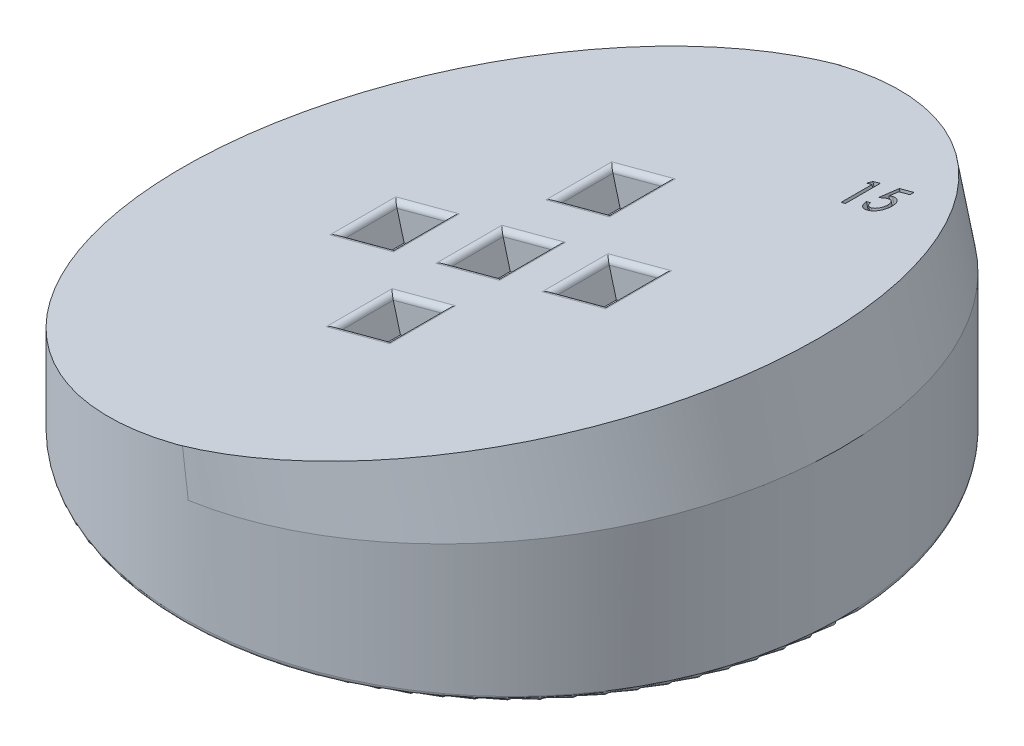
ISO-10303-21;
HEADER;
FILE_DESCRIPTION(('STEP AP214'),'2;1');
FILE_NAME('part.step','',(''),(''),'','','');
FILE_SCHEMA(('AUTOMOTIVE_DESIGN { 1 0 10303 214 1 1 1 1 }'));
ENDSEC;
DATA;
#1=APPLICATION_CONTEXT('core data for automotive mechanical design processes');
#2=APPLICATION_PROTOCOL_DEFINITION('international standard','automotive_design',2000,#1);
#3=PRODUCT_CONTEXT('',#1,'mechanical');
#4=PRODUCT('Part','Part','',(#3));
#5=PRODUCT_RELATED_PRODUCT_CATEGORY('part','',(#4));
#6=PRODUCT_DEFINITION_FORMATION('','',#4);
#7=PRODUCT_DEFINITION_CONTEXT('part definition',#1,'design');
#8=PRODUCT_DEFINITION('design','',#6,#7);
#9=PRODUCT_DEFINITION_SHAPE('','',#8);
#10=(LENGTH_UNIT() NAMED_UNIT(*) SI_UNIT(.MILLI.,.METRE.));
#11=(NAMED_UNIT(*) PLANE_ANGLE_UNIT() SI_UNIT($,.RADIAN.));
#12=(NAMED_UNIT(*) SI_UNIT($,.STERADIAN.) SOLID_ANGLE_UNIT());
#13=UNCERTAINTY_MEASURE_WITH_UNIT(LENGTH_MEASURE(1.E-05),#10,'distance_accuracy_value','');
#14=(GEOMETRIC_REPRESENTATION_CONTEXT(3) GLOBAL_UNCERTAINTY_ASSIGNED_CONTEXT((#13)) GLOBAL_UNIT_ASSIGNED_CONTEXT((#10,
#11,#12)) REPRESENTATION_CONTEXT('',''));
#15=CARTESIAN_POINT('',(0.,0.,0.));
#16=DIRECTION('',(0.,0.,1.));
#17=DIRECTION('',(1.,0.,0.));
#18=AXIS2_PLACEMENT_3D('',#15,#16,#17);
#19=CARTESIAN_POINT('',(-30.,6.,-41.5));
#20=DIRECTION('',(0.258819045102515,-0.96592582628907,0.));
#21=DIRECTION('',(0.96592582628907,0.258819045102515,0.));
#22=AXIS2_PLACEMENT_3D('',#19,#20,#21);
#23=PLANE('',#22);
#24=DIRECTION('',(0.471330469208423,0.126292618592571,-0.872867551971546));
#25=VECTOR('',#24,1.);
#26=CARTESIAN_POINT('',(14.2335361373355,17.8523402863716,-18.0621991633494));
#27=LINE('',#26,#25);
#28=CARTESIAN_POINT('',(14.2335361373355,17.8523402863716,-18.0621991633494));
#29=VERTEX_POINT('',#28);
#30=CARTESIAN_POINT('',(14.4313555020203,17.9053458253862,-18.4285453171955));
#31=VERTEX_POINT('',#30);
#32=EDGE_CURVE('E58',#29,#31,#27,.T.);
#33=ORIENTED_EDGE('',*,*,#32,.T.);
#34=DIRECTION('',(0.965925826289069,0.258819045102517,0.));
#35=VECTOR('',#34,1.);
#36=CARTESIAN_POINT('',(14.4313555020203,17.9053458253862,-18.4285453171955));
#37=LINE('',#36,#35);
#38=CARTESIAN_POINT('',(15.0985350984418,18.0841160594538,-18.4285453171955));
#39=VERTEX_POINT('',#38);
#40=EDGE_CURVE('E574',#31,#39,#37,.T.);
#41=ORIENTED_EDGE('',*,*,#40,.T.);
#42=DIRECTION('',(0.,0.,1.));
#43=VECTOR('',#42,1.);
#44=CARTESIAN_POINT('',(15.0985350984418,18.0841160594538,-18.4285453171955));
#45=LINE('',#44,#43);
#46=CARTESIAN_POINT('',(15.0985350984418,18.0841160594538,-15.2535453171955));
#47=VERTEX_POINT('',#46);
#48=EDGE_CURVE('E597',#39,#47,#45,.T.);
#49=ORIENTED_EDGE('',*,*,#48,.T.);
#50=DIRECTION('',(-0.965925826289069,-0.258819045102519,0.));
#51=VECTOR('',#50,1.);
#52=CARTESIAN_POINT('',(15.0985350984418,18.0841160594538,-15.2535453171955));
#53=LINE('',#52,#51);
#54=CARTESIAN_POINT('',(14.7053537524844,17.9787634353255,-15.2535453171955));
#55=VERTEX_POINT('',#54);
#56=EDGE_CURVE('E600',#47,#55,#53,.T.);
#57=ORIENTED_EDGE('',*,*,#56,.T.);
#58=DIRECTION('',(0.,0.,-1.));
#59=VECTOR('',#58,1.);
#60=CARTESIAN_POINT('',(14.7053537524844,17.9787634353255,-15.2535453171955));
#61=LINE('',#60,#59);
#62=CARTESIAN_POINT('',(14.7053537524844,17.9787634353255,-18.0621991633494));
#63=VERTEX_POINT('',#62);
#64=EDGE_CURVE('E603',#55,#63,#61,.T.);
#65=ORIENTED_EDGE('',*,*,#64,.T.);
#66=DIRECTION('',(-0.965925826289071,-0.258819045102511,0.));
#67=VECTOR('',#66,1.);
#68=CARTESIAN_POINT('',(14.7053537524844,17.9787634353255,-18.0621991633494));
#69=LINE('',#68,#67);
#70=EDGE_CURVE('E584',#63,#29,#69,.T.);
#71=ORIENTED_EDGE('',*,*,#70,.T.);
#72=EDGE_LOOP('',(#33,#41,#49,#57,#65,#71));
#73=FACE_BOUND('',#72,.T.);
#74=DIRECTION('',(-0.96592582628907,-0.258819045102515,0.));
#75=VECTOR('',#74,1.);
#76=CARTESIAN_POINT('',(-30.,6.,-3.));
#77=LINE('',#76,#75);
#78=CARTESIAN_POINT('',(-3.9200026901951,12.9881142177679,-3.));
#79=VERTEX_POINT('',#78);
#80=CARTESIAN_POINT('',(1.87555226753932,14.541028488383,-3.));
#81=VERTEX_POINT('',#80);
#82=EDGE_CURVE('E1138',#79,#81,#77,.F.);
#83=ORIENTED_EDGE('',*,*,#82,.T.);
#84=DIRECTION('',(0.,0.,-1.));
#85=VECTOR('',#84,1.);
#86=CARTESIAN_POINT('',(1.87555226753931,14.541028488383,-41.5));
#87=LINE('',#86,#85);
#88=CARTESIAN_POINT('',(1.87555226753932,14.541028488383,3.));
#89=VERTEX_POINT('',#88);
#90=EDGE_CURVE('E1140',#81,#89,#87,.F.);
#91=ORIENTED_EDGE('',*,*,#90,.T.);
#92=DIRECTION('',(0.96592582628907,0.258819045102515,0.));
#93=VECTOR('',#92,1.);
#94=CARTESIAN_POINT('',(-30.,6.,3.));
#95=LINE('',#94,#93);
#96=CARTESIAN_POINT('',(-3.9200026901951,12.9881142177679,3.));
#97=VERTEX_POINT('',#96);
#98=EDGE_CURVE('E1134',#89,#97,#95,.F.);
#99=ORIENTED_EDGE('',*,*,#98,.T.);
#100=DIRECTION('',(0.,0.,1.));
#101=VECTOR('',#100,1.);
#102=CARTESIAN_POINT('',(-3.92000269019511,12.9881142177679,-41.5));
#103=LINE('',#102,#101);
#104=EDGE_CURVE('E1136',#97,#79,#103,.F.);
#105=ORIENTED_EDGE('',*,*,#104,.T.);
#106=EDGE_LOOP('',(#83,#91,#99,#105));
#107=FACE_BOUND('',#106,.T.);
#108=DIRECTION('',(-0.96592582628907,-0.258819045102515,0.));
#109=VECTOR('',#108,1.);
#110=CARTESIAN_POINT('',(-30.,6.,7.00000000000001));
#111=LINE('',#110,#109);
#112=CARTESIAN_POINT('',(-3.9200026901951,12.9881142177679,7.));
#113=VERTEX_POINT('',#112);
#114=CARTESIAN_POINT('',(1.87555226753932,14.541028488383,7.));
#115=VERTEX_POINT('',#114);
#116=EDGE_CURVE('E1111',#113,#115,#111,.F.);
#117=ORIENTED_EDGE('',*,*,#116,.T.);
#118=DIRECTION('',(0.,0.,-1.));
#119=VECTOR('',#118,1.);
#120=CARTESIAN_POINT('',(1.87555226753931,14.541028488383,-41.5));
#121=LINE('',#120,#119);
#122=CARTESIAN_POINT('',(1.87555226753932,14.541028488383,13.));
#123=VERTEX_POINT('',#122);
#124=EDGE_CURVE('E1113',#115,#123,#121,.F.);
#125=ORIENTED_EDGE('',*,*,#124,.T.);
#126=DIRECTION('',(0.96592582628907,0.258819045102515,0.));
#127=VECTOR('',#126,1.);
#128=CARTESIAN_POINT('',(-30.,6.,13.));
#129=LINE('',#128,#127);
#130=CARTESIAN_POINT('',(-3.9200026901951,12.9881142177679,13.));
#131=VERTEX_POINT('',#130);
#132=EDGE_CURVE('E1107',#123,#131,#129,.F.);
#133=ORIENTED_EDGE('',*,*,#132,.T.);
#134=DIRECTION('',(0.,0.,1.));
#135=VECTOR('',#134,1.);
#136=CARTESIAN_POINT('',(-3.92000269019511,12.9881142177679,-41.5));
#137=LINE('',#136,#135);
#138=EDGE_CURVE('E1109',#131,#113,#137,.F.);
#139=ORIENTED_EDGE('',*,*,#138,.T.);
#140=EDGE_LOOP('',(#117,#125,#133,#139));
#141=FACE_BOUND('',#140,.T.);
#142=DIRECTION('',(-0.96592582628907,-0.258819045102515,0.));
#143=VECTOR('',#142,1.);
#144=CARTESIAN_POINT('',(-30.,6.,-3.));
#145=LINE('',#144,#143);
#146=CARTESIAN_POINT('',(-13.5792609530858,10.3999237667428,-3.));
#147=VERTEX_POINT('',#146);
#148=CARTESIAN_POINT('',(-7.78370599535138,11.9528380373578,-3.));
#149=VERTEX_POINT('',#148);
#150=EDGE_CURVE('E1083',#147,#149,#145,.F.);
#151=ORIENTED_EDGE('',*,*,#150,.T.);
#152=DIRECTION('',(0.,0.,-1.));
#153=VECTOR('',#152,1.);
#154=CARTESIAN_POINT('',(-7.78370599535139,11.9528380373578,-41.5));
#155=LINE('',#154,#153);
#156=CARTESIAN_POINT('',(-7.78370599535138,11.9528380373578,3.));
#157=VERTEX_POINT('',#156);
#158=EDGE_CURVE('E1085',#149,#157,#155,.F.);
#159=ORIENTED_EDGE('',*,*,#158,.T.);
#160=DIRECTION('',(0.96592582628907,0.258819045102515,0.));
#161=VECTOR('',#160,1.);
#162=CARTESIAN_POINT('',(-30.,6.,3.));
#163=LINE('',#162,#161);
#164=CARTESIAN_POINT('',(-13.5792609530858,10.3999237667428,3.));
#165=VERTEX_POINT('',#164);
#166=EDGE_CURVE('E1079',#157,#165,#163,.F.);
#167=ORIENTED_EDGE('',*,*,#166,.T.);
#168=DIRECTION('',(0.,0.,1.));
#169=VECTOR('',#168,1.);
#170=CARTESIAN_POINT('',(-13.5792609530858,10.3999237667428,-41.5));
#171=LINE('',#170,#169);
#172=EDGE_CURVE('E1081',#165,#147,#171,.F.);
#173=ORIENTED_EDGE('',*,*,#172,.T.);
#174=EDGE_LOOP('',(#151,#159,#167,#173));
#175=FACE_BOUND('',#174,.T.);
#176=DIRECTION('',(-0.96592582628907,-0.258819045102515,0.));
#177=VECTOR('',#176,1.);
#178=CARTESIAN_POINT('',(-30.,6.,-3.));
#179=LINE('',#178,#177);
#180=CARTESIAN_POINT('',(5.73925557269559,15.576304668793,-3.));
#181=VERTEX_POINT('',#180);
#182=CARTESIAN_POINT('',(11.53481053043,17.1292189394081,-3.));
#183=VERTEX_POINT('',#182);
#184=EDGE_CURVE('E1055',#181,#183,#179,.F.);
#185=ORIENTED_EDGE('',*,*,#184,.T.);
#186=DIRECTION('',(0.,0.,-1.));
#187=VECTOR('',#186,1.);
#188=CARTESIAN_POINT('',(11.53481053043,17.1292189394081,-41.5));
#189=LINE('',#188,#187);
#190=CARTESIAN_POINT('',(11.53481053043,17.1292189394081,3.));
#191=VERTEX_POINT('',#190);
#192=EDGE_CURVE('E1057',#183,#191,#189,.F.);
#193=ORIENTED_EDGE('',*,*,#192,.T.);
#194=DIRECTION('',(0.96592582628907,0.258819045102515,0.));
#195=VECTOR('',#194,1.);
#196=CARTESIAN_POINT('',(-30.,6.,3.));
#197=LINE('',#196,#195);
#198=CARTESIAN_POINT('',(5.73925557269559,15.576304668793,3.));
#199=VERTEX_POINT('',#198);
#200=EDGE_CURVE('E1051',#191,#199,#197,.F.);
#201=ORIENTED_EDGE('',*,*,#200,.T.);
#202=DIRECTION('',(0.,0.,1.));
#203=VECTOR('',#202,1.);
#204=CARTESIAN_POINT('',(5.7392555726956,15.576304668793,-41.5));
#205=LINE('',#204,#203);
#206=EDGE_CURVE('E1053',#199,#181,#205,.F.);
#207=ORIENTED_EDGE('',*,*,#206,.T.);
#208=EDGE_LOOP('',(#185,#193,#201,#207));
#209=FACE_BOUND('',#208,.T.);
#210=DIRECTION('',(-0.96592582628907,-0.258819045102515,0.));
#211=VECTOR('',#210,1.);
#212=CARTESIAN_POINT('',(-30.,6.,-13.));
#213=LINE('',#212,#211);
#214=CARTESIAN_POINT('',(-3.92000269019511,12.9881142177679,-13.));
#215=VERTEX_POINT('',#214);
#216=CARTESIAN_POINT('',(1.87555226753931,14.541028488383,-13.));
#217=VERTEX_POINT('',#216);
#218=EDGE_CURVE('E1026',#215,#217,#213,.F.);
#219=ORIENTED_EDGE('',*,*,#218,.T.);
#220=DIRECTION('',(0.,0.,-1.));
#221=VECTOR('',#220,1.);
#222=CARTESIAN_POINT('',(1.87555226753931,14.541028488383,-41.5));
#223=LINE('',#222,#221);
#224=CARTESIAN_POINT('',(1.87555226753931,14.541028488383,-7.));
#225=VERTEX_POINT('',#224);
#226=EDGE_CURVE('E1028',#217,#225,#223,.F.);
#227=ORIENTED_EDGE('',*,*,#226,.T.);
#228=DIRECTION('',(0.96592582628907,0.258819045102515,0.));
#229=VECTOR('',#228,1.);
#230=CARTESIAN_POINT('',(-30.,6.,-6.99999999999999));
#231=LINE('',#230,#229);
#232=CARTESIAN_POINT('',(-3.92000269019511,12.9881142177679,-7.));
#233=VERTEX_POINT('',#232);
#234=EDGE_CURVE('E1022',#225,#233,#231,.F.);
#235=ORIENTED_EDGE('',*,*,#234,.T.);
#236=DIRECTION('',(0.,0.,1.));
#237=VECTOR('',#236,1.);
#238=CARTESIAN_POINT('',(-3.92000269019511,12.9881142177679,-41.5));
#239=LINE('',#238,#237);
#240=EDGE_CURVE('E1024',#233,#215,#239,.F.);
#241=ORIENTED_EDGE('',*,*,#240,.T.);
#242=EDGE_LOOP('',(#219,#227,#235,#241));
#243=FACE_BOUND('',#242,.T.);
#244=CARTESIAN_POINT('',(-1.0222252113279,13.7645713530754,0.));
#245=DIRECTION('',(-0.258819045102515,0.96592582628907,0.));
#246=DIRECTION('',(-0.96592582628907,-0.258819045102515,0.));
#247=AXIS2_PLACEMENT_3D('',#244,#245,#246);
#248=CIRCLE('',#247,30.);
#249=CARTESIAN_POINT('',(-0.519971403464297,13.899149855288,29.9954934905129));
#250=VERTEX_POINT('',#249);
#251=CARTESIAN_POINT('',(-0.51997140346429,13.899149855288,-29.9954934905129));
#252=VERTEX_POINT('',#251);
#253=EDGE_CURVE('E622',#250,#252,#248,.T.);
#254=ORIENTED_EDGE('',*,*,#253,.T.);
#255=CARTESIAN_POINT('',(0.,14.0384757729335,0.));
#256=DIRECTION('',(0.258819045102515,-0.96592582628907,0.));
#257=DIRECTION('',(-0.96592582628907,-0.258819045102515,0.));
#258=AXIS2_PLACEMENT_3D('',#255,#256,#257);
#259=ELLIPSE('',#258,31.0582854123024,30.);
#260=EDGE_CURVE('E1019',#250,#252,#259,.T.);
#261=ORIENTED_EDGE('',*,*,#260,.F.);
#262=EDGE_LOOP('',(#254,#261));
#263=FACE_BOUND('',#262,.T.);
#264=DIRECTION('',(0.96592582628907,0.258819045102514,0.));
#265=VECTOR('',#264,1.);
#266=CARTESIAN_POINT('',(16.8359051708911,18.5496429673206,-18.4285453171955));
#267=LINE('',#266,#265);
#268=CARTESIAN_POINT('',(16.8359051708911,18.5496429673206,-18.4285453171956));
#269=VERTEX_POINT('',#268);
#270=CARTESIAN_POINT('',(18.1653495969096,18.9058665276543,-18.4285453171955));
#271=VERTEX_POINT('',#270);
#272=EDGE_CURVE('E50',#269,#271,#267,.T.);
#273=ORIENTED_EDGE('',*,*,#272,.T.);
#274=DIRECTION('',(0.,0.,1.));
#275=VECTOR('',#274,1.);
#276=CARTESIAN_POINT('',(18.1653495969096,18.9058665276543,-18.4285453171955));
#277=LINE('',#276,#275);
#278=CARTESIAN_POINT('',(18.1653495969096,18.9058665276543,-18.0621991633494));
#279=VERTEX_POINT('',#278);
#280=EDGE_CURVE('E571',#271,#279,#277,.T.);
#281=ORIENTED_EDGE('',*,*,#280,.T.);
#282=DIRECTION('',(-0.96592582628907,-0.258819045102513,0.));
#283=VECTOR('',#282,1.);
#284=CARTESIAN_POINT('',(18.1653495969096,18.9058665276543,-18.0621991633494));
#285=LINE('',#284,#283);
#286=CARTESIAN_POINT('',(17.1578223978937,18.6359004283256,-18.0621991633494));
#287=VERTEX_POINT('',#286);
#288=EDGE_CURVE('E1844',#279,#287,#285,.T.);
#289=ORIENTED_EDGE('',*,*,#288,.T.);
#290=DIRECTION('',(-0.213415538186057,-0.0571845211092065,0.97528649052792));
#291=VECTOR('',#290,1.);
#292=CARTESIAN_POINT('',(17.1578223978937,18.6359004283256,-18.0621991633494));
#293=LINE('',#292,#291);
#294=CARTESIAN_POINT('',(16.993177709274,18.5917840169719,-17.3097903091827));
#295=VERTEX_POINT('',#294);
#296=EDGE_CURVE('E1847',#287,#295,#293,.T.);
#297=ORIENTED_EDGE('',*,*,#296,.T.);
#298=CARTESIAN_POINT('',(16.993177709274,18.5917840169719,-17.3097903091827));
#299=CARTESIAN_POINT('',(17.012385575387,18.5969307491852,-17.3193737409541));
#300=CARTESIAN_POINT('',(17.0519155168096,18.6075227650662,-17.3390965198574));
#301=CARTESIAN_POINT('',(17.1180035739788,18.6252310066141,-17.3562810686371));
#302=CARTESIAN_POINT('',(17.1897563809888,18.644457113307,-17.3683720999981));
#303=CARTESIAN_POINT('',(17.2398838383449,18.6578887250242,-17.3695825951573));
#304=CARTESIAN_POINT('',(17.265947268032,18.6648723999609,-17.3702119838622));
#305=B_SPLINE_CURVE_WITH_KNOTS('',3,(#298,#299,#300,#301,#302,#303,#304),.UNSPECIFIED.,.F.,.F.,
(4,1,1,1,4),(0.,0.226644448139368,0.466436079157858,0.722577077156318,1.),.UNSPECIFIED.);
#306=CARTESIAN_POINT('',(17.265947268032,18.6648723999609,-17.3702119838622));
#307=VERTEX_POINT('',#306);
#308=EDGE_CURVE('E1850',#295,#307,#305,.T.);
#309=ORIENTED_EDGE('',*,*,#308,.T.);
#310=CARTESIAN_POINT('',(17.265947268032,18.6648723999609,-17.3702119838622));
#311=CARTESIAN_POINT('',(17.3028610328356,18.6747634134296,-17.3695122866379));
#312=CARTESIAN_POINT('',(17.3753350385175,18.6941827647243,-17.3681385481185));
#313=CARTESIAN_POINT('',(17.4809600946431,18.7224849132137,-17.352787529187));
#314=CARTESIAN_POINT('',(17.5816107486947,18.7494541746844,-17.3297896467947));
#315=CARTESIAN_POINT('',(17.6764590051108,18.7748686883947,-17.2954810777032));
#316=CARTESIAN_POINT('',(17.7665880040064,18.7990186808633,-17.2532456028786));
#317=CARTESIAN_POINT('',(17.8510199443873,18.8216421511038,-17.2003940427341));
#318=CARTESIAN_POINT('',(17.929667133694,18.8427156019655,-17.1378229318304));
#319=CARTESIAN_POINT('',(18.0024243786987,18.862210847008,-17.0665976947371));
#320=CARTESIAN_POINT('',(18.0687362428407,18.8799790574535,-16.9890163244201));
#321=CARTESIAN_POINT('',(18.1256891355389,18.8952395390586,-16.9052359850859));
#322=CARTESIAN_POINT('',(18.1750575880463,18.9084677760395,-16.817704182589));
#323=CARTESIAN_POINT('',(18.2141896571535,18.918953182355,-16.724908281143));
#324=CARTESIAN_POINT('',(18.2451080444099,18.9272377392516,-16.6278081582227));
#325=CARTESIAN_POINT('',(18.2670964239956,18.9331295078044,-16.5259979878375));
#326=CARTESIAN_POINT('',(18.2810750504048,18.9368750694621,-16.419782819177));
#327=CARTESIAN_POINT('',(18.2825542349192,18.9372714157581,-16.3473308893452));
#328=CARTESIAN_POINT('',(18.2833040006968,18.9374723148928,-16.3106066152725));
#329=B_SPLINE_CURVE_WITH_KNOTS('',3,(#310,#311,#312,#313,#314,#315,#316,#317,#318,#319,#320,
#321,#322,#323,#324,#325,#326,#327,#328),.UNSPECIFIED.,.F.,.F.,(4,1,1,1,1,1,1,1,1,1,1,1,1,1,1,1,
4),(0.,0.0684308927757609,0.134352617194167,0.197478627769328,0.259348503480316,
0.320372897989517,0.380701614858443,0.441942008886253,0.504021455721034,0.566203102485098,
0.627233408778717,0.687310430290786,0.747520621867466,0.808306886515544,0.870237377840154,
0.934226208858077,1.),.UNSPECIFIED.);
#330=CARTESIAN_POINT('',(18.2833040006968,18.9374723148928,-16.3106066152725));
#331=VERTEX_POINT('',#330);
#332=EDGE_CURVE('E1855',#307,#331,#329,.T.);
#333=ORIENTED_EDGE('',*,*,#332,.T.);
#334=CARTESIAN_POINT('',(18.2833040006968,18.9374723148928,-16.3106066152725));
#335=CARTESIAN_POINT('',(18.2827274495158,18.9373178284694,-16.2849445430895));
#336=CARTESIAN_POINT('',(18.2815869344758,18.9370122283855,-16.2341806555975));
#337=CARTESIAN_POINT('',(18.2756438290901,18.9354197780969,-16.1586980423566));
#338=CARTESIAN_POINT('',(18.2642995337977,18.9323800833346,-16.0848436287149));
#339=CARTESIAN_POINT('',(18.2492373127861,18.9283441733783,-16.012046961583));
#340=CARTESIAN_POINT('',(18.2284827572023,18.9227830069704,-15.9409321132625));
#341=CARTESIAN_POINT('',(18.2048563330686,18.9164523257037,-15.8705536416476));
#342=CARTESIAN_POINT('',(18.175829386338,18.9086745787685,-15.8020335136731));
#343=CARTESIAN_POINT('',(18.1426904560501,18.8997950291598,-15.7354002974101));
#344=CARTESIAN_POINT('',(18.1059230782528,18.8899432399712,-15.6711416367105));
#345=CARTESIAN_POINT('',(18.0654404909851,18.8790959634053,-15.6100370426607));
#346=CARTESIAN_POINT('',(18.0211502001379,18.8672284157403,-15.5525750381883));
#347=CARTESIAN_POINT('',(17.972895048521,18.8542984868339,-15.4992365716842));
#348=CARTESIAN_POINT('',(17.9219940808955,18.8406596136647,-15.4486498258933));
#349=CARTESIAN_POINT('',(17.86711950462,18.8259560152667,-15.4021350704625));
#350=CARTESIAN_POINT('',(17.8084272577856,18.8102294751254,-15.3594969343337));
#351=CARTESIAN_POINT('',(17.7467545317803,18.7937043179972,-15.3202693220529));
#352=CARTESIAN_POINT('',(17.682130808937,18.7763884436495,-15.2848301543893));
#353=CARTESIAN_POINT('',(17.6141762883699,18.7581800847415,-15.255487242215));
#354=CARTESIAN_POINT('',(17.5445779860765,18.7395312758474,-15.228826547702));
#355=CARTESIAN_POINT('',(17.4716145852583,18.7199807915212,-15.2088638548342));
#356=CARTESIAN_POINT('',(17.3966618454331,18.6998972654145,-15.1920660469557));
#357=CARTESIAN_POINT('',(17.3188202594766,18.6790396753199,-15.1809184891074));
#358=CARTESIAN_POINT('',(17.2386354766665,18.6575542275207,-15.1736505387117));
#359=CARTESIAN_POINT('',(17.184254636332,18.6429829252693,-15.1726460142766));
#360=CARTESIAN_POINT('',(17.1565937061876,18.6355712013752,-15.1721350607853));
#361=B_SPLINE_CURVE_WITH_KNOTS('',3,(#334,#335,#336,#337,#338,#339,#340,#341,#342,#343,#344,
#345,#346,#347,#348,#349,#350,#351,#352,#353,#354,#355,#356,#357,#358,#359,#360),.UNSPECIFIED.,
.F.,.F.,(4,1,1,1,1,1,1,1,1,1,1,1,1,1,1,1,1,1,1,1,1,1,1,1,4),(0.,0.0421781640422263,
0.0834354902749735,0.1243323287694,0.164992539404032,0.205670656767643,0.246330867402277,
0.28736547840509,0.328500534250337,0.369428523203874,0.410015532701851,0.450169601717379,
0.490105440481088,0.530026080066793,0.570128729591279,0.610628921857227,0.651917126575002,
0.693212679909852,0.734887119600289,0.777094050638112,0.819352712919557,0.86315152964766,
0.907494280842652,0.952946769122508,1.),.UNSPECIFIED.);
#362=CARTESIAN_POINT('',(17.1565937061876,18.6355712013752,-15.1721350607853));
#363=VERTEX_POINT('',#362);
#364=EDGE_CURVE('E1863',#331,#363,#361,.T.);
#365=ORIENTED_EDGE('',*,*,#364,.T.);
#366=CARTESIAN_POINT('',(17.1565937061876,18.6355712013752,-15.1721350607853));
#367=CARTESIAN_POINT('',(17.1254393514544,18.6272234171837,-15.1729093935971));
#368=CARTESIAN_POINT('',(17.0639782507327,18.6107549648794,-15.1744369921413));
#369=CARTESIAN_POINT('',(16.9737100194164,18.586567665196,-15.1852718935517));
#370=CARTESIAN_POINT('',(16.8871124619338,18.5633639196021,-15.2036555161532));
#371=CARTESIAN_POINT('',(16.8045525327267,18.5412420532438,-15.2299714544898));
#372=CARTESIAN_POINT('',(16.725415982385,18.520037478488,-15.2629789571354));
#373=CARTESIAN_POINT('',(16.6503774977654,18.4999309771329,-15.3038111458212));
#374=CARTESIAN_POINT('',(16.5791454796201,18.4808444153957,-15.352101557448));
#375=CARTESIAN_POINT('',(16.5116281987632,18.4627532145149,-15.4069295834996));
#376=CARTESIAN_POINT('',(16.4500497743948,18.4462533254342,-15.469473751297));
#377=CARTESIAN_POINT('',(16.3932880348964,18.4310440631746,-15.5368045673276));
#378=CARTESIAN_POINT('',(16.3449265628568,18.4180856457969,-15.6114009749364));
#379=CARTESIAN_POINT('',(16.3023831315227,18.4066861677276,-15.6912043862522));
#380=CARTESIAN_POINT('',(16.2658289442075,18.3968915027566,-15.7768638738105));
#381=CARTESIAN_POINT('',(16.236748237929,18.3890993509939,-15.8685418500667));
#382=CARTESIAN_POINT('',(16.2134947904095,18.3828686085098,-15.9658911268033));
#383=CARTESIAN_POINT('',(16.2042006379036,18.3803782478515,-16.0331945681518));
#384=CARTESIAN_POINT('',(16.1994428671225,18.379103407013,-16.0676478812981));
#385=B_SPLINE_CURVE_WITH_KNOTS('',3,(#366,#367,#368,#369,#370,#371,#372,#373,#374,#375,#376,
#377,#378,#379,#380,#381,#382,#383,#384),.UNSPECIFIED.,.F.,.F.,(4,1,1,1,1,1,1,1,1,1,1,1,1,1,1,1,
4),(0.,0.0655981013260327,0.129411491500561,0.191065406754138,0.251494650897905,
0.311073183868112,0.370482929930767,0.429688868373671,0.490167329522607,0.550854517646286,
0.611098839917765,0.671620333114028,0.733191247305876,0.79632936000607,0.861785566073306,
0.929246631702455,1.),.UNSPECIFIED.);
#386=CARTESIAN_POINT('',(16.1994428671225,18.379103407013,-16.0676478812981));
#387=VERTEX_POINT('',#386);
#388=EDGE_CURVE('E1871',#363,#387,#385,.T.);
#389=ORIENTED_EDGE('',*,*,#388,.T.);
#390=DIRECTION('',(0.965925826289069,0.258819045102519,0.));
#391=VECTOR('',#390,1.);
#392=CARTESIAN_POINT('',(16.1994428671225,18.379103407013,-16.0676478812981));
#393=LINE('',#392,#391);
#394=CARTESIAN_POINT('',(16.583409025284,18.4819868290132,-16.0676478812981));
#395=VERTEX_POINT('',#394);
#396=EDGE_CURVE('E1879',#387,#395,#393,.T.);
#397=ORIENTED_EDGE('',*,*,#396,.T.);
#398=CARTESIAN_POINT('',(16.583409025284,18.4819868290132,-16.0676478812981));
#399=CARTESIAN_POINT('',(16.5907167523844,18.4839449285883,-16.0343742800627));
#400=CARTESIAN_POINT('',(16.6044350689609,18.4876207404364,-15.9719119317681));
#401=CARTESIAN_POINT('',(16.6339059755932,18.4955174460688,-15.8868027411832));
#402=CARTESIAN_POINT('',(16.6654923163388,18.5039809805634,-15.8144166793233));
#403=CARTESIAN_POINT('',(16.7041252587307,18.5143326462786,-15.7552174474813));
#404=CARTESIAN_POINT('',(16.7484660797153,18.5262137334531,-15.7066240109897));
#405=CARTESIAN_POINT('',(16.797681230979,18.5394008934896,-15.6644435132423));
#406=CARTESIAN_POINT('',(16.8517501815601,18.5538886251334,-15.6266066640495));
#407=CARTESIAN_POINT('',(16.9112745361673,18.5698381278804,-15.5951988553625));
#408=CARTESIAN_POINT('',(16.973990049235,18.5866426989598,-15.5697534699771));
#409=CARTESIAN_POINT('',(17.0391535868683,18.6041032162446,-15.5519942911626));
#410=CARTESIAN_POINT('',(17.1054491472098,18.6218670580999,-15.5408274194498));
#411=CARTESIAN_POINT('',(17.1502054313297,18.633859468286,-15.5392628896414));
#412=CARTESIAN_POINT('',(17.1725666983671,18.6398511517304,-15.5384812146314));
#413=B_SPLINE_CURVE_WITH_KNOTS('',3,(#398,#399,#400,#401,#402,#403,#404,#405,#406,#407,#408,
#409,#410,#411,#412),.UNSPECIFIED.,.F.,.F.,(4,1,1,1,1,1,1,1,1,1,1,1,4),(0.,0.115454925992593,
0.216735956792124,0.305701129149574,0.383765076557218,0.457425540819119,0.53133752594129,
0.607408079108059,0.685762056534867,0.765096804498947,0.843121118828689,0.921619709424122,1.),.UNSPECIFIED.);
#414=CARTESIAN_POINT('',(17.1725666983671,18.6398511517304,-15.5384812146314));
#415=VERTEX_POINT('',#414);
#416=EDGE_CURVE('E1885',#395,#415,#413,.T.);
#417=ORIENTED_EDGE('',*,*,#416,.T.);
#418=CARTESIAN_POINT('',(17.1725666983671,18.6398511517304,-15.5384812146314));
#419=CARTESIAN_POINT('',(17.1967565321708,18.6463327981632,-15.5393219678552));
#420=CARTESIAN_POINT('',(17.2445148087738,18.6591295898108,-15.540981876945));
#421=CARTESIAN_POINT('',(17.3148704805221,18.6779813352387,-15.5509189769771));
#422=CARTESIAN_POINT('',(17.3821566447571,18.6960106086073,-15.5692999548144));
#423=CARTESIAN_POINT('',(17.4473447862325,18.7134777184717,-15.5931250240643));
#424=CARTESIAN_POINT('',(17.5092962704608,18.7300775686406,-15.6255757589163));
#425=CARTESIAN_POINT('',(17.5695317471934,18.7462176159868,-15.6634661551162));
#426=CARTESIAN_POINT('',(17.6258547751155,18.7613093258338,-15.7099944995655));
#427=CARTESIAN_POINT('',(17.6798395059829,18.7757744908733,-15.7617285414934));
#428=CARTESIAN_POINT('',(17.7292840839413,18.7890231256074,-15.819032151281));
#429=CARTESIAN_POINT('',(17.7723380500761,18.8005594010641,-15.8809461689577));
#430=CARTESIAN_POINT('',(17.8090649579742,18.8104003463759,-15.9462273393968));
#431=CARTESIAN_POINT('',(17.8383331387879,18.8182427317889,-16.0153098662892));
#432=CARTESIAN_POINT('',(17.8620867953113,18.8246075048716,-16.0875607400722));
#433=CARTESIAN_POINT('',(17.8784140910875,18.8289823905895,-16.163473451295));
#434=CARTESIAN_POINT('',(17.8886006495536,18.8317118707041,-16.2428894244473));
#435=CARTESIAN_POINT('',(17.8896086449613,18.8319819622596,-16.2970041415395));
#436=CARTESIAN_POINT('',(17.8901226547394,18.8321196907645,-16.324599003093));
#437=B_SPLINE_CURVE_WITH_KNOTS('',3,(#418,#419,#420,#421,#422,#423,#424,#425,#426,#427,#428,
#429,#430,#431,#432,#433,#434,#435,#436),.UNSPECIFIED.,.F.,.F.,(4,1,1,1,1,1,1,1,1,1,1,1,1,1,1,1,
4),(0.,0.0623438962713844,0.12308629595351,0.18246816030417,0.24138874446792,0.300854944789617,
0.361037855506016,0.422681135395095,0.486149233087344,0.550432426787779,0.613550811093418,
0.675727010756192,0.738088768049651,0.800995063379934,0.865382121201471,0.931353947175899,1.),.UNSPECIFIED.);
#438=CARTESIAN_POINT('',(17.8901226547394,18.8321196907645,-16.324599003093));
#439=VERTEX_POINT('',#438);
#440=EDGE_CURVE('E1890',#415,#439,#437,.T.);
#441=ORIENTED_EDGE('',*,*,#440,.T.);
#442=CARTESIAN_POINT('',(17.8901226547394,18.8321196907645,-16.324599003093));
#443=CARTESIAN_POINT('',(17.8895114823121,18.8319559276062,-16.349219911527));
#444=CARTESIAN_POINT('',(17.8883113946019,18.8316343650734,-16.3975651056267));
#445=CARTESIAN_POINT('',(17.8795205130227,18.8292788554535,-16.4682232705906));
#446=CARTESIAN_POINT('',(17.8655764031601,18.8255425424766,-16.5356224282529));
#447=CARTESIAN_POINT('',(17.8453144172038,18.8201133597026,-16.5991289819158));
#448=CARTESIAN_POINT('',(17.8192683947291,18.8131343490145,-16.659094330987));
#449=CARTESIAN_POINT('',(17.7872398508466,18.8045523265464,-16.7151348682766));
#450=CARTESIAN_POINT('',(17.7493263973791,18.7943934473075,-16.7675626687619));
#451=CARTESIAN_POINT('',(17.7066889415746,18.7829687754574,-16.8165476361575));
#452=CARTESIAN_POINT('',(17.6584224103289,18.7700357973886,-16.8603160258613));
#453=CARTESIAN_POINT('',(17.606598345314,18.7561495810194,-16.8994879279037));
#454=CARTESIAN_POINT('',(17.5496431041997,18.7408884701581,-16.9311691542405));
#455=CARTESIAN_POINT('',(17.489610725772,18.7248028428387,-16.9582800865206));
#456=CARTESIAN_POINT('',(17.4251125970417,18.7075206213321,-16.9780937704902));
#457=CARTESIAN_POINT('',(17.3573041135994,18.6893513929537,-16.9940591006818));
#458=CARTESIAN_POINT('',(17.2849498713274,18.669964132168,-17.0017295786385));
#459=CARTESIAN_POINT('',(17.2354465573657,18.6566997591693,-17.0031413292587));
#460=CARTESIAN_POINT('',(17.2100417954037,18.6498925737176,-17.0038658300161));
#461=B_SPLINE_CURVE_WITH_KNOTS('',3,(#442,#443,#444,#445,#446,#447,#448,#449,#450,#451,#452,
#453,#454,#455,#456,#457,#458,#459,#460),.UNSPECIFIED.,.F.,.F.,(4,1,1,1,1,1,1,1,1,1,1,1,1,1,1,1,
4),(0.,0.0669695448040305,0.131500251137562,0.193498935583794,0.254237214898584,
0.313095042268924,0.37205170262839,0.430999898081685,0.491021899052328,0.551088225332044,
0.611433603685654,0.671322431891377,0.732820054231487,0.795581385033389,0.860520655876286,
0.928420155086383,1.),.UNSPECIFIED.);
#462=CARTESIAN_POINT('',(17.2100417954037,18.6498925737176,-17.0038658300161));
#463=VERTEX_POINT('',#462);
#464=EDGE_CURVE('E1898',#439,#463,#461,.T.);
#465=ORIENTED_EDGE('',*,*,#464,.T.);
#466=CARTESIAN_POINT('',(17.2100417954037,18.6498925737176,-17.0038658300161));
#467=CARTESIAN_POINT('',(17.18831723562,18.6440714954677,-17.0033260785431));
#468=CARTESIAN_POINT('',(17.1427087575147,18.6318507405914,-17.0021929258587));
#469=CARTESIAN_POINT('',(17.0713396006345,18.6127274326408,-16.9939993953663));
#470=CARTESIAN_POINT('',(16.9936758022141,18.5919174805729,-16.9811121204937));
#471=CARTESIAN_POINT('',(16.9098401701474,18.5694537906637,-16.9632883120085));
#472=CARTESIAN_POINT('',(16.8197521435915,18.5453147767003,-16.9400674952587));
#473=CARTESIAN_POINT('',(16.7233022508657,18.5194711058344,-16.9119295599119));
#474=CARTESIAN_POINT('',(16.6203837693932,18.4918941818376,-16.8790959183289));
#475=CARTESIAN_POINT('',(16.5501648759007,18.4730790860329,-16.8539833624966));
#476=CARTESIAN_POINT('',(16.5139879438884,18.4633855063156,-16.8410453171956));
#477=B_SPLINE_CURVE_WITH_KNOTS('',3,(#466,#467,#468,#469,#470,#471,#472,#473,#474,#475,#476),
.UNSPECIFIED.,.F.,.F.,(4,1,1,1,1,1,1,1,4),(0.,0.090951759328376,0.190943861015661,
0.300331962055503,0.42022747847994,0.549160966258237,0.688963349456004,0.839753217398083,1.),.UNSPECIFIED.);
#478=CARTESIAN_POINT('',(16.5139879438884,18.4633855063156,-16.8410453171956));
#479=VERTEX_POINT('',#478);
#480=EDGE_CURVE('E1906',#463,#479,#477,.T.);
#481=ORIENTED_EDGE('',*,*,#480,.T.);
#482=DIRECTION('',(0.198456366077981,0.0531762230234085,-0.978666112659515));
#483=VECTOR('',#482,1.);
#484=CARTESIAN_POINT('',(16.5139879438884,18.4633855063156,-16.8410453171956));
#485=LINE('',#484,#483);
#486=EDGE_CURVE('E567',#479,#269,#485,.T.);
#487=ORIENTED_EDGE('',*,*,#486,.T.);
#488=EDGE_LOOP('',(#273,#281,#289,#297,#309,#333,#365,#389,#397,#417,#441,#465,#481,#487));
#489=FACE_BOUND('',#488,.T.);
#490=ADVANCED_FACE('F33',(#73,#107,#141,#175,#209,#243,#263,#489),#23,.F.);
#491=CARTESIAN_POINT('',(0.,50.,0.));
#492=DIRECTION('',(0.,-1.,0.));
#493=DIRECTION('',(0.,0.,-1.));
#494=AXIS2_PLACEMENT_3D('',#491,#492,#493);
#495=CYLINDRICAL_SURFACE('',#494,30.);
#496=CARTESIAN_POINT('',(-1.05818132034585E-13,9.9495749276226,0.));
#497=DIRECTION('',(0.130526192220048,-0.991444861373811,0.));
#498=DIRECTION('',(-0.991444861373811,-0.130526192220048,0.));
#499=AXIS2_PLACEMENT_3D('',#496,#497,#498);
#500=ELLIPSE('',#499,30.2588688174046,30.);
#501=CARTESIAN_POINT('',(0.519971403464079,10.0180304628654,29.9954934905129));
#502=VERTEX_POINT('',#501);
#503=CARTESIAN_POINT('',(0.519971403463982,10.0180304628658,-29.9954934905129));
#504=VERTEX_POINT('',#503);
#505=EDGE_CURVE('E651',#502,#504,#500,.F.);
#506=ORIENTED_EDGE('',*,*,#505,.F.);
#507=CARTESIAN_POINT('',(0.519971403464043,10.0180304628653,29.9954934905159));
#508=CARTESIAN_POINT('',(0.349814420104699,11.3336929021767,29.9984429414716));
#509=CARTESIAN_POINT('',(0.179657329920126,12.6493561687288,29.9999446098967));
#510=CARTESIAN_POINT('',(0.00633342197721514,13.9895054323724,29.9999994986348));
#511=CARTESIAN_POINT('',(0.00316671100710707,14.0139906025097,30.0000000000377));
#512=CARTESIAN_POINT('',(0.,14.0384757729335,30.));
#513=B_SPLINE_CURVE_WITH_KNOTS('',3,(#507,#508,#509,#510,#511,#512),.UNSPECIFIED.,.F.,.F.,(4,2,
4),(0.,3.97986553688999,4.05393283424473),.UNSPECIFIED.);
#514=CARTESIAN_POINT('',(0.,14.0384757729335,30.));
#515=VERTEX_POINT('',#514);
#516=EDGE_CURVE('E645',#502,#515,#513,.T.);
#517=ORIENTED_EDGE('',*,*,#516,.T.);
#518=CARTESIAN_POINT('',(0.,14.0384757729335,0.));
#519=DIRECTION('',(-0.258819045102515,0.96592582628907,0.));
#520=DIRECTION('',(-0.96592582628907,-0.258819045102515,0.));
#521=AXIS2_PLACEMENT_3D('',#518,#519,#520);
#522=ELLIPSE('',#521,31.0582854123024,30.);
#523=EDGE_CURVE('E1490',#250,#515,#522,.T.);
#524=ORIENTED_EDGE('',*,*,#523,.F.);
#525=ORIENTED_EDGE('',*,*,#260,.T.);
#526=CARTESIAN_POINT('',(0.,14.0384757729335,-30.));
#527=VERTEX_POINT('',#526);
#528=EDGE_CURVE('E1015',#252,#527,#259,.T.);
#529=ORIENTED_EDGE('',*,*,#528,.T.);
#530=CARTESIAN_POINT('',(0.519971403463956,10.0180304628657,-29.9954934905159));
#531=CARTESIAN_POINT('',(0.349814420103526,11.3336929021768,-29.9984429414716));
#532=CARTESIAN_POINT('',(0.17965732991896,12.6493561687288,-29.9999446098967));
#533=CARTESIAN_POINT('',(0.00633342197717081,13.9895054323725,-29.9999994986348));
#534=CARTESIAN_POINT('',(0.00316671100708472,14.0139906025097,-30.0000000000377));
#535=CARTESIAN_POINT('',(0.,14.0384757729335,-30.));
#536=B_SPLINE_CURVE_WITH_KNOTS('',3,(#530,#531,#532,#533,#534,#535),.UNSPECIFIED.,.F.,.F.,(4,2,
4),(0.,3.97986553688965,4.05393283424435),.UNSPECIFIED.);
#537=EDGE_CURVE('E638',#527,#504,#536,.F.);
#538=ORIENTED_EDGE('',*,*,#537,.T.);
#539=EDGE_LOOP('',(#506,#517,#524,#525,#529,#538));
#540=FACE_BOUND('',#539,.T.);
#541=CARTESIAN_POINT('',(0.,0.5,0.));
#542=DIRECTION('',(0.,1.,0.));
#543=DIRECTION('',(0.,0.,1.));
#544=AXIS2_PLACEMENT_3D('',#541,#542,#543);
#545=CIRCLE('',#544,30.);
#546=CARTESIAN_POINT('',(0.,0.5,30.));
#547=VERTEX_POINT('',#546);
#548=EDGE_CURVE('E947',#547,#547,#545,.T.);
#549=ORIENTED_EDGE('',*,*,#548,.T.);
#550=EDGE_LOOP('',(#549));
#551=FACE_BOUND('',#550,.T.);
#552=ADVANCED_FACE('F653',(#540,#551),#495,.T.);
#553=CARTESIAN_POINT('',(0.,0.,0.));
#554=DIRECTION('',(0.,1.,0.));
#555=DIRECTION('',(0.,0.,1.));
#556=AXIS2_PLACEMENT_3D('',#553,#554,#555);
#557=PLANE('',#556);
#558=CARTESIAN_POINT('',(0.,0.,0.));
#559=DIRECTION('',(0.,1.,0.));
#560=DIRECTION('',(0.,0.,1.));
#561=AXIS2_PLACEMENT_3D('',#558,#559,#560);
#562=CIRCLE('',#561,29.5);
#563=CARTESIAN_POINT('',(0.,0.,29.5));
#564=VERTEX_POINT('',#563);
#565=EDGE_CURVE('E1366',#564,#564,#562,.F.);
#566=ORIENTED_EDGE('',*,*,#565,.T.);
#567=EDGE_LOOP('',(#566));
#568=FACE_BOUND('',#567,.T.);
#569=DIRECTION('',(-1.,0.,0.));
#570=VECTOR('',#569,1.);
#571=CARTESIAN_POINT('',(0.,0.,3.));
#572=LINE('',#571,#570);
#573=CARTESIAN_POINT('',(-3.,0.,3.));
#574=VERTEX_POINT('',#573);
#575=CARTESIAN_POINT('',(3.,0.,3.));
#576=VERTEX_POINT('',#575);
#577=EDGE_CURVE('E965',#574,#576,#572,.F.);
#578=ORIENTED_EDGE('',*,*,#577,.T.);
#579=DIRECTION('',(0.,0.,1.));
#580=VECTOR('',#579,1.);
#581=CARTESIAN_POINT('',(3.,0.,0.));
#582=LINE('',#581,#580);
#583=CARTESIAN_POINT('',(3.,0.,-3.));
#584=VERTEX_POINT('',#583);
#585=EDGE_CURVE('E1363',#576,#584,#582,.F.);
#586=ORIENTED_EDGE('',*,*,#585,.T.);
#587=DIRECTION('',(1.,0.,0.));
#588=VECTOR('',#587,1.);
#589=CARTESIAN_POINT('',(0.,0.,-3.));
#590=LINE('',#589,#588);
#591=CARTESIAN_POINT('',(-3.,0.,-3.));
#592=VERTEX_POINT('',#591);
#593=EDGE_CURVE('E1358',#584,#592,#590,.F.);
#594=ORIENTED_EDGE('',*,*,#593,.T.);
#595=DIRECTION('',(0.,0.,-1.));
#596=VECTOR('',#595,1.);
#597=CARTESIAN_POINT('',(-3.,0.,0.));
#598=LINE('',#597,#596);
#599=EDGE_CURVE('E1360',#592,#574,#598,.F.);
#600=ORIENTED_EDGE('',*,*,#599,.T.);
#601=EDGE_LOOP('',(#578,#586,#594,#600));
#602=FACE_BOUND('',#601,.T.);
#603=DIRECTION('',(-1.,0.,0.));
#604=VECTOR('',#603,1.);
#605=CARTESIAN_POINT('',(0.,0.,13.));
#606=LINE('',#605,#604);
#607=CARTESIAN_POINT('',(-3.,0.,13.));
#608=VERTEX_POINT('',#607);
#609=CARTESIAN_POINT('',(3.,0.,13.));
#610=VERTEX_POINT('',#609);
#611=EDGE_CURVE('E1353',#608,#610,#606,.F.);
#612=ORIENTED_EDGE('',*,*,#611,.T.);
#613=DIRECTION('',(0.,0.,1.));
#614=VECTOR('',#613,1.);
#615=CARTESIAN_POINT('',(3.,0.,0.));
#616=LINE('',#615,#614);
#617=CARTESIAN_POINT('',(3.,0.,7.));
#618=VERTEX_POINT('',#617);
#619=EDGE_CURVE('E1355',#610,#618,#616,.F.);
#620=ORIENTED_EDGE('',*,*,#619,.T.);
#621=DIRECTION('',(1.,0.,0.));
#622=VECTOR('',#621,1.);
#623=CARTESIAN_POINT('',(0.,0.,7.));
#624=LINE('',#623,#622);
#625=CARTESIAN_POINT('',(-3.,0.,7.));
#626=VERTEX_POINT('',#625);
#627=EDGE_CURVE('E1349',#618,#626,#624,.F.);
#628=ORIENTED_EDGE('',*,*,#627,.T.);
#629=DIRECTION('',(0.,0.,-1.));
#630=VECTOR('',#629,1.);
#631=CARTESIAN_POINT('',(-3.,0.,0.));
#632=LINE('',#631,#630);
#633=EDGE_CURVE('E1351',#626,#608,#632,.F.);
#634=ORIENTED_EDGE('',*,*,#633,.T.);
#635=EDGE_LOOP('',(#612,#620,#628,#634));
#636=FACE_BOUND('',#635,.T.);
#637=DIRECTION('',(-1.,0.,0.));
#638=VECTOR('',#637,1.);
#639=CARTESIAN_POINT('',(0.,0.,3.));
#640=LINE('',#639,#638);
#641=CARTESIAN_POINT('',(-13.,0.,3.));
#642=VERTEX_POINT('',#641);
#643=CARTESIAN_POINT('',(-7.,0.,3.));
#644=VERTEX_POINT('',#643);
#645=EDGE_CURVE('E1344',#642,#644,#640,.F.);
#646=ORIENTED_EDGE('',*,*,#645,.T.);
#647=DIRECTION('',(0.,0.,1.));
#648=VECTOR('',#647,1.);
#649=CARTESIAN_POINT('',(-7.,0.,0.));
#650=LINE('',#649,#648);
#651=CARTESIAN_POINT('',(-7.,0.,-3.));
#652=VERTEX_POINT('',#651);
#653=EDGE_CURVE('E1346',#644,#652,#650,.F.);
#654=ORIENTED_EDGE('',*,*,#653,.T.);
#655=DIRECTION('',(1.,0.,0.));
#656=VECTOR('',#655,1.);
#657=CARTESIAN_POINT('',(0.,0.,-3.));
#658=LINE('',#657,#656);
#659=CARTESIAN_POINT('',(-13.,0.,-3.));
#660=VERTEX_POINT('',#659);
#661=EDGE_CURVE('E1340',#652,#660,#658,.F.);
#662=ORIENTED_EDGE('',*,*,#661,.T.);
#663=DIRECTION('',(0.,0.,-1.));
#664=VECTOR('',#663,1.);
#665=CARTESIAN_POINT('',(-13.,0.,0.));
#666=LINE('',#665,#664);
#667=EDGE_CURVE('E1342',#660,#642,#666,.F.);
#668=ORIENTED_EDGE('',*,*,#667,.T.);
#669=EDGE_LOOP('',(#646,#654,#662,#668));
#670=FACE_BOUND('',#669,.T.);
#671=DIRECTION('',(-1.,0.,0.));
#672=VECTOR('',#671,1.);
#673=CARTESIAN_POINT('',(0.,0.,3.));
#674=LINE('',#673,#672);
#675=CARTESIAN_POINT('',(7.,0.,3.));
#676=VERTEX_POINT('',#675);
#677=CARTESIAN_POINT('',(13.,0.,3.));
#678=VERTEX_POINT('',#677);
#679=EDGE_CURVE('E1335',#676,#678,#674,.F.);
#680=ORIENTED_EDGE('',*,*,#679,.T.);
#681=DIRECTION('',(0.,0.,1.));
#682=VECTOR('',#681,1.);
#683=CARTESIAN_POINT('',(13.,0.,0.));
#684=LINE('',#683,#682);
#685=CARTESIAN_POINT('',(13.,0.,-2.99999999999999));
#686=VERTEX_POINT('',#685);
#687=EDGE_CURVE('E1337',#678,#686,#684,.F.);
#688=ORIENTED_EDGE('',*,*,#687,.T.);
#689=DIRECTION('',(1.,0.,0.));
#690=VECTOR('',#689,1.);
#691=CARTESIAN_POINT('',(0.,0.,-2.99999999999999));
#692=LINE('',#691,#690);
#693=CARTESIAN_POINT('',(7.,0.,-2.99999999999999));
#694=VERTEX_POINT('',#693);
#695=EDGE_CURVE('E1331',#686,#694,#692,.F.);
#696=ORIENTED_EDGE('',*,*,#695,.T.);
#697=DIRECTION('',(0.,0.,-1.));
#698=VECTOR('',#697,1.);
#699=CARTESIAN_POINT('',(7.,0.,0.));
#700=LINE('',#699,#698);
#701=EDGE_CURVE('E1333',#694,#676,#700,.F.);
#702=ORIENTED_EDGE('',*,*,#701,.T.);
#703=EDGE_LOOP('',(#680,#688,#696,#702));
#704=FACE_BOUND('',#703,.T.);
#705=DIRECTION('',(1.,0.,0.));
#706=VECTOR('',#705,1.);
#707=CARTESIAN_POINT('',(0.,0.,-13.));
#708=LINE('',#707,#706);
#709=CARTESIAN_POINT('',(3.,0.,-13.));
#710=VERTEX_POINT('',#709);
#711=CARTESIAN_POINT('',(-3.,0.,-13.));
#712=VERTEX_POINT('',#711);
#713=EDGE_CURVE('E1326',#710,#712,#708,.F.);
#714=ORIENTED_EDGE('',*,*,#713,.T.);
#715=DIRECTION('',(0.,0.,-1.));
#716=VECTOR('',#715,1.);
#717=CARTESIAN_POINT('',(-3.,0.,0.));
#718=LINE('',#717,#716);
#719=CARTESIAN_POINT('',(-3.,0.,-7.));
#720=VERTEX_POINT('',#719);
#721=EDGE_CURVE('E1328',#712,#720,#718,.F.);
#722=ORIENTED_EDGE('',*,*,#721,.T.);
#723=DIRECTION('',(-1.,0.,0.));
#724=VECTOR('',#723,1.);
#725=CARTESIAN_POINT('',(0.,0.,-7.));
#726=LINE('',#725,#724);
#727=CARTESIAN_POINT('',(3.,0.,-7.));
#728=VERTEX_POINT('',#727);
#729=EDGE_CURVE('E1322',#720,#728,#726,.F.);
#730=ORIENTED_EDGE('',*,*,#729,.T.);
#731=DIRECTION('',(0.,0.,1.));
#732=VECTOR('',#731,1.);
#733=CARTESIAN_POINT('',(3.,0.,0.));
#734=LINE('',#733,#732);
#735=EDGE_CURVE('E1324',#728,#710,#734,.F.);
#736=ORIENTED_EDGE('',*,*,#735,.T.);
#737=EDGE_LOOP('',(#714,#722,#730,#736));
#738=FACE_BOUND('',#737,.T.);
#739=ADVANCED_FACE('F658',(#568,#602,#636,#670,#704,#738),#557,.F.);
#740=CARTESIAN_POINT('',(-2.5,3.,-2.5));
#741=DIRECTION('',(-1.,0.,0.));
#742=DIRECTION('',(0.,0.,1.));
#743=AXIS2_PLACEMENT_3D('',#740,#741,#742);
#744=PLANE('',#743);
#745=DIRECTION('',(0.,-1.,0.));
#746=VECTOR('',#745,1.);
#747=CARTESIAN_POINT('',(-2.5,3.,2.5));
#748=LINE('',#747,#746);
#749=CARTESIAN_POINT('',(-2.5,3.,2.5));
#750=VERTEX_POINT('',#749);
#751=CARTESIAN_POINT('',(-2.5,0.5,2.5));
#752=VERTEX_POINT('',#751);
#753=EDGE_CURVE('E939',#750,#752,#748,.T.);
#754=ORIENTED_EDGE('',*,*,#753,.T.);
#755=DIRECTION('',(0.,0.,-1.));
#756=VECTOR('',#755,1.);
#757=CARTESIAN_POINT('',(-2.5,0.5,-2.5));
#758=LINE('',#757,#756);
#759=CARTESIAN_POINT('',(-2.5,0.5,-2.5));
#760=VERTEX_POINT('',#759);
#761=EDGE_CURVE('E941',#752,#760,#758,.T.);
#762=ORIENTED_EDGE('',*,*,#761,.T.);
#763=DIRECTION('',(0.,-1.,0.));
#764=VECTOR('',#763,1.);
#765=CARTESIAN_POINT('',(-2.5,3.,-2.5));
#766=LINE('',#765,#764);
#767=CARTESIAN_POINT('',(-2.5,3.,-2.5));
#768=VERTEX_POINT('',#767);
#769=EDGE_CURVE('E1312',#768,#760,#766,.T.);
#770=ORIENTED_EDGE('',*,*,#769,.F.);
#771=DIRECTION('',(0.,0.,-1.));
#772=VECTOR('',#771,1.);
#773=CARTESIAN_POINT('',(-2.5,3.,-2.5));
#774=LINE('',#773,#772);
#775=EDGE_CURVE('E944',#750,#768,#774,.T.);
#776=ORIENTED_EDGE('',*,*,#775,.F.);
#777=EDGE_LOOP('',(#754,#762,#770,#776));
#778=FACE_BOUND('',#777,.T.);
#779=ADVANCED_FACE('F924',(#778),#744,.F.);
#780=CARTESIAN_POINT('',(2.5,3.,2.5));
#781=DIRECTION('',(0.,0.,1.));
#782=DIRECTION('',(1.,0.,0.));
#783=AXIS2_PLACEMENT_3D('',#780,#781,#782);
#784=PLANE('',#783);
#785=DIRECTION('',(0.,-1.,0.));
#786=VECTOR('',#785,1.);
#787=CARTESIAN_POINT('',(2.5,3.,2.5));
#788=LINE('',#787,#786);
#789=CARTESIAN_POINT('',(2.5,3.,2.5));
#790=VERTEX_POINT('',#789);
#791=CARTESIAN_POINT('',(2.5,0.5,2.5));
#792=VERTEX_POINT('',#791);
#793=EDGE_CURVE('E948',#790,#792,#788,.T.);
#794=ORIENTED_EDGE('',*,*,#793,.T.);
#795=DIRECTION('',(-1.,0.,0.));
#796=VECTOR('',#795,1.);
#797=CARTESIAN_POINT('',(2.5,0.5,2.5));
#798=LINE('',#797,#796);
#799=EDGE_CURVE('E960',#792,#752,#798,.T.);
#800=ORIENTED_EDGE('',*,*,#799,.T.);
#801=ORIENTED_EDGE('',*,*,#753,.F.);
#802=DIRECTION('',(-1.,0.,0.));
#803=VECTOR('',#802,1.);
#804=CARTESIAN_POINT('',(2.5,3.,2.5));
#805=LINE('',#804,#803);
#806=EDGE_CURVE('E1311',#790,#750,#805,.T.);
#807=ORIENTED_EDGE('',*,*,#806,.F.);
#808=EDGE_LOOP('',(#794,#800,#801,#807));
#809=FACE_BOUND('',#808,.T.);
#810=ADVANCED_FACE('F920',(#809),#784,.F.);
#811=CARTESIAN_POINT('',(2.5,3.,-2.5));
#812=DIRECTION('',(1.,0.,0.));
#813=DIRECTION('',(0.,0.,-1.));
#814=AXIS2_PLACEMENT_3D('',#811,#812,#813);
#815=PLANE('',#814);
#816=DIRECTION('',(0.,-1.,0.));
#817=VECTOR('',#816,1.);
#818=CARTESIAN_POINT('',(2.5,3.,-2.5));
#819=LINE('',#818,#817);
#820=CARTESIAN_POINT('',(2.5,3.,-2.5));
#821=VERTEX_POINT('',#820);
#822=CARTESIAN_POINT('',(2.5,0.5,-2.5));
#823=VERTEX_POINT('',#822);
#824=EDGE_CURVE('E1316',#821,#823,#819,.T.);
#825=ORIENTED_EDGE('',*,*,#824,.T.);
#826=DIRECTION('',(0.,0.,1.));
#827=VECTOR('',#826,1.);
#828=CARTESIAN_POINT('',(2.5,0.5,-2.5));
#829=LINE('',#828,#827);
#830=EDGE_CURVE('E1369',#823,#792,#829,.T.);
#831=ORIENTED_EDGE('',*,*,#830,.T.);
#832=ORIENTED_EDGE('',*,*,#793,.F.);
#833=DIRECTION('',(0.,0.,1.));
#834=VECTOR('',#833,1.);
#835=CARTESIAN_POINT('',(2.5,3.,-2.5));
#836=LINE('',#835,#834);
#837=EDGE_CURVE('E1308',#821,#790,#836,.T.);
#838=ORIENTED_EDGE('',*,*,#837,.F.);
#839=EDGE_LOOP('',(#825,#831,#832,#838));
#840=FACE_BOUND('',#839,.T.);
#841=ADVANCED_FACE('F923',(#840),#815,.F.);
#842=CARTESIAN_POINT('',(2.5,3.,-2.5));
#843=DIRECTION('',(0.,0.,-1.));
#844=DIRECTION('',(-1.,0.,0.));
#845=AXIS2_PLACEMENT_3D('',#842,#843,#844);
#846=PLANE('',#845);
#847=ORIENTED_EDGE('',*,*,#769,.T.);
#848=DIRECTION('',(1.,0.,0.));
#849=VECTOR('',#848,1.);
#850=CARTESIAN_POINT('',(2.5,0.5,-2.5));
#851=LINE('',#850,#849);
#852=EDGE_CURVE('E959',#760,#823,#851,.T.);
#853=ORIENTED_EDGE('',*,*,#852,.T.);
#854=ORIENTED_EDGE('',*,*,#824,.F.);
#855=DIRECTION('',(1.,0.,0.));
#856=VECTOR('',#855,1.);
#857=CARTESIAN_POINT('',(2.5,3.,-2.5));
#858=LINE('',#857,#856);
#859=EDGE_CURVE('E1305',#768,#821,#858,.T.);
#860=ORIENTED_EDGE('',*,*,#859,.F.);
#861=EDGE_LOOP('',(#847,#853,#854,#860));
#862=FACE_BOUND('',#861,.T.);
#863=ADVANCED_FACE('F918',(#862),#846,.F.);
#864=CARTESIAN_POINT('',(0.,3.,0.));
#865=DIRECTION('',(0.,-1.,0.));
#866=DIRECTION('',(0.,0.,-1.));
#867=AXIS2_PLACEMENT_3D('',#864,#865,#866);
#868=PLANE('',#867);
#869=ORIENTED_EDGE('',*,*,#775,.T.);
#870=ORIENTED_EDGE('',*,*,#859,.T.);
#871=ORIENTED_EDGE('',*,*,#837,.T.);
#872=ORIENTED_EDGE('',*,*,#806,.T.);
#873=EDGE_LOOP('',(#869,#870,#871,#872));
#874=FACE_BOUND('',#873,.T.);
#875=ADVANCED_FACE('F914',(#874),#868,.T.);
#876=CARTESIAN_POINT('',(-2.5,3.,7.5));
#877=DIRECTION('',(-1.,0.,0.));
#878=DIRECTION('',(0.,0.,1.));
#879=AXIS2_PLACEMENT_3D('',#876,#877,#878);
#880=PLANE('',#879);
#881=DIRECTION('',(0.,-1.,0.));
#882=VECTOR('',#881,1.);
#883=CARTESIAN_POINT('',(-2.5,3.,12.5));
#884=LINE('',#883,#882);
#885=CARTESIAN_POINT('',(-2.5,3.,12.5));
#886=VERTEX_POINT('',#885);
#887=CARTESIAN_POINT('',(-2.5,0.5,12.5));
#888=VERTEX_POINT('',#887);
#889=EDGE_CURVE('E1293',#886,#888,#884,.T.);
#890=ORIENTED_EDGE('',*,*,#889,.T.);
#891=DIRECTION('',(0.,0.,-1.));
#892=VECTOR('',#891,1.);
#893=CARTESIAN_POINT('',(-2.5,0.5,7.5));
#894=LINE('',#893,#892);
#895=CARTESIAN_POINT('',(-2.5,0.5,7.5));
#896=VERTEX_POINT('',#895);
#897=EDGE_CURVE('E1378',#888,#896,#894,.T.);
#898=ORIENTED_EDGE('',*,*,#897,.T.);
#899=DIRECTION('',(0.,-1.,0.));
#900=VECTOR('',#899,1.);
#901=CARTESIAN_POINT('',(-2.5,3.,7.5));
#902=LINE('',#901,#900);
#903=CARTESIAN_POINT('',(-2.5,3.,7.5));
#904=VERTEX_POINT('',#903);
#905=EDGE_CURVE('E1292',#904,#896,#902,.T.);
#906=ORIENTED_EDGE('',*,*,#905,.F.);
#907=DIRECTION('',(0.,0.,-1.));
#908=VECTOR('',#907,1.);
#909=CARTESIAN_POINT('',(-2.5,3.,7.5));
#910=LINE('',#909,#908);
#911=EDGE_CURVE('E1272',#886,#904,#910,.T.);
#912=ORIENTED_EDGE('',*,*,#911,.F.);
#913=EDGE_LOOP('',(#890,#898,#906,#912));
#914=FACE_BOUND('',#913,.T.);
#915=ADVANCED_FACE('F904',(#914),#880,.F.);
#916=CARTESIAN_POINT('',(2.5,3.,12.5));
#917=DIRECTION('',(0.,0.,1.));
#918=DIRECTION('',(1.,0.,0.));
#919=AXIS2_PLACEMENT_3D('',#916,#917,#918);
#920=PLANE('',#919);
#921=DIRECTION('',(0.,-1.,0.));
#922=VECTOR('',#921,1.);
#923=CARTESIAN_POINT('',(2.5,3.,12.5));
#924=LINE('',#923,#922);
#925=CARTESIAN_POINT('',(2.5,3.,12.5));
#926=VERTEX_POINT('',#925);
#927=CARTESIAN_POINT('',(2.5,0.5,12.5));
#928=VERTEX_POINT('',#927);
#929=EDGE_CURVE('E1296',#926,#928,#924,.T.);
#930=ORIENTED_EDGE('',*,*,#929,.T.);
#931=DIRECTION('',(-1.,0.,0.));
#932=VECTOR('',#931,1.);
#933=CARTESIAN_POINT('',(2.5,0.5,12.5));
#934=LINE('',#933,#932);
#935=EDGE_CURVE('E1376',#928,#888,#934,.T.);
#936=ORIENTED_EDGE('',*,*,#935,.T.);
#937=ORIENTED_EDGE('',*,*,#889,.F.);
#938=DIRECTION('',(-1.,0.,0.));
#939=VECTOR('',#938,1.);
#940=CARTESIAN_POINT('',(2.5,3.,12.5));
#941=LINE('',#940,#939);
#942=EDGE_CURVE('E1289',#926,#886,#941,.T.);
#943=ORIENTED_EDGE('',*,*,#942,.F.);
#944=EDGE_LOOP('',(#930,#936,#937,#943));
#945=FACE_BOUND('',#944,.T.);
#946=ADVANCED_FACE('F900',(#945),#920,.F.);
#947=CARTESIAN_POINT('',(2.5,3.,7.5));
#948=DIRECTION('',(1.,0.,0.));
#949=DIRECTION('',(0.,0.,-1.));
#950=AXIS2_PLACEMENT_3D('',#947,#948,#949);
#951=PLANE('',#950);
#952=DIRECTION('',(0.,-1.,0.));
#953=VECTOR('',#952,1.);
#954=CARTESIAN_POINT('',(2.5,3.,7.5));
#955=LINE('',#954,#953);
#956=CARTESIAN_POINT('',(2.5,3.,7.5));
#957=VERTEX_POINT('',#956);
#958=CARTESIAN_POINT('',(2.5,0.5,7.5));
#959=VERTEX_POINT('',#958);
#960=EDGE_CURVE('E1299',#957,#959,#955,.T.);
#961=ORIENTED_EDGE('',*,*,#960,.T.);
#962=DIRECTION('',(0.,0.,1.));
#963=VECTOR('',#962,1.);
#964=CARTESIAN_POINT('',(2.5,0.5,7.5));
#965=LINE('',#964,#963);
#966=EDGE_CURVE('E1373',#959,#928,#965,.T.);
#967=ORIENTED_EDGE('',*,*,#966,.T.);
#968=ORIENTED_EDGE('',*,*,#929,.F.);
#969=DIRECTION('',(0.,0.,1.));
#970=VECTOR('',#969,1.);
#971=CARTESIAN_POINT('',(2.5,3.,7.5));
#972=LINE('',#971,#970);
#973=EDGE_CURVE('E1286',#957,#926,#972,.T.);
#974=ORIENTED_EDGE('',*,*,#973,.F.);
#975=EDGE_LOOP('',(#961,#967,#968,#974));
#976=FACE_BOUND('',#975,.T.);
#977=ADVANCED_FACE('F903',(#976),#951,.F.);
#978=CARTESIAN_POINT('',(2.5,3.,7.5));
#979=DIRECTION('',(0.,0.,-1.));
#980=DIRECTION('',(-1.,0.,0.));
#981=AXIS2_PLACEMENT_3D('',#978,#979,#980);
#982=PLANE('',#981);
#983=ORIENTED_EDGE('',*,*,#905,.T.);
#984=DIRECTION('',(1.,0.,0.));
#985=VECTOR('',#984,1.);
#986=CARTESIAN_POINT('',(2.5,0.5,7.5));
#987=LINE('',#986,#985);
#988=EDGE_CURVE('E1380',#896,#959,#987,.T.);
#989=ORIENTED_EDGE('',*,*,#988,.T.);
#990=ORIENTED_EDGE('',*,*,#960,.F.);
#991=DIRECTION('',(1.,0.,0.));
#992=VECTOR('',#991,1.);
#993=CARTESIAN_POINT('',(2.5,3.,7.5));
#994=LINE('',#993,#992);
#995=EDGE_CURVE('E1283',#904,#957,#994,.T.);
#996=ORIENTED_EDGE('',*,*,#995,.F.);
#997=EDGE_LOOP('',(#983,#989,#990,#996));
#998=FACE_BOUND('',#997,.T.);
#999=ADVANCED_FACE('F898',(#998),#982,.F.);
#1000=CARTESIAN_POINT('',(0.,3.,0.));
#1001=DIRECTION('',(0.,-1.,0.));
#1002=DIRECTION('',(0.,0.,-1.));
#1003=AXIS2_PLACEMENT_3D('',#1000,#1001,#1002);
#1004=PLANE('',#1003);
#1005=ORIENTED_EDGE('',*,*,#911,.T.);
#1006=ORIENTED_EDGE('',*,*,#995,.T.);
#1007=ORIENTED_EDGE('',*,*,#973,.T.);
#1008=ORIENTED_EDGE('',*,*,#942,.T.);
#1009=EDGE_LOOP('',(#1005,#1006,#1007,#1008));
#1010=FACE_BOUND('',#1009,.T.);
#1011=ADVANCED_FACE('F894',(#1010),#1004,.T.);
#1012=CARTESIAN_POINT('',(-12.5,3.,-2.5));
#1013=DIRECTION('',(-1.,0.,0.));
#1014=DIRECTION('',(0.,0.,1.));
#1015=AXIS2_PLACEMENT_3D('',#1012,#1013,#1014);
#1016=PLANE('',#1015);
#1017=DIRECTION('',(0.,-1.,0.));
#1018=VECTOR('',#1017,1.);
#1019=CARTESIAN_POINT('',(-12.5,3.,2.5));
#1020=LINE('',#1019,#1018);
#1021=CARTESIAN_POINT('',(-12.5,3.,2.5));
#1022=VERTEX_POINT('',#1021);
#1023=CARTESIAN_POINT('',(-12.5,0.5,2.5));
#1024=VERTEX_POINT('',#1023);
#1025=EDGE_CURVE('E1269',#1022,#1024,#1020,.T.);
#1026=ORIENTED_EDGE('',*,*,#1025,.T.);
#1027=DIRECTION('',(0.,0.,-1.));
#1028=VECTOR('',#1027,1.);
#1029=CARTESIAN_POINT('',(-12.5,0.5,-2.5));
#1030=LINE('',#1029,#1028);
#1031=CARTESIAN_POINT('',(-12.5,0.5,-2.5));
#1032=VERTEX_POINT('',#1031);
#1033=EDGE_CURVE('E1387',#1024,#1032,#1030,.T.);
#1034=ORIENTED_EDGE('',*,*,#1033,.T.);
#1035=DIRECTION('',(0.,-1.,0.));
#1036=VECTOR('',#1035,1.);
#1037=CARTESIAN_POINT('',(-12.5,3.,-2.5));
#1038=LINE('',#1037,#1036);
#1039=CARTESIAN_POINT('',(-12.5,3.,-2.5));
#1040=VERTEX_POINT('',#1039);
#1041=EDGE_CURVE('E1268',#1040,#1032,#1038,.T.);
#1042=ORIENTED_EDGE('',*,*,#1041,.F.);
#1043=DIRECTION('',(0.,0.,-1.));
#1044=VECTOR('',#1043,1.);
#1045=CARTESIAN_POINT('',(-12.5,3.,-2.5));
#1046=LINE('',#1045,#1044);
#1047=EDGE_CURVE('E1248',#1022,#1040,#1046,.T.);
#1048=ORIENTED_EDGE('',*,*,#1047,.F.);
#1049=EDGE_LOOP('',(#1026,#1034,#1042,#1048));
#1050=FACE_BOUND('',#1049,.T.);
#1051=ADVANCED_FACE('F884',(#1050),#1016,.F.);
#1052=CARTESIAN_POINT('',(-7.5,3.,2.5));
#1053=DIRECTION('',(0.,0.,1.));
#1054=DIRECTION('',(1.,0.,0.));
#1055=AXIS2_PLACEMENT_3D('',#1052,#1053,#1054);
#1056=PLANE('',#1055);
#1057=DIRECTION('',(0.,-1.,0.));
#1058=VECTOR('',#1057,1.);
#1059=CARTESIAN_POINT('',(-7.5,3.,2.5));
#1060=LINE('',#1059,#1058);
#1061=CARTESIAN_POINT('',(-7.5,3.,2.5));
#1062=VERTEX_POINT('',#1061);
#1063=CARTESIAN_POINT('',(-7.5,0.5,2.5));
#1064=VERTEX_POINT('',#1063);
#1065=EDGE_CURVE('E1273',#1062,#1064,#1060,.T.);
#1066=ORIENTED_EDGE('',*,*,#1065,.T.);
#1067=DIRECTION('',(-1.,0.,0.));
#1068=VECTOR('',#1067,1.);
#1069=CARTESIAN_POINT('',(-7.5,0.5,2.5));
#1070=LINE('',#1069,#1068);
#1071=EDGE_CURVE('E1385',#1064,#1024,#1070,.T.);
#1072=ORIENTED_EDGE('',*,*,#1071,.T.);
#1073=ORIENTED_EDGE('',*,*,#1025,.F.);
#1074=DIRECTION('',(-1.,0.,0.));
#1075=VECTOR('',#1074,1.);
#1076=CARTESIAN_POINT('',(-7.5,3.,2.5));
#1077=LINE('',#1076,#1075);
#1078=EDGE_CURVE('E1265',#1062,#1022,#1077,.T.);
#1079=ORIENTED_EDGE('',*,*,#1078,.F.);
#1080=EDGE_LOOP('',(#1066,#1072,#1073,#1079));
#1081=FACE_BOUND('',#1080,.T.);
#1082=ADVANCED_FACE('F880',(#1081),#1056,.F.);
#1083=CARTESIAN_POINT('',(-7.5,3.,-2.5));
#1084=DIRECTION('',(1.,0.,0.));
#1085=DIRECTION('',(0.,0.,-1.));
#1086=AXIS2_PLACEMENT_3D('',#1083,#1084,#1085);
#1087=PLANE('',#1086);
#1088=DIRECTION('',(0.,-1.,0.));
#1089=VECTOR('',#1088,1.);
#1090=CARTESIAN_POINT('',(-7.5,3.,-2.5));
#1091=LINE('',#1090,#1089);
#1092=CARTESIAN_POINT('',(-7.5,3.,-2.5));
#1093=VERTEX_POINT('',#1092);
#1094=CARTESIAN_POINT('',(-7.5,0.5,-2.5));
#1095=VERTEX_POINT('',#1094);
#1096=EDGE_CURVE('E1276',#1093,#1095,#1091,.T.);
#1097=ORIENTED_EDGE('',*,*,#1096,.T.);
#1098=DIRECTION('',(0.,0.,1.));
#1099=VECTOR('',#1098,1.);
#1100=CARTESIAN_POINT('',(-7.5,0.5,-2.5));
#1101=LINE('',#1100,#1099);
#1102=EDGE_CURVE('E1382',#1095,#1064,#1101,.T.);
#1103=ORIENTED_EDGE('',*,*,#1102,.T.);
#1104=ORIENTED_EDGE('',*,*,#1065,.F.);
#1105=DIRECTION('',(0.,0.,1.));
#1106=VECTOR('',#1105,1.);
#1107=CARTESIAN_POINT('',(-7.5,3.,-2.5));
#1108=LINE('',#1107,#1106);
#1109=EDGE_CURVE('E1262',#1093,#1062,#1108,.T.);
#1110=ORIENTED_EDGE('',*,*,#1109,.F.);
#1111=EDGE_LOOP('',(#1097,#1103,#1104,#1110));
#1112=FACE_BOUND('',#1111,.T.);
#1113=ADVANCED_FACE('F883',(#1112),#1087,.F.);
#1114=CARTESIAN_POINT('',(-7.5,3.,-2.5));
#1115=DIRECTION('',(0.,0.,-1.));
#1116=DIRECTION('',(-1.,0.,0.));
#1117=AXIS2_PLACEMENT_3D('',#1114,#1115,#1116);
#1118=PLANE('',#1117);
#1119=ORIENTED_EDGE('',*,*,#1041,.T.);
#1120=DIRECTION('',(1.,0.,0.));
#1121=VECTOR('',#1120,1.);
#1122=CARTESIAN_POINT('',(-7.5,0.5,-2.5));
#1123=LINE('',#1122,#1121);
#1124=EDGE_CURVE('E1389',#1032,#1095,#1123,.T.);
#1125=ORIENTED_EDGE('',*,*,#1124,.T.);
#1126=ORIENTED_EDGE('',*,*,#1096,.F.);
#1127=DIRECTION('',(1.,0.,0.));
#1128=VECTOR('',#1127,1.);
#1129=CARTESIAN_POINT('',(-7.5,3.,-2.5));
#1130=LINE('',#1129,#1128);
#1131=EDGE_CURVE('E1259',#1040,#1093,#1130,.T.);
#1132=ORIENTED_EDGE('',*,*,#1131,.F.);
#1133=EDGE_LOOP('',(#1119,#1125,#1126,#1132));
#1134=FACE_BOUND('',#1133,.T.);
#1135=ADVANCED_FACE('F878',(#1134),#1118,.F.);
#1136=CARTESIAN_POINT('',(0.,3.,0.));
#1137=DIRECTION('',(0.,-1.,0.));
#1138=DIRECTION('',(0.,0.,-1.));
#1139=AXIS2_PLACEMENT_3D('',#1136,#1137,#1138);
#1140=PLANE('',#1139);
#1141=ORIENTED_EDGE('',*,*,#1047,.T.);
#1142=ORIENTED_EDGE('',*,*,#1131,.T.);
#1143=ORIENTED_EDGE('',*,*,#1109,.T.);
#1144=ORIENTED_EDGE('',*,*,#1078,.T.);
#1145=EDGE_LOOP('',(#1141,#1142,#1143,#1144));
#1146=FACE_BOUND('',#1145,.T.);
#1147=ADVANCED_FACE('F874',(#1146),#1140,.T.);
#1148=CARTESIAN_POINT('',(7.5,3.,-2.49999999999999));
#1149=DIRECTION('',(-1.,0.,0.));
#1150=DIRECTION('',(0.,0.,1.));
#1151=AXIS2_PLACEMENT_3D('',#1148,#1149,#1150);
#1152=PLANE('',#1151);
#1153=DIRECTION('',(0.,-1.,0.));
#1154=VECTOR('',#1153,1.);
#1155=CARTESIAN_POINT('',(7.5,3.,2.5));
#1156=LINE('',#1155,#1154);
#1157=CARTESIAN_POINT('',(7.5,3.,2.5));
#1158=VERTEX_POINT('',#1157);
#1159=CARTESIAN_POINT('',(7.5,0.5,2.5));
#1160=VERTEX_POINT('',#1159);
#1161=EDGE_CURVE('E1245',#1158,#1160,#1156,.T.);
#1162=ORIENTED_EDGE('',*,*,#1161,.T.);
#1163=DIRECTION('',(0.,0.,-1.));
#1164=VECTOR('',#1163,1.);
#1165=CARTESIAN_POINT('',(7.5,0.5,-2.49999999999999));
#1166=LINE('',#1165,#1164);
#1167=CARTESIAN_POINT('',(7.5,0.5,-2.49999999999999));
#1168=VERTEX_POINT('',#1167);
#1169=EDGE_CURVE('E1396',#1160,#1168,#1166,.T.);
#1170=ORIENTED_EDGE('',*,*,#1169,.T.);
#1171=DIRECTION('',(0.,-1.,0.));
#1172=VECTOR('',#1171,1.);
#1173=CARTESIAN_POINT('',(7.5,3.,-2.49999999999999));
#1174=LINE('',#1173,#1172);
#1175=CARTESIAN_POINT('',(7.5,3.,-2.49999999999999));
#1176=VERTEX_POINT('',#1175);
#1177=EDGE_CURVE('E1244',#1176,#1168,#1174,.T.);
#1178=ORIENTED_EDGE('',*,*,#1177,.F.);
#1179=DIRECTION('',(0.,0.,-1.));
#1180=VECTOR('',#1179,1.);
#1181=CARTESIAN_POINT('',(7.5,3.,-2.49999999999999));
#1182=LINE('',#1181,#1180);
#1183=EDGE_CURVE('E1224',#1158,#1176,#1182,.T.);
#1184=ORIENTED_EDGE('',*,*,#1183,.F.);
#1185=EDGE_LOOP('',(#1162,#1170,#1178,#1184));
#1186=FACE_BOUND('',#1185,.T.);
#1187=ADVANCED_FACE('F864',(#1186),#1152,.F.);
#1188=CARTESIAN_POINT('',(12.5,3.,2.5));
#1189=DIRECTION('',(0.,0.,1.));
#1190=DIRECTION('',(1.,0.,0.));
#1191=AXIS2_PLACEMENT_3D('',#1188,#1189,#1190);
#1192=PLANE('',#1191);
#1193=DIRECTION('',(0.,-1.,0.));
#1194=VECTOR('',#1193,1.);
#1195=CARTESIAN_POINT('',(12.5,3.,2.5));
#1196=LINE('',#1195,#1194);
#1197=CARTESIAN_POINT('',(12.5,3.,2.5));
#1198=VERTEX_POINT('',#1197);
#1199=CARTESIAN_POINT('',(12.5,0.5,2.5));
#1200=VERTEX_POINT('',#1199);
#1201=EDGE_CURVE('E1249',#1198,#1200,#1196,.T.);
#1202=ORIENTED_EDGE('',*,*,#1201,.T.);
#1203=DIRECTION('',(-1.,0.,0.));
#1204=VECTOR('',#1203,1.);
#1205=CARTESIAN_POINT('',(12.5,0.5,2.5));
#1206=LINE('',#1205,#1204);
#1207=EDGE_CURVE('E1394',#1200,#1160,#1206,.T.);
#1208=ORIENTED_EDGE('',*,*,#1207,.T.);
#1209=ORIENTED_EDGE('',*,*,#1161,.F.);
#1210=DIRECTION('',(-1.,0.,0.));
#1211=VECTOR('',#1210,1.);
#1212=CARTESIAN_POINT('',(12.5,3.,2.5));
#1213=LINE('',#1212,#1211);
#1214=EDGE_CURVE('E1241',#1198,#1158,#1213,.T.);
#1215=ORIENTED_EDGE('',*,*,#1214,.F.);
#1216=EDGE_LOOP('',(#1202,#1208,#1209,#1215));
#1217=FACE_BOUND('',#1216,.T.);
#1218=ADVANCED_FACE('F860',(#1217),#1192,.F.);
#1219=CARTESIAN_POINT('',(12.5,3.,-2.49999999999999));
#1220=DIRECTION('',(1.,0.,0.));
#1221=DIRECTION('',(0.,0.,-1.));
#1222=AXIS2_PLACEMENT_3D('',#1219,#1220,#1221);
#1223=PLANE('',#1222);
#1224=DIRECTION('',(0.,-1.,0.));
#1225=VECTOR('',#1224,1.);
#1226=CARTESIAN_POINT('',(12.5,3.,-2.49999999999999));
#1227=LINE('',#1226,#1225);
#1228=CARTESIAN_POINT('',(12.5,3.,-2.49999999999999));
#1229=VERTEX_POINT('',#1228);
#1230=CARTESIAN_POINT('',(12.5,0.5,-2.49999999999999));
#1231=VERTEX_POINT('',#1230);
#1232=EDGE_CURVE('E1252',#1229,#1231,#1227,.T.);
#1233=ORIENTED_EDGE('',*,*,#1232,.T.);
#1234=DIRECTION('',(0.,0.,1.));
#1235=VECTOR('',#1234,1.);
#1236=CARTESIAN_POINT('',(12.5,0.5,-2.49999999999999));
#1237=LINE('',#1236,#1235);
#1238=EDGE_CURVE('E1391',#1231,#1200,#1237,.T.);
#1239=ORIENTED_EDGE('',*,*,#1238,.T.);
#1240=ORIENTED_EDGE('',*,*,#1201,.F.);
#1241=DIRECTION('',(0.,0.,1.));
#1242=VECTOR('',#1241,1.);
#1243=CARTESIAN_POINT('',(12.5,3.,-2.49999999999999));
#1244=LINE('',#1243,#1242);
#1245=EDGE_CURVE('E1238',#1229,#1198,#1244,.T.);
#1246=ORIENTED_EDGE('',*,*,#1245,.F.);
#1247=EDGE_LOOP('',(#1233,#1239,#1240,#1246));
#1248=FACE_BOUND('',#1247,.T.);
#1249=ADVANCED_FACE('F863',(#1248),#1223,.F.);
#1250=CARTESIAN_POINT('',(12.5,3.,-2.49999999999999));
#1251=DIRECTION('',(0.,0.,-1.));
#1252=DIRECTION('',(-1.,0.,0.));
#1253=AXIS2_PLACEMENT_3D('',#1250,#1251,#1252);
#1254=PLANE('',#1253);
#1255=ORIENTED_EDGE('',*,*,#1177,.T.);
#1256=DIRECTION('',(1.,0.,0.));
#1257=VECTOR('',#1256,1.);
#1258=CARTESIAN_POINT('',(12.5,0.5,-2.49999999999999));
#1259=LINE('',#1258,#1257);
#1260=EDGE_CURVE('E1398',#1168,#1231,#1259,.T.);
#1261=ORIENTED_EDGE('',*,*,#1260,.T.);
#1262=ORIENTED_EDGE('',*,*,#1232,.F.);
#1263=DIRECTION('',(1.,0.,0.));
#1264=VECTOR('',#1263,1.);
#1265=CARTESIAN_POINT('',(12.5,3.,-2.49999999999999));
#1266=LINE('',#1265,#1264);
#1267=EDGE_CURVE('E1235',#1176,#1229,#1266,.T.);
#1268=ORIENTED_EDGE('',*,*,#1267,.F.);
#1269=EDGE_LOOP('',(#1255,#1261,#1262,#1268));
#1270=FACE_BOUND('',#1269,.T.);
#1271=ADVANCED_FACE('F858',(#1270),#1254,.F.);
#1272=CARTESIAN_POINT('',(0.,3.,0.));
#1273=DIRECTION('',(0.,-1.,0.));
#1274=DIRECTION('',(0.,0.,-1.));
#1275=AXIS2_PLACEMENT_3D('',#1272,#1273,#1274);
#1276=PLANE('',#1275);
#1277=ORIENTED_EDGE('',*,*,#1183,.T.);
#1278=ORIENTED_EDGE('',*,*,#1267,.T.);
#1279=ORIENTED_EDGE('',*,*,#1245,.T.);
#1280=ORIENTED_EDGE('',*,*,#1214,.T.);
#1281=EDGE_LOOP('',(#1277,#1278,#1279,#1280));
#1282=FACE_BOUND('',#1281,.T.);
#1283=ADVANCED_FACE('F854',(#1282),#1276,.T.);
#1284=CARTESIAN_POINT('',(2.5,3.,-7.5));
#1285=DIRECTION('',(1.,0.,0.));
#1286=DIRECTION('',(0.,0.,-1.));
#1287=AXIS2_PLACEMENT_3D('',#1284,#1285,#1286);
#1288=PLANE('',#1287);
#1289=DIRECTION('',(0.,-1.,0.));
#1290=VECTOR('',#1289,1.);
#1291=CARTESIAN_POINT('',(2.5,3.,-12.5));
#1292=LINE('',#1291,#1290);
#1293=CARTESIAN_POINT('',(2.5,3.,-12.5));
#1294=VERTEX_POINT('',#1293);
#1295=CARTESIAN_POINT('',(2.5,0.5,-12.5));
#1296=VERTEX_POINT('',#1295);
#1297=EDGE_CURVE('E1221',#1294,#1296,#1292,.T.);
#1298=ORIENTED_EDGE('',*,*,#1297,.T.);
#1299=DIRECTION('',(0.,0.,1.));
#1300=VECTOR('',#1299,1.);
#1301=CARTESIAN_POINT('',(2.5,0.5,-7.5));
#1302=LINE('',#1301,#1300);
#1303=CARTESIAN_POINT('',(2.5,0.5,-7.5));
#1304=VERTEX_POINT('',#1303);
#1305=EDGE_CURVE('E1405',#1296,#1304,#1302,.T.);
#1306=ORIENTED_EDGE('',*,*,#1305,.T.);
#1307=DIRECTION('',(0.,-1.,0.));
#1308=VECTOR('',#1307,1.);
#1309=CARTESIAN_POINT('',(2.5,3.,-7.5));
#1310=LINE('',#1309,#1308);
#1311=CARTESIAN_POINT('',(2.5,3.,-7.5));
#1312=VERTEX_POINT('',#1311);
#1313=EDGE_CURVE('E1220',#1312,#1304,#1310,.T.);
#1314=ORIENTED_EDGE('',*,*,#1313,.F.);
#1315=DIRECTION('',(0.,0.,1.));
#1316=VECTOR('',#1315,1.);
#1317=CARTESIAN_POINT('',(2.5,3.,-7.5));
#1318=LINE('',#1317,#1316);
#1319=EDGE_CURVE('E968',#1294,#1312,#1318,.T.);
#1320=ORIENTED_EDGE('',*,*,#1319,.F.);
#1321=EDGE_LOOP('',(#1298,#1306,#1314,#1320));
#1322=FACE_BOUND('',#1321,.T.);
#1323=ADVANCED_FACE('F844',(#1322),#1288,.F.);
#1324=CARTESIAN_POINT('',(-2.5,3.,-12.5));
#1325=DIRECTION('',(0.,0.,-1.));
#1326=DIRECTION('',(-1.,0.,0.));
#1327=AXIS2_PLACEMENT_3D('',#1324,#1325,#1326);
#1328=PLANE('',#1327);
#1329=DIRECTION('',(0.,-1.,0.));
#1330=VECTOR('',#1329,1.);
#1331=CARTESIAN_POINT('',(-2.5,3.,-12.5));
#1332=LINE('',#1331,#1330);
#1333=CARTESIAN_POINT('',(-2.5,3.,-12.5));
#1334=VERTEX_POINT('',#1333);
#1335=CARTESIAN_POINT('',(-2.5,0.5,-12.5));
#1336=VERTEX_POINT('',#1335);
#1337=EDGE_CURVE('E1225',#1334,#1336,#1332,.T.);
#1338=ORIENTED_EDGE('',*,*,#1337,.T.);
#1339=DIRECTION('',(1.,0.,0.));
#1340=VECTOR('',#1339,1.);
#1341=CARTESIAN_POINT('',(-2.5,0.5,-12.5));
#1342=LINE('',#1341,#1340);
#1343=EDGE_CURVE('E1403',#1336,#1296,#1342,.T.);
#1344=ORIENTED_EDGE('',*,*,#1343,.T.);
#1345=ORIENTED_EDGE('',*,*,#1297,.F.);
#1346=DIRECTION('',(1.,0.,0.));
#1347=VECTOR('',#1346,1.);
#1348=CARTESIAN_POINT('',(-2.5,3.,-12.5));
#1349=LINE('',#1348,#1347);
#1350=EDGE_CURVE('E1217',#1334,#1294,#1349,.T.);
#1351=ORIENTED_EDGE('',*,*,#1350,.F.);
#1352=EDGE_LOOP('',(#1338,#1344,#1345,#1351));
#1353=FACE_BOUND('',#1352,.T.);
#1354=ADVANCED_FACE('F840',(#1353),#1328,.F.);
#1355=CARTESIAN_POINT('',(-2.5,3.,-7.5));
#1356=DIRECTION('',(-1.,0.,0.));
#1357=DIRECTION('',(0.,0.,1.));
#1358=AXIS2_PLACEMENT_3D('',#1355,#1356,#1357);
#1359=PLANE('',#1358);
#1360=DIRECTION('',(0.,-1.,0.));
#1361=VECTOR('',#1360,1.);
#1362=CARTESIAN_POINT('',(-2.5,3.,-7.5));
#1363=LINE('',#1362,#1361);
#1364=CARTESIAN_POINT('',(-2.5,3.,-7.5));
#1365=VERTEX_POINT('',#1364);
#1366=CARTESIAN_POINT('',(-2.5,0.5,-7.5));
#1367=VERTEX_POINT('',#1366);
#1368=EDGE_CURVE('E1228',#1365,#1367,#1363,.T.);
#1369=ORIENTED_EDGE('',*,*,#1368,.T.);
#1370=DIRECTION('',(0.,0.,-1.));
#1371=VECTOR('',#1370,1.);
#1372=CARTESIAN_POINT('',(-2.5,0.5,-7.5));
#1373=LINE('',#1372,#1371);
#1374=EDGE_CURVE('E1400',#1367,#1336,#1373,.T.);
#1375=ORIENTED_EDGE('',*,*,#1374,.T.);
#1376=ORIENTED_EDGE('',*,*,#1337,.F.);
#1377=DIRECTION('',(0.,0.,-1.));
#1378=VECTOR('',#1377,1.);
#1379=CARTESIAN_POINT('',(-2.5,3.,-7.5));
#1380=LINE('',#1379,#1378);
#1381=EDGE_CURVE('E1214',#1365,#1334,#1380,.T.);
#1382=ORIENTED_EDGE('',*,*,#1381,.F.);
#1383=EDGE_LOOP('',(#1369,#1375,#1376,#1382));
#1384=FACE_BOUND('',#1383,.T.);
#1385=ADVANCED_FACE('F843',(#1384),#1359,.F.);
#1386=CARTESIAN_POINT('',(-2.5,3.,-7.5));
#1387=DIRECTION('',(0.,0.,1.));
#1388=DIRECTION('',(1.,0.,0.));
#1389=AXIS2_PLACEMENT_3D('',#1386,#1387,#1388);
#1390=PLANE('',#1389);
#1391=ORIENTED_EDGE('',*,*,#1313,.T.);
#1392=DIRECTION('',(-1.,0.,0.));
#1393=VECTOR('',#1392,1.);
#1394=CARTESIAN_POINT('',(-2.5,0.5,-7.5));
#1395=LINE('',#1394,#1393);
#1396=EDGE_CURVE('E1407',#1304,#1367,#1395,.T.);
#1397=ORIENTED_EDGE('',*,*,#1396,.T.);
#1398=ORIENTED_EDGE('',*,*,#1368,.F.);
#1399=DIRECTION('',(-1.,0.,0.));
#1400=VECTOR('',#1399,1.);
#1401=CARTESIAN_POINT('',(-2.5,3.,-7.5));
#1402=LINE('',#1401,#1400);
#1403=EDGE_CURVE('E1211',#1312,#1365,#1402,.T.);
#1404=ORIENTED_EDGE('',*,*,#1403,.F.);
#1405=EDGE_LOOP('',(#1391,#1397,#1398,#1404));
#1406=FACE_BOUND('',#1405,.T.);
#1407=ADVANCED_FACE('F838',(#1406),#1390,.F.);
#1408=CARTESIAN_POINT('',(0.,3.,0.));
#1409=DIRECTION('',(0.,-1.,0.));
#1410=DIRECTION('',(0.,0.,-1.));
#1411=AXIS2_PLACEMENT_3D('',#1408,#1409,#1410);
#1412=PLANE('',#1411);
#1413=ORIENTED_EDGE('',*,*,#1319,.T.);
#1414=ORIENTED_EDGE('',*,*,#1403,.T.);
#1415=ORIENTED_EDGE('',*,*,#1381,.T.);
#1416=ORIENTED_EDGE('',*,*,#1350,.T.);
#1417=EDGE_LOOP('',(#1413,#1414,#1415,#1416));
#1418=FACE_BOUND('',#1417,.T.);
#1419=ADVANCED_FACE('F666',(#1418),#1412,.T.);
#1420=CARTESIAN_POINT('',(0.,0.5,0.));
#1421=DIRECTION('',(0.,1.,0.));
#1422=DIRECTION('',(0.,0.,1.));
#1423=AXIS2_PLACEMENT_3D('',#1420,#1421,#1422);
#1424=TOROIDAL_SURFACE('',#1423,29.5,0.5);
#1425=ORIENTED_EDGE('',*,*,#565,.F.);
#1426=EDGE_LOOP('',(#1425));
#1427=FACE_BOUND('',#1426,.T.);
#1428=ORIENTED_EDGE('',*,*,#548,.F.);
#1429=EDGE_LOOP('',(#1428));
#1430=FACE_BOUND('',#1429,.T.);
#1431=ADVANCED_FACE('F661',(#1427,#1430),#1424,.T.);
#1432=CARTESIAN_POINT('',(-3.,0.5,-2.5));
#1433=DIRECTION('',(0.,0.,-1.));
#1434=DIRECTION('',(-1.,0.,0.));
#1435=AXIS2_PLACEMENT_3D('',#1432,#1433,#1434);
#1436=CYLINDRICAL_SURFACE('',#1435,0.5);
#1437=CARTESIAN_POINT('',(-3.,0.5,3.));
#1438=DIRECTION('',(-0.707106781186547,0.,-0.707106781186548));
#1439=DIRECTION('',(-0.707106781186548,0.,0.707106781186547));
#1440=AXIS2_PLACEMENT_3D('',#1437,#1438,#1439);
#1441=ELLIPSE('',#1440,0.707106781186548,0.5);
#1442=EDGE_CURVE('E954',#574,#752,#1441,.F.);
#1443=ORIENTED_EDGE('',*,*,#1442,.F.);
#1444=ORIENTED_EDGE('',*,*,#599,.F.);
#1445=CARTESIAN_POINT('',(-3.,0.5,-3.));
#1446=DIRECTION('',(0.707106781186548,0.,-0.707106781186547));
#1447=DIRECTION('',(-0.707106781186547,0.,-0.707106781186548));
#1448=AXIS2_PLACEMENT_3D('',#1445,#1446,#1447);
#1449=ELLIPSE('',#1448,0.707106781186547,0.5);
#1450=EDGE_CURVE('E957',#760,#592,#1449,.T.);
#1451=ORIENTED_EDGE('',*,*,#1450,.F.);
#1452=ORIENTED_EDGE('',*,*,#761,.F.);
#1453=EDGE_LOOP('',(#1443,#1444,#1451,#1452));
#1454=FACE_BOUND('',#1453,.T.);
#1455=ADVANCED_FACE('F665',(#1454),#1436,.T.);
#1456=CARTESIAN_POINT('',(2.5,0.5,-3.));
#1457=DIRECTION('',(1.,0.,0.));
#1458=DIRECTION('',(0.,0.,-1.));
#1459=AXIS2_PLACEMENT_3D('',#1456,#1457,#1458);
#1460=CYLINDRICAL_SURFACE('',#1459,0.5);
#1461=ORIENTED_EDGE('',*,*,#1450,.T.);
#1462=ORIENTED_EDGE('',*,*,#593,.F.);
#1463=CARTESIAN_POINT('',(3.,0.5,-3.));
#1464=DIRECTION('',(0.707106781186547,0.,0.707106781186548));
#1465=DIRECTION('',(-0.707106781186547,0.,0.707106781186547));
#1466=AXIS2_PLACEMENT_3D('',#1463,#1464,#1465);
#1467=ELLIPSE('',#1466,0.707106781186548,0.5);
#1468=EDGE_CURVE('E966',#823,#584,#1467,.T.);
#1469=ORIENTED_EDGE('',*,*,#1468,.F.);
#1470=ORIENTED_EDGE('',*,*,#852,.F.);
#1471=EDGE_LOOP('',(#1461,#1462,#1469,#1470));
#1472=FACE_BOUND('',#1471,.T.);
#1473=ADVANCED_FACE('F676',(#1472),#1460,.T.);
#1474=CARTESIAN_POINT('',(2.5,0.5,3.));
#1475=DIRECTION('',(-1.,0.,0.));
#1476=DIRECTION('',(0.,0.,1.));
#1477=AXIS2_PLACEMENT_3D('',#1474,#1475,#1476);
#1478=CYLINDRICAL_SURFACE('',#1477,0.5);
#1479=ORIENTED_EDGE('',*,*,#1442,.T.);
#1480=ORIENTED_EDGE('',*,*,#799,.F.);
#1481=CARTESIAN_POINT('',(3.,0.5,3.));
#1482=DIRECTION('',(-0.707106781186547,0.,0.707106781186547));
#1483=DIRECTION('',(0.707106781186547,0.,0.707106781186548));
#1484=AXIS2_PLACEMENT_3D('',#1481,#1482,#1483);
#1485=ELLIPSE('',#1484,0.707106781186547,0.5);
#1486=EDGE_CURVE('E970',#576,#792,#1485,.F.);
#1487=ORIENTED_EDGE('',*,*,#1486,.F.);
#1488=ORIENTED_EDGE('',*,*,#577,.F.);
#1489=EDGE_LOOP('',(#1479,#1480,#1487,#1488));
#1490=FACE_BOUND('',#1489,.T.);
#1491=ADVANCED_FACE('F672',(#1490),#1478,.T.);
#1492=CARTESIAN_POINT('',(3.,0.5,-2.5));
#1493=DIRECTION('',(0.,0.,1.));
#1494=DIRECTION('',(1.,0.,0.));
#1495=AXIS2_PLACEMENT_3D('',#1492,#1493,#1494);
#1496=CYLINDRICAL_SURFACE('',#1495,0.5);
#1497=ORIENTED_EDGE('',*,*,#1468,.T.);
#1498=ORIENTED_EDGE('',*,*,#585,.F.);
#1499=ORIENTED_EDGE('',*,*,#1486,.T.);
#1500=ORIENTED_EDGE('',*,*,#830,.F.);
#1501=EDGE_LOOP('',(#1497,#1498,#1499,#1500));
#1502=FACE_BOUND('',#1501,.T.);
#1503=ADVANCED_FACE('F668',(#1502),#1496,.T.);
#1504=CARTESIAN_POINT('',(-3.,0.5,7.5));
#1505=DIRECTION('',(0.,0.,-1.));
#1506=DIRECTION('',(-1.,0.,0.));
#1507=AXIS2_PLACEMENT_3D('',#1504,#1505,#1506);
#1508=CYLINDRICAL_SURFACE('',#1507,0.5);
#1509=CARTESIAN_POINT('',(-3.,0.5,13.));
#1510=DIRECTION('',(-0.707106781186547,0.,-0.707106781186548));
#1511=DIRECTION('',(-0.707106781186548,0.,0.707106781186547));
#1512=AXIS2_PLACEMENT_3D('',#1509,#1510,#1511);
#1513=ELLIPSE('',#1512,0.707106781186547,0.5);
#1514=EDGE_CURVE('E979',#608,#888,#1513,.F.);
#1515=ORIENTED_EDGE('',*,*,#1514,.F.);
#1516=ORIENTED_EDGE('',*,*,#633,.F.);
#1517=CARTESIAN_POINT('',(-3.,0.5,7.));
#1518=DIRECTION('',(0.707106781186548,0.,-0.707106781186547));
#1519=DIRECTION('',(-0.707106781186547,0.,-0.707106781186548));
#1520=AXIS2_PLACEMENT_3D('',#1517,#1518,#1519);
#1521=ELLIPSE('',#1520,0.707106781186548,0.5);
#1522=EDGE_CURVE('E982',#896,#626,#1521,.T.);
#1523=ORIENTED_EDGE('',*,*,#1522,.F.);
#1524=ORIENTED_EDGE('',*,*,#897,.F.);
#1525=EDGE_LOOP('',(#1515,#1516,#1523,#1524));
#1526=FACE_BOUND('',#1525,.T.);
#1527=ADVANCED_FACE('F671',(#1526),#1508,.T.);
#1528=CARTESIAN_POINT('',(2.5,0.5,7.));
#1529=DIRECTION('',(1.,0.,0.));
#1530=DIRECTION('',(0.,0.,-1.));
#1531=AXIS2_PLACEMENT_3D('',#1528,#1529,#1530);
#1532=CYLINDRICAL_SURFACE('',#1531,0.5);
#1533=ORIENTED_EDGE('',*,*,#1522,.T.);
#1534=ORIENTED_EDGE('',*,*,#627,.F.);
#1535=CARTESIAN_POINT('',(3.,0.5,7.));
#1536=DIRECTION('',(0.707106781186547,0.,0.707106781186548));
#1537=DIRECTION('',(-0.707106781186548,0.,0.707106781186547));
#1538=AXIS2_PLACEMENT_3D('',#1535,#1536,#1537);
#1539=ELLIPSE('',#1538,0.707106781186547,0.5);
#1540=EDGE_CURVE('E976',#959,#618,#1539,.T.);
#1541=ORIENTED_EDGE('',*,*,#1540,.F.);
#1542=ORIENTED_EDGE('',*,*,#988,.F.);
#1543=EDGE_LOOP('',(#1533,#1534,#1541,#1542));
#1544=FACE_BOUND('',#1543,.T.);
#1545=ADVANCED_FACE('F692',(#1544),#1532,.T.);
#1546=CARTESIAN_POINT('',(2.5,0.5,13.));
#1547=DIRECTION('',(-1.,0.,0.));
#1548=DIRECTION('',(0.,0.,1.));
#1549=AXIS2_PLACEMENT_3D('',#1546,#1547,#1548);
#1550=CYLINDRICAL_SURFACE('',#1549,0.5);
#1551=ORIENTED_EDGE('',*,*,#1514,.T.);
#1552=ORIENTED_EDGE('',*,*,#935,.F.);
#1553=CARTESIAN_POINT('',(3.,0.5,13.));
#1554=DIRECTION('',(-0.707106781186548,0.,0.707106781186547));
#1555=DIRECTION('',(0.707106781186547,0.,0.707106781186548));
#1556=AXIS2_PLACEMENT_3D('',#1553,#1554,#1555);
#1557=ELLIPSE('',#1556,0.707106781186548,0.5);
#1558=EDGE_CURVE('E974',#610,#928,#1557,.F.);
#1559=ORIENTED_EDGE('',*,*,#1558,.F.);
#1560=ORIENTED_EDGE('',*,*,#611,.F.);
#1561=EDGE_LOOP('',(#1551,#1552,#1559,#1560));
#1562=FACE_BOUND('',#1561,.T.);
#1563=ADVANCED_FACE('F688',(#1562),#1550,.T.);
#1564=CARTESIAN_POINT('',(3.,0.5,7.5));
#1565=DIRECTION('',(0.,0.,1.));
#1566=DIRECTION('',(1.,0.,0.));
#1567=AXIS2_PLACEMENT_3D('',#1564,#1565,#1566);
#1568=CYLINDRICAL_SURFACE('',#1567,0.5);
#1569=ORIENTED_EDGE('',*,*,#1540,.T.);
#1570=ORIENTED_EDGE('',*,*,#619,.F.);
#1571=ORIENTED_EDGE('',*,*,#1558,.T.);
#1572=ORIENTED_EDGE('',*,*,#966,.F.);
#1573=EDGE_LOOP('',(#1569,#1570,#1571,#1572));
#1574=FACE_BOUND('',#1573,.T.);
#1575=ADVANCED_FACE('F684',(#1574),#1568,.T.);
#1576=CARTESIAN_POINT('',(-13.,0.5,-2.5));
#1577=DIRECTION('',(0.,0.,-1.));
#1578=DIRECTION('',(-1.,0.,0.));
#1579=AXIS2_PLACEMENT_3D('',#1576,#1577,#1578);
#1580=CYLINDRICAL_SURFACE('',#1579,0.5);
#1581=CARTESIAN_POINT('',(-13.,0.5,3.));
#1582=DIRECTION('',(-0.707106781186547,0.,-0.707106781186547));
#1583=DIRECTION('',(-0.707106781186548,0.,0.707106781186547));
#1584=AXIS2_PLACEMENT_3D('',#1581,#1582,#1583);
#1585=ELLIPSE('',#1584,0.707106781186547,0.5);
#1586=EDGE_CURVE('E990',#642,#1024,#1585,.F.);
#1587=ORIENTED_EDGE('',*,*,#1586,.F.);
#1588=ORIENTED_EDGE('',*,*,#667,.F.);
#1589=CARTESIAN_POINT('',(-13.,0.5,-3.));
#1590=DIRECTION('',(0.707106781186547,0.,-0.707106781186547));
#1591=DIRECTION('',(-0.707106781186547,0.,-0.707106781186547));
#1592=AXIS2_PLACEMENT_3D('',#1589,#1590,#1591);
#1593=ELLIPSE('',#1592,0.707106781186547,0.5);
#1594=EDGE_CURVE('E977',#1032,#660,#1593,.T.);
#1595=ORIENTED_EDGE('',*,*,#1594,.F.);
#1596=ORIENTED_EDGE('',*,*,#1033,.F.);
#1597=EDGE_LOOP('',(#1587,#1588,#1595,#1596));
#1598=FACE_BOUND('',#1597,.T.);
#1599=ADVANCED_FACE('F687',(#1598),#1580,.T.);
#1600=CARTESIAN_POINT('',(-7.5,0.5,-3.));
#1601=DIRECTION('',(1.,0.,0.));
#1602=DIRECTION('',(0.,0.,-1.));
#1603=AXIS2_PLACEMENT_3D('',#1600,#1601,#1602);
#1604=CYLINDRICAL_SURFACE('',#1603,0.5);
#1605=ORIENTED_EDGE('',*,*,#1594,.T.);
#1606=ORIENTED_EDGE('',*,*,#661,.F.);
#1607=CARTESIAN_POINT('',(-7.,0.5,-3.));
#1608=DIRECTION('',(0.707106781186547,0.,0.707106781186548));
#1609=DIRECTION('',(-0.707106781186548,0.,0.707106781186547));
#1610=AXIS2_PLACEMENT_3D('',#1607,#1608,#1609);
#1611=ELLIPSE('',#1610,0.707106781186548,0.5);
#1612=EDGE_CURVE('E987',#1095,#652,#1611,.T.);
#1613=ORIENTED_EDGE('',*,*,#1612,.F.);
#1614=ORIENTED_EDGE('',*,*,#1124,.F.);
#1615=EDGE_LOOP('',(#1605,#1606,#1613,#1614));
#1616=FACE_BOUND('',#1615,.T.);
#1617=ADVANCED_FACE('F708',(#1616),#1604,.T.);
#1618=CARTESIAN_POINT('',(-7.5,0.5,3.));
#1619=DIRECTION('',(-1.,0.,0.));
#1620=DIRECTION('',(0.,0.,1.));
#1621=AXIS2_PLACEMENT_3D('',#1618,#1619,#1620);
#1622=CYLINDRICAL_SURFACE('',#1621,0.5);
#1623=ORIENTED_EDGE('',*,*,#1586,.T.);
#1624=ORIENTED_EDGE('',*,*,#1071,.F.);
#1625=CARTESIAN_POINT('',(-7.,0.5,3.));
#1626=DIRECTION('',(-0.707106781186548,0.,0.707106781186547));
#1627=DIRECTION('',(0.707106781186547,0.,0.707106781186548));
#1628=AXIS2_PLACEMENT_3D('',#1625,#1626,#1627);
#1629=ELLIPSE('',#1628,0.707106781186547,0.5);
#1630=EDGE_CURVE('E985',#644,#1064,#1629,.F.);
#1631=ORIENTED_EDGE('',*,*,#1630,.F.);
#1632=ORIENTED_EDGE('',*,*,#645,.F.);
#1633=EDGE_LOOP('',(#1623,#1624,#1631,#1632));
#1634=FACE_BOUND('',#1633,.T.);
#1635=ADVANCED_FACE('F704',(#1634),#1622,.T.);
#1636=CARTESIAN_POINT('',(-7.,0.5,-2.5));
#1637=DIRECTION('',(0.,0.,1.));
#1638=DIRECTION('',(1.,0.,0.));
#1639=AXIS2_PLACEMENT_3D('',#1636,#1637,#1638);
#1640=CYLINDRICAL_SURFACE('',#1639,0.5);
#1641=ORIENTED_EDGE('',*,*,#1612,.T.);
#1642=ORIENTED_EDGE('',*,*,#653,.F.);
#1643=ORIENTED_EDGE('',*,*,#1630,.T.);
#1644=ORIENTED_EDGE('',*,*,#1102,.F.);
#1645=EDGE_LOOP('',(#1641,#1642,#1643,#1644));
#1646=FACE_BOUND('',#1645,.T.);
#1647=ADVANCED_FACE('F700',(#1646),#1640,.T.);
#1648=CARTESIAN_POINT('',(7.,0.5,-2.49999999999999));
#1649=DIRECTION('',(0.,0.,-1.));
#1650=DIRECTION('',(-1.,0.,0.));
#1651=AXIS2_PLACEMENT_3D('',#1648,#1649,#1650);
#1652=CYLINDRICAL_SURFACE('',#1651,0.5);
#1653=CARTESIAN_POINT('',(7.,0.5,3.));
#1654=DIRECTION('',(-0.707106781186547,0.,-0.707106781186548));
#1655=DIRECTION('',(-0.707106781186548,0.,0.707106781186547));
#1656=AXIS2_PLACEMENT_3D('',#1653,#1654,#1655);
#1657=ELLIPSE('',#1656,0.707106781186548,0.5);
#1658=EDGE_CURVE('E1000',#676,#1160,#1657,.F.);
#1659=ORIENTED_EDGE('',*,*,#1658,.F.);
#1660=ORIENTED_EDGE('',*,*,#701,.F.);
#1661=CARTESIAN_POINT('',(7.,0.5,-2.99999999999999));
#1662=DIRECTION('',(0.707106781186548,0.,-0.707106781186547));
#1663=DIRECTION('',(-0.707106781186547,0.,-0.707106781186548));
#1664=AXIS2_PLACEMENT_3D('',#1661,#1662,#1663);
#1665=ELLIPSE('',#1664,0.707106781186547,0.5);
#1666=EDGE_CURVE('E988',#1168,#694,#1665,.T.);
#1667=ORIENTED_EDGE('',*,*,#1666,.F.);
#1668=ORIENTED_EDGE('',*,*,#1169,.F.);
#1669=EDGE_LOOP('',(#1659,#1660,#1667,#1668));
#1670=FACE_BOUND('',#1669,.T.);
#1671=ADVANCED_FACE('F703',(#1670),#1652,.T.);
#1672=CARTESIAN_POINT('',(12.5,0.5,-2.99999999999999));
#1673=DIRECTION('',(1.,0.,0.));
#1674=DIRECTION('',(0.,0.,-1.));
#1675=AXIS2_PLACEMENT_3D('',#1672,#1673,#1674);
#1676=CYLINDRICAL_SURFACE('',#1675,0.5);
#1677=ORIENTED_EDGE('',*,*,#1666,.T.);
#1678=ORIENTED_EDGE('',*,*,#695,.F.);
#1679=CARTESIAN_POINT('',(13.,0.5,-2.99999999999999));
#1680=DIRECTION('',(0.707106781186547,0.,0.707106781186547));
#1681=DIRECTION('',(-0.707106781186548,0.,0.707106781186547));
#1682=AXIS2_PLACEMENT_3D('',#1679,#1680,#1681);
#1683=ELLIPSE('',#1682,0.707106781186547,0.5);
#1684=EDGE_CURVE('E997',#1231,#686,#1683,.T.);
#1685=ORIENTED_EDGE('',*,*,#1684,.F.);
#1686=ORIENTED_EDGE('',*,*,#1260,.F.);
#1687=EDGE_LOOP('',(#1677,#1678,#1685,#1686));
#1688=FACE_BOUND('',#1687,.T.);
#1689=ADVANCED_FACE('F724',(#1688),#1676,.T.);
#1690=CARTESIAN_POINT('',(12.5,0.5,3.));
#1691=DIRECTION('',(-1.,0.,0.));
#1692=DIRECTION('',(0.,0.,1.));
#1693=AXIS2_PLACEMENT_3D('',#1690,#1691,#1692);
#1694=CYLINDRICAL_SURFACE('',#1693,0.5);
#1695=ORIENTED_EDGE('',*,*,#1658,.T.);
#1696=ORIENTED_EDGE('',*,*,#1207,.F.);
#1697=CARTESIAN_POINT('',(13.,0.5,3.));
#1698=DIRECTION('',(-0.707106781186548,0.,0.707106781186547));
#1699=DIRECTION('',(0.707106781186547,0.,0.707106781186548));
#1700=AXIS2_PLACEMENT_3D('',#1697,#1698,#1699);
#1701=ELLIPSE('',#1700,0.707106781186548,0.5);
#1702=EDGE_CURVE('E995',#678,#1200,#1701,.F.);
#1703=ORIENTED_EDGE('',*,*,#1702,.F.);
#1704=ORIENTED_EDGE('',*,*,#679,.F.);
#1705=EDGE_LOOP('',(#1695,#1696,#1703,#1704));
#1706=FACE_BOUND('',#1705,.T.);
#1707=ADVANCED_FACE('F720',(#1706),#1694,.T.);
#1708=CARTESIAN_POINT('',(13.,0.5,-2.49999999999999));
#1709=DIRECTION('',(0.,0.,1.));
#1710=DIRECTION('',(1.,0.,0.));
#1711=AXIS2_PLACEMENT_3D('',#1708,#1709,#1710);
#1712=CYLINDRICAL_SURFACE('',#1711,0.5);
#1713=ORIENTED_EDGE('',*,*,#1684,.T.);
#1714=ORIENTED_EDGE('',*,*,#687,.F.);
#1715=ORIENTED_EDGE('',*,*,#1702,.T.);
#1716=ORIENTED_EDGE('',*,*,#1238,.F.);
#1717=EDGE_LOOP('',(#1713,#1714,#1715,#1716));
#1718=FACE_BOUND('',#1717,.T.);
#1719=ADVANCED_FACE('F716',(#1718),#1712,.T.);
#1720=CARTESIAN_POINT('',(3.,0.5,-7.5));
#1721=DIRECTION('',(0.,0.,1.));
#1722=DIRECTION('',(1.,0.,0.));
#1723=AXIS2_PLACEMENT_3D('',#1720,#1721,#1722);
#1724=CYLINDRICAL_SURFACE('',#1723,0.5);
#1725=CARTESIAN_POINT('',(3.,0.5,-13.));
#1726=DIRECTION('',(0.707106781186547,0.,0.707106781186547));
#1727=DIRECTION('',(0.707106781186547,0.,-0.707106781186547));
#1728=AXIS2_PLACEMENT_3D('',#1725,#1726,#1727);
#1729=ELLIPSE('',#1728,0.707106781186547,0.5);
#1730=EDGE_CURVE('E1010',#710,#1296,#1729,.F.);
#1731=ORIENTED_EDGE('',*,*,#1730,.F.);
#1732=ORIENTED_EDGE('',*,*,#735,.F.);
#1733=CARTESIAN_POINT('',(3.,0.5,-7.));
#1734=DIRECTION('',(-0.707106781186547,0.,0.707106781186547));
#1735=DIRECTION('',(0.707106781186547,0.,0.707106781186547));
#1736=AXIS2_PLACEMENT_3D('',#1733,#1734,#1735);
#1737=ELLIPSE('',#1736,0.707106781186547,0.5);
#1738=EDGE_CURVE('E998',#1304,#728,#1737,.T.);
#1739=ORIENTED_EDGE('',*,*,#1738,.F.);
#1740=ORIENTED_EDGE('',*,*,#1305,.F.);
#1741=EDGE_LOOP('',(#1731,#1732,#1739,#1740));
#1742=FACE_BOUND('',#1741,.T.);
#1743=ADVANCED_FACE('F719',(#1742),#1724,.T.);
#1744=CARTESIAN_POINT('',(-2.5,0.5,-7.));
#1745=DIRECTION('',(-1.,0.,0.));
#1746=DIRECTION('',(0.,0.,1.));
#1747=AXIS2_PLACEMENT_3D('',#1744,#1745,#1746);
#1748=CYLINDRICAL_SURFACE('',#1747,0.5);
#1749=ORIENTED_EDGE('',*,*,#1738,.T.);
#1750=ORIENTED_EDGE('',*,*,#729,.F.);
#1751=CARTESIAN_POINT('',(-3.,0.5,-7.));
#1752=DIRECTION('',(-0.707106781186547,0.,-0.707106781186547));
#1753=DIRECTION('',(0.707106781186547,0.,-0.707106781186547));
#1754=AXIS2_PLACEMENT_3D('',#1751,#1752,#1753);
#1755=ELLIPSE('',#1754,0.707106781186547,0.5);
#1756=EDGE_CURVE('E1007',#1367,#720,#1755,.T.);
#1757=ORIENTED_EDGE('',*,*,#1756,.F.);
#1758=ORIENTED_EDGE('',*,*,#1396,.F.);
#1759=EDGE_LOOP('',(#1749,#1750,#1757,#1758));
#1760=FACE_BOUND('',#1759,.T.);
#1761=ADVANCED_FACE('F740',(#1760),#1748,.T.);
#1762=CARTESIAN_POINT('',(-2.5,0.5,-13.));
#1763=DIRECTION('',(1.,0.,0.));
#1764=DIRECTION('',(0.,0.,-1.));
#1765=AXIS2_PLACEMENT_3D('',#1762,#1763,#1764);
#1766=CYLINDRICAL_SURFACE('',#1765,0.5);
#1767=ORIENTED_EDGE('',*,*,#1730,.T.);
#1768=ORIENTED_EDGE('',*,*,#1343,.F.);
#1769=CARTESIAN_POINT('',(-3.,0.5,-13.));
#1770=DIRECTION('',(0.707106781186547,0.,-0.707106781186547));
#1771=DIRECTION('',(-0.707106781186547,0.,-0.707106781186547));
#1772=AXIS2_PLACEMENT_3D('',#1769,#1770,#1771);
#1773=ELLIPSE('',#1772,0.707106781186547,0.5);
#1774=EDGE_CURVE('E1005',#712,#1336,#1773,.F.);
#1775=ORIENTED_EDGE('',*,*,#1774,.F.);
#1776=ORIENTED_EDGE('',*,*,#713,.F.);
#1777=EDGE_LOOP('',(#1767,#1768,#1775,#1776));
#1778=FACE_BOUND('',#1777,.T.);
#1779=ADVANCED_FACE('F736',(#1778),#1766,.T.);
#1780=CARTESIAN_POINT('',(-3.,0.5,-7.5));
#1781=DIRECTION('',(0.,0.,-1.));
#1782=DIRECTION('',(-1.,0.,0.));
#1783=AXIS2_PLACEMENT_3D('',#1780,#1781,#1782);
#1784=CYLINDRICAL_SURFACE('',#1783,0.5);
#1785=ORIENTED_EDGE('',*,*,#1756,.T.);
#1786=ORIENTED_EDGE('',*,*,#721,.F.);
#1787=ORIENTED_EDGE('',*,*,#1774,.T.);
#1788=ORIENTED_EDGE('',*,*,#1374,.F.);
#1789=EDGE_LOOP('',(#1785,#1786,#1787,#1788));
#1790=FACE_BOUND('',#1789,.T.);
#1791=ADVANCED_FACE('F732',(#1790),#1784,.T.);
#1792=CARTESIAN_POINT('',(-12.3198409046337,7.6315558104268,2.5));
#1793=DIRECTION('',(-0.96592582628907,-0.258819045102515,0.));
#1794=DIRECTION('',(0.258819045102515,-0.96592582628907,0.));
#1795=AXIS2_PLACEMENT_3D('',#1792,#1793,#1794);
#1796=PLANE('',#1795);
#1797=DIRECTION('',(-0.258819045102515,0.96592582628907,0.));
#1798=VECTOR('',#1797,1.);
#1799=CARTESIAN_POINT('',(-12.3198409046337,7.6315558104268,-2.5));
#1800=LINE('',#1799,#1798);
#1801=CARTESIAN_POINT('',(-12.3198409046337,7.6315558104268,-2.5));
#1802=VERTEX_POINT('',#1801);
#1803=CARTESIAN_POINT('',(-12.96688851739,10.0463703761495,-2.5));
#1804=VERTEX_POINT('',#1803);
#1805=EDGE_CURVE('E1008',#1802,#1804,#1800,.T.);
#1806=ORIENTED_EDGE('',*,*,#1805,.T.);
#1807=DIRECTION('',(0.,0.,1.));
#1808=VECTOR('',#1807,1.);
#1809=CARTESIAN_POINT('',(-12.96688851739,10.0463703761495,2.5));
#1810=LINE('',#1809,#1808);
#1811=CARTESIAN_POINT('',(-12.96688851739,10.0463703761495,2.5));
#1812=VERTEX_POINT('',#1811);
#1813=EDGE_CURVE('E1090',#1804,#1812,#1810,.T.);
#1814=ORIENTED_EDGE('',*,*,#1813,.T.);
#1815=DIRECTION('',(-0.258819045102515,0.96592582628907,0.));
#1816=VECTOR('',#1815,1.);
#1817=CARTESIAN_POINT('',(-12.3198409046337,7.6315558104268,2.5));
#1818=LINE('',#1817,#1816);
#1819=CARTESIAN_POINT('',(-12.3198409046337,7.6315558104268,2.5));
#1820=VERTEX_POINT('',#1819);
#1821=EDGE_CURVE('E1198',#1820,#1812,#1818,.T.);
#1822=ORIENTED_EDGE('',*,*,#1821,.F.);
#1823=DIRECTION('',(0.,0.,1.));
#1824=VECTOR('',#1823,1.);
#1825=CARTESIAN_POINT('',(-12.3198409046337,7.6315558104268,2.5));
#1826=LINE('',#1825,#1824);
#1827=EDGE_CURVE('E1179',#1802,#1820,#1826,.T.);
#1828=ORIENTED_EDGE('',*,*,#1827,.F.);
#1829=EDGE_LOOP('',(#1806,#1814,#1822,#1828));
#1830=FACE_BOUND('',#1829,.T.);
#1831=ADVANCED_FACE('F735',(#1830),#1796,.F.);
#1832=CARTESIAN_POINT('',(-7.49021177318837,8.92565103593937,-2.5));
#1833=DIRECTION('',(0.,0.,-1.));
#1834=DIRECTION('',(-1.,0.,0.));
#1835=AXIS2_PLACEMENT_3D('',#1832,#1833,#1834);
#1836=PLANE('',#1835);
#1837=DIRECTION('',(-0.258819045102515,0.96592582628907,0.));
#1838=VECTOR('',#1837,1.);
#1839=CARTESIAN_POINT('',(-7.49021177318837,8.92565103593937,-2.5));
#1840=LINE('',#1839,#1838);
#1841=CARTESIAN_POINT('',(-7.49021177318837,8.92565103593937,-2.5));
#1842=VERTEX_POINT('',#1841);
#1843=CARTESIAN_POINT('',(-8.13725938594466,11.340465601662,-2.5));
#1844=VERTEX_POINT('',#1843);
#1845=EDGE_CURVE('E1201',#1842,#1844,#1840,.T.);
#1846=ORIENTED_EDGE('',*,*,#1845,.T.);
#1847=DIRECTION('',(-0.96592582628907,-0.258819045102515,0.));
#1848=VECTOR('',#1847,1.);
#1849=CARTESIAN_POINT('',(-8.13725938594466,11.340465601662,-2.5));
#1850=LINE('',#1849,#1848);
#1851=EDGE_CURVE('E1088',#1844,#1804,#1850,.T.);
#1852=ORIENTED_EDGE('',*,*,#1851,.T.);
#1853=ORIENTED_EDGE('',*,*,#1805,.F.);
#1854=DIRECTION('',(-0.96592582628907,-0.258819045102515,0.));
#1855=VECTOR('',#1854,1.);
#1856=CARTESIAN_POINT('',(-7.49021177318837,8.92565103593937,-2.5));
#1857=LINE('',#1856,#1855);
#1858=EDGE_CURVE('E1195',#1842,#1802,#1857,.T.);
#1859=ORIENTED_EDGE('',*,*,#1858,.F.);
#1860=EDGE_LOOP('',(#1846,#1852,#1853,#1859));
#1861=FACE_BOUND('',#1860,.T.);
#1862=ADVANCED_FACE('F2093',(#1861),#1836,.F.);
#1863=CARTESIAN_POINT('',(-7.49021177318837,8.92565103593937,2.5));
#1864=DIRECTION('',(0.96592582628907,0.258819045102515,0.));
#1865=DIRECTION('',(-0.258819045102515,0.96592582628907,0.));
#1866=AXIS2_PLACEMENT_3D('',#1863,#1864,#1865);
#1867=PLANE('',#1866);
#1868=DIRECTION('',(-0.258819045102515,0.96592582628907,0.));
#1869=VECTOR('',#1868,1.);
#1870=CARTESIAN_POINT('',(-7.49021177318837,8.92565103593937,2.5));
#1871=LINE('',#1870,#1869);
#1872=CARTESIAN_POINT('',(-7.49021177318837,8.92565103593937,2.5));
#1873=VERTEX_POINT('',#1872);
#1874=CARTESIAN_POINT('',(-8.13725938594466,11.340465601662,2.5));
#1875=VERTEX_POINT('',#1874);
#1876=EDGE_CURVE('E1204',#1873,#1875,#1871,.T.);
#1877=ORIENTED_EDGE('',*,*,#1876,.T.);
#1878=DIRECTION('',(0.,0.,-1.));
#1879=VECTOR('',#1878,1.);
#1880=CARTESIAN_POINT('',(-8.13725938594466,11.340465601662,2.5));
#1881=LINE('',#1880,#1879);
#1882=EDGE_CURVE('E1066',#1875,#1844,#1881,.T.);
#1883=ORIENTED_EDGE('',*,*,#1882,.T.);
#1884=ORIENTED_EDGE('',*,*,#1845,.F.);
#1885=DIRECTION('',(0.,0.,-1.));
#1886=VECTOR('',#1885,1.);
#1887=CARTESIAN_POINT('',(-7.49021177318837,8.92565103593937,2.5));
#1888=LINE('',#1887,#1886);
#1889=EDGE_CURVE('E1192',#1873,#1842,#1888,.T.);
#1890=ORIENTED_EDGE('',*,*,#1889,.F.);
#1891=EDGE_LOOP('',(#1877,#1883,#1884,#1890));
#1892=FACE_BOUND('',#1891,.T.);
#1893=ADVANCED_FACE('F2086',(#1892),#1867,.F.);
#1894=CARTESIAN_POINT('',(-7.49021177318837,8.92565103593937,2.5));
#1895=DIRECTION('',(0.,0.,1.));
#1896=DIRECTION('',(1.,0.,0.));
#1897=AXIS2_PLACEMENT_3D('',#1894,#1895,#1896);
#1898=PLANE('',#1897);
#1899=ORIENTED_EDGE('',*,*,#1821,.T.);
#1900=DIRECTION('',(0.96592582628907,0.258819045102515,0.));
#1901=VECTOR('',#1900,1.);
#1902=CARTESIAN_POINT('',(-8.13725938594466,11.340465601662,2.5));
#1903=LINE('',#1902,#1901);
#1904=EDGE_CURVE('E1092',#1812,#1875,#1903,.T.);
#1905=ORIENTED_EDGE('',*,*,#1904,.T.);
#1906=ORIENTED_EDGE('',*,*,#1876,.F.);
#1907=DIRECTION('',(0.96592582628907,0.258819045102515,0.));
#1908=VECTOR('',#1907,1.);
#1909=CARTESIAN_POINT('',(-7.49021177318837,8.92565103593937,2.5));
#1910=LINE('',#1909,#1908);
#1911=EDGE_CURVE('E1189',#1820,#1873,#1910,.T.);
#1912=ORIENTED_EDGE('',*,*,#1911,.F.);
#1913=EDGE_LOOP('',(#1899,#1905,#1906,#1912));
#1914=FACE_BOUND('',#1913,.T.);
#1915=ADVANCED_FACE('F2078',(#1914),#1898,.F.);
#1916=CARTESIAN_POINT('',(-2.73316180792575,10.200298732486,0.));
#1917=DIRECTION('',(-0.258819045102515,0.96592582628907,0.));
#1918=DIRECTION('',(-0.96592582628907,-0.258819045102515,0.));
#1919=AXIS2_PLACEMENT_3D('',#1916,#1917,#1918);
#1920=PLANE('',#1919);
#1921=ORIENTED_EDGE('',*,*,#1827,.T.);
#1922=ORIENTED_EDGE('',*,*,#1911,.T.);
#1923=ORIENTED_EDGE('',*,*,#1889,.T.);
#1924=ORIENTED_EDGE('',*,*,#1858,.T.);
#1925=EDGE_LOOP('',(#1921,#1922,#1923,#1924));
#1926=FACE_BOUND('',#1925,.T.);
#1927=ADVANCED_FACE('F2067',(#1926),#1920,.T.);
#1928=CARTESIAN_POINT('',(-2.66058264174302,10.2197462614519,2.5));
#1929=DIRECTION('',(-0.96592582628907,-0.258819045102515,0.));
#1930=DIRECTION('',(0.258819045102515,-0.96592582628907,0.));
#1931=AXIS2_PLACEMENT_3D('',#1928,#1929,#1930);
#1932=PLANE('',#1931);
#1933=DIRECTION('',(-0.258819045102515,0.96592582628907,0.));
#1934=VECTOR('',#1933,1.);
#1935=CARTESIAN_POINT('',(-2.66058264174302,10.2197462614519,-2.5));
#1936=LINE('',#1935,#1934);
#1937=CARTESIAN_POINT('',(-2.66058264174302,10.2197462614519,-2.5));
#1938=VERTEX_POINT('',#1937);
#1939=CARTESIAN_POINT('',(-3.30763025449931,12.6345608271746,-2.5));
#1940=VERTEX_POINT('',#1939);
#1941=EDGE_CURVE('E1177',#1938,#1940,#1936,.T.);
#1942=ORIENTED_EDGE('',*,*,#1941,.T.);
#1943=DIRECTION('',(0.,0.,1.));
#1944=VECTOR('',#1943,1.);
#1945=CARTESIAN_POINT('',(-3.30763025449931,12.6345608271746,2.5));
#1946=LINE('',#1945,#1944);
#1947=CARTESIAN_POINT('',(-3.30763025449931,12.6345608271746,2.5));
#1948=VERTEX_POINT('',#1947);
#1949=EDGE_CURVE('E42',#1940,#1948,#1946,.T.);
#1950=ORIENTED_EDGE('',*,*,#1949,.T.);
#1951=DIRECTION('',(-0.258819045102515,0.96592582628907,0.));
#1952=VECTOR('',#1951,1.);
#1953=CARTESIAN_POINT('',(-2.66058264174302,10.2197462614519,2.5));
#1954=LINE('',#1953,#1952);
#1955=CARTESIAN_POINT('',(-2.66058264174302,10.2197462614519,2.5));
#1956=VERTEX_POINT('',#1955);
#1957=EDGE_CURVE('E1181',#1956,#1948,#1954,.T.);
#1958=ORIENTED_EDGE('',*,*,#1957,.F.);
#1959=DIRECTION('',(0.,0.,1.));
#1960=VECTOR('',#1959,1.);
#1961=CARTESIAN_POINT('',(-2.66058264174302,10.2197462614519,2.5));
#1962=LINE('',#1961,#1960);
#1963=EDGE_CURVE('E2502',#1938,#1956,#1962,.T.);
#1964=ORIENTED_EDGE('',*,*,#1963,.F.);
#1965=EDGE_LOOP('',(#1942,#1950,#1958,#1964));
#1966=FACE_BOUND('',#1965,.T.);
#1967=ADVANCED_FACE('F2059',(#1966),#1932,.F.);
#1968=CARTESIAN_POINT('',(2.16904648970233,11.5138414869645,-2.5));
#1969=DIRECTION('',(0.,0.,-1.));
#1970=DIRECTION('',(-1.,0.,0.));
#1971=AXIS2_PLACEMENT_3D('',#1968,#1969,#1970);
#1972=PLANE('',#1971);
#1973=DIRECTION('',(-0.258819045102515,0.96592582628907,0.));
#1974=VECTOR('',#1973,1.);
#1975=CARTESIAN_POINT('',(2.16904648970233,11.5138414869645,-2.5));
#1976=LINE('',#1975,#1974);
#1977=CARTESIAN_POINT('',(2.16904648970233,11.5138414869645,-2.5));
#1978=VERTEX_POINT('',#1977);
#1979=CARTESIAN_POINT('',(1.52199887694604,13.9286560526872,-2.5));
#1980=VERTEX_POINT('',#1979);
#1981=EDGE_CURVE('E1170',#1978,#1980,#1976,.T.);
#1982=ORIENTED_EDGE('',*,*,#1981,.T.);
#1983=DIRECTION('',(-0.96592582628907,-0.258819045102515,0.));
#1984=VECTOR('',#1983,1.);
#1985=CARTESIAN_POINT('',(1.52199887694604,13.9286560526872,-2.5));
#1986=LINE('',#1985,#1984);
#1987=EDGE_CURVE('E1143',#1980,#1940,#1986,.T.);
#1988=ORIENTED_EDGE('',*,*,#1987,.T.);
#1989=ORIENTED_EDGE('',*,*,#1941,.F.);
#1990=DIRECTION('',(-0.96592582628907,-0.258819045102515,0.));
#1991=VECTOR('',#1990,1.);
#1992=CARTESIAN_POINT('',(2.16904648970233,11.5138414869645,-2.5));
#1993=LINE('',#1992,#1991);
#1994=EDGE_CURVE('E1176',#1978,#1938,#1993,.T.);
#1995=ORIENTED_EDGE('',*,*,#1994,.F.);
#1996=EDGE_LOOP('',(#1982,#1988,#1989,#1995));
#1997=FACE_BOUND('',#1996,.T.);
#1998=ADVANCED_FACE('F1174',(#1997),#1972,.F.);
#1999=CARTESIAN_POINT('',(2.16904648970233,11.5138414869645,2.5));
#2000=DIRECTION('',(0.96592582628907,0.258819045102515,0.));
#2001=DIRECTION('',(-0.258819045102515,0.96592582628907,0.));
#2002=AXIS2_PLACEMENT_3D('',#1999,#2000,#2001);
#2003=PLANE('',#2002);
#2004=DIRECTION('',(-0.258819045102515,0.96592582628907,0.));
#2005=VECTOR('',#2004,1.);
#2006=CARTESIAN_POINT('',(2.16904648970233,11.5138414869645,2.5));
#2007=LINE('',#2006,#2005);
#2008=CARTESIAN_POINT('',(2.16904648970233,11.5138414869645,2.5));
#2009=VERTEX_POINT('',#2008);
#2010=CARTESIAN_POINT('',(1.52199887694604,13.9286560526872,2.5));
#2011=VERTEX_POINT('',#2010);
#2012=EDGE_CURVE('E1172',#2009,#2011,#2007,.T.);
#2013=ORIENTED_EDGE('',*,*,#2012,.T.);
#2014=DIRECTION('',(0.,0.,-1.));
#2015=VECTOR('',#2014,1.);
#2016=CARTESIAN_POINT('',(1.52199887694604,13.9286560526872,2.5));
#2017=LINE('',#2016,#2015);
#2018=EDGE_CURVE('E1122',#2011,#1980,#2017,.T.);
#2019=ORIENTED_EDGE('',*,*,#2018,.T.);
#2020=ORIENTED_EDGE('',*,*,#1981,.F.);
#2021=DIRECTION('',(0.,0.,-1.));
#2022=VECTOR('',#2021,1.);
#2023=CARTESIAN_POINT('',(2.16904648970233,11.5138414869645,2.5));
#2024=LINE('',#2023,#2022);
#2025=EDGE_CURVE('E2507',#2009,#1978,#2024,.T.);
#2026=ORIENTED_EDGE('',*,*,#2025,.F.);
#2027=EDGE_LOOP('',(#2013,#2019,#2020,#2026));
#2028=FACE_BOUND('',#2027,.T.);
#2029=ADVANCED_FACE('F1168',(#2028),#2003,.F.);
#2030=CARTESIAN_POINT('',(2.16904648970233,11.5138414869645,2.5));
#2031=DIRECTION('',(0.,0.,1.));
#2032=DIRECTION('',(1.,0.,0.));
#2033=AXIS2_PLACEMENT_3D('',#2030,#2031,#2032);
#2034=PLANE('',#2033);
#2035=ORIENTED_EDGE('',*,*,#1957,.T.);
#2036=DIRECTION('',(0.96592582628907,0.258819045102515,0.));
#2037=VECTOR('',#2036,1.);
#2038=CARTESIAN_POINT('',(1.52199887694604,13.9286560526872,2.5));
#2039=LINE('',#2038,#2037);
#2040=EDGE_CURVE('E11',#1948,#2011,#2039,.T.);
#2041=ORIENTED_EDGE('',*,*,#2040,.T.);
#2042=ORIENTED_EDGE('',*,*,#2012,.F.);
#2043=DIRECTION('',(0.96592582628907,0.258819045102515,0.));
#2044=VECTOR('',#2043,1.);
#2045=CARTESIAN_POINT('',(2.16904648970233,11.5138414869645,2.5));
#2046=LINE('',#2045,#2044);
#2047=EDGE_CURVE('E2504',#1956,#2009,#2046,.T.);
#2048=ORIENTED_EDGE('',*,*,#2047,.F.);
#2049=EDGE_LOOP('',(#2035,#2041,#2042,#2048));
#2050=FACE_BOUND('',#2049,.T.);
#2051=ADVANCED_FACE('F1591',(#2050),#2034,.F.);
#2052=CARTESIAN_POINT('',(-2.73316180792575,10.200298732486,0.));
#2053=DIRECTION('',(-0.258819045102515,0.96592582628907,0.));
#2054=DIRECTION('',(-0.96592582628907,-0.258819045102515,0.));
#2055=AXIS2_PLACEMENT_3D('',#2052,#2053,#2054);
#2056=PLANE('',#2055);
#2057=ORIENTED_EDGE('',*,*,#1963,.T.);
#2058=ORIENTED_EDGE('',*,*,#2047,.T.);
#2059=ORIENTED_EDGE('',*,*,#2025,.T.);
#2060=ORIENTED_EDGE('',*,*,#1994,.T.);
#2061=EDGE_LOOP('',(#2057,#2058,#2059,#2060));
#2062=FACE_BOUND('',#2061,.T.);
#2063=ADVANCED_FACE('F2040',(#2062),#2056,.T.);
#2064=CARTESIAN_POINT('',(6.99867562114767,12.8079367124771,2.5));
#2065=DIRECTION('',(-0.96592582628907,-0.258819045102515,0.));
#2066=DIRECTION('',(0.258819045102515,-0.96592582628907,0.));
#2067=AXIS2_PLACEMENT_3D('',#2064,#2065,#2066);
#2068=PLANE('',#2067);
#2069=DIRECTION('',(-0.258819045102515,0.96592582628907,0.));
#2070=VECTOR('',#2069,1.);
#2071=CARTESIAN_POINT('',(6.99867562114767,12.8079367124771,-2.5));
#2072=LINE('',#2071,#2070);
#2073=CARTESIAN_POINT('',(6.99867562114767,12.8079367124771,-2.5));
#2074=VERTEX_POINT('',#2073);
#2075=CARTESIAN_POINT('',(6.35162800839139,15.2227512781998,-2.5));
#2076=VERTEX_POINT('',#2075);
#2077=EDGE_CURVE('E2505',#2074,#2076,#2072,.T.);
#2078=ORIENTED_EDGE('',*,*,#2077,.T.);
#2079=DIRECTION('',(0.,0.,1.));
#2080=VECTOR('',#2079,1.);
#2081=CARTESIAN_POINT('',(6.35162800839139,15.2227512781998,2.5));
#2082=LINE('',#2081,#2080);
#2083=CARTESIAN_POINT('',(6.35162800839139,15.2227512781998,2.5));
#2084=VERTEX_POINT('',#2083);
#2085=EDGE_CURVE('E1062',#2076,#2084,#2082,.T.);
#2086=ORIENTED_EDGE('',*,*,#2085,.T.);
#2087=DIRECTION('',(-0.258819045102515,0.96592582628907,0.));
#2088=VECTOR('',#2087,1.);
#2089=CARTESIAN_POINT('',(6.99867562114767,12.8079367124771,2.5));
#2090=LINE('',#2089,#2088);
#2091=CARTESIAN_POINT('',(6.99867562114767,12.8079367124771,2.5));
#2092=VERTEX_POINT('',#2091);
#2093=EDGE_CURVE('E2513',#2092,#2084,#2090,.T.);
#2094=ORIENTED_EDGE('',*,*,#2093,.F.);
#2095=DIRECTION('',(0.,0.,1.));
#2096=VECTOR('',#2095,1.);
#2097=CARTESIAN_POINT('',(6.99867562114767,12.8079367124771,2.5));
#2098=LINE('',#2097,#2096);
#2099=EDGE_CURVE('E2531',#2074,#2092,#2098,.T.);
#2100=ORIENTED_EDGE('',*,*,#2099,.F.);
#2101=EDGE_LOOP('',(#2078,#2086,#2094,#2100));
#2102=FACE_BOUND('',#2101,.T.);
#2103=ADVANCED_FACE('F2453',(#2102),#2068,.F.);
#2104=CARTESIAN_POINT('',(11.828304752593,14.1020319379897,-2.5));
#2105=DIRECTION('',(0.,0.,-1.));
#2106=DIRECTION('',(-1.,0.,0.));
#2107=AXIS2_PLACEMENT_3D('',#2104,#2105,#2106);
#2108=PLANE('',#2107);
#2109=DIRECTION('',(-0.258819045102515,0.96592582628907,0.));
#2110=VECTOR('',#2109,1.);
#2111=CARTESIAN_POINT('',(11.828304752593,14.1020319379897,-2.5));
#2112=LINE('',#2111,#2110);
#2113=CARTESIAN_POINT('',(11.828304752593,14.1020319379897,-2.5));
#2114=VERTEX_POINT('',#2113);
#2115=CARTESIAN_POINT('',(11.1812571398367,16.5168465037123,-2.5));
#2116=VERTEX_POINT('',#2115);
#2117=EDGE_CURVE('E2510',#2114,#2116,#2112,.T.);
#2118=ORIENTED_EDGE('',*,*,#2117,.T.);
#2119=DIRECTION('',(-0.96592582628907,-0.258819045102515,0.));
#2120=VECTOR('',#2119,1.);
#2121=CARTESIAN_POINT('',(11.1812571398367,16.5168465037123,-2.5));
#2122=LINE('',#2121,#2120);
#2123=EDGE_CURVE('E1060',#2116,#2076,#2122,.T.);
#2124=ORIENTED_EDGE('',*,*,#2123,.T.);
#2125=ORIENTED_EDGE('',*,*,#2077,.F.);
#2126=DIRECTION('',(-0.96592582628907,-0.258819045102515,0.));
#2127=VECTOR('',#2126,1.);
#2128=CARTESIAN_POINT('',(11.828304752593,14.1020319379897,-2.5));
#2129=LINE('',#2128,#2127);
#2130=EDGE_CURVE('E2518',#2114,#2074,#2129,.T.);
#2131=ORIENTED_EDGE('',*,*,#2130,.F.);
#2132=EDGE_LOOP('',(#2118,#2124,#2125,#2131));
#2133=FACE_BOUND('',#2132,.T.);
#2134=ADVANCED_FACE('F2445',(#2133),#2108,.F.);
#2135=CARTESIAN_POINT('',(11.828304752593,14.1020319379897,2.5));
#2136=DIRECTION('',(0.96592582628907,0.258819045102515,0.));
#2137=DIRECTION('',(-0.258819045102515,0.96592582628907,0.));
#2138=AXIS2_PLACEMENT_3D('',#2135,#2136,#2137);
#2139=PLANE('',#2138);
#2140=DIRECTION('',(-0.258819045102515,0.96592582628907,0.));
#2141=VECTOR('',#2140,1.);
#2142=CARTESIAN_POINT('',(11.828304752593,14.1020319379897,2.5));
#2143=LINE('',#2142,#2141);
#2144=CARTESIAN_POINT('',(11.828304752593,14.1020319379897,2.5));
#2145=VERTEX_POINT('',#2144);
#2146=CARTESIAN_POINT('',(11.1812571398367,16.5168465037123,2.5));
#2147=VERTEX_POINT('',#2146);
#2148=EDGE_CURVE('E2517',#2145,#2147,#2143,.T.);
#2149=ORIENTED_EDGE('',*,*,#2148,.T.);
#2150=DIRECTION('',(0.,0.,-1.));
#2151=VECTOR('',#2150,1.);
#2152=CARTESIAN_POINT('',(11.1812571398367,16.5168465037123,2.5));
#2153=LINE('',#2152,#2151);
#2154=EDGE_CURVE('E1037',#2147,#2116,#2153,.T.);
#2155=ORIENTED_EDGE('',*,*,#2154,.T.);
#2156=ORIENTED_EDGE('',*,*,#2117,.F.);
#2157=DIRECTION('',(0.,0.,-1.));
#2158=VECTOR('',#2157,1.);
#2159=CARTESIAN_POINT('',(11.828304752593,14.1020319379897,2.5));
#2160=LINE('',#2159,#2158);
#2161=EDGE_CURVE('E2525',#2145,#2114,#2160,.T.);
#2162=ORIENTED_EDGE('',*,*,#2161,.F.);
#2163=EDGE_LOOP('',(#2149,#2155,#2156,#2162));
#2164=FACE_BOUND('',#2163,.T.);
#2165=ADVANCED_FACE('F2437',(#2164),#2139,.F.);
#2166=CARTESIAN_POINT('',(11.828304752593,14.1020319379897,2.5));
#2167=DIRECTION('',(0.,0.,1.));
#2168=DIRECTION('',(1.,0.,0.));
#2169=AXIS2_PLACEMENT_3D('',#2166,#2167,#2168);
#2170=PLANE('',#2169);
#2171=ORIENTED_EDGE('',*,*,#2093,.T.);
#2172=DIRECTION('',(0.96592582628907,0.258819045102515,0.));
#2173=VECTOR('',#2172,1.);
#2174=CARTESIAN_POINT('',(11.1812571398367,16.5168465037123,2.5));
#2175=LINE('',#2174,#2173);
#2176=EDGE_CURVE('E1064',#2084,#2147,#2175,.T.);
#2177=ORIENTED_EDGE('',*,*,#2176,.T.);
#2178=ORIENTED_EDGE('',*,*,#2148,.F.);
#2179=DIRECTION('',(0.96592582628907,0.258819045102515,0.));
#2180=VECTOR('',#2179,1.);
#2181=CARTESIAN_POINT('',(11.828304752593,14.1020319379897,2.5));
#2182=LINE('',#2181,#2180);
#2183=EDGE_CURVE('E2528',#2092,#2145,#2182,.T.);
#2184=ORIENTED_EDGE('',*,*,#2183,.F.);
#2185=EDGE_LOOP('',(#2171,#2177,#2178,#2184));
#2186=FACE_BOUND('',#2185,.T.);
#2187=ADVANCED_FACE('F2430',(#2186),#2170,.F.);
#2188=CARTESIAN_POINT('',(-2.73316180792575,10.200298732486,0.));
#2189=DIRECTION('',(-0.258819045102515,0.96592582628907,0.));
#2190=DIRECTION('',(-0.96592582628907,-0.258819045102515,0.));
#2191=AXIS2_PLACEMENT_3D('',#2188,#2189,#2190);
#2192=PLANE('',#2191);
#2193=ORIENTED_EDGE('',*,*,#2099,.T.);
#2194=ORIENTED_EDGE('',*,*,#2183,.T.);
#2195=ORIENTED_EDGE('',*,*,#2161,.T.);
#2196=ORIENTED_EDGE('',*,*,#2130,.T.);
#2197=EDGE_LOOP('',(#2193,#2194,#2195,#2196));
#2198=FACE_BOUND('',#2197,.T.);
#2199=ADVANCED_FACE('F2423',(#2198),#2192,.T.);
#2200=CARTESIAN_POINT('',(-2.66058264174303,10.2197462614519,12.5));
#2201=DIRECTION('',(-0.96592582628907,-0.258819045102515,0.));
#2202=DIRECTION('',(0.258819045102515,-0.96592582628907,0.));
#2203=AXIS2_PLACEMENT_3D('',#2200,#2201,#2202);
#2204=PLANE('',#2203);
#2205=DIRECTION('',(-0.258819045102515,0.96592582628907,0.));
#2206=VECTOR('',#2205,1.);
#2207=CARTESIAN_POINT('',(-2.66058264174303,10.2197462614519,7.5));
#2208=LINE('',#2207,#2206);
#2209=CARTESIAN_POINT('',(-2.66058264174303,10.2197462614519,7.5));
#2210=VERTEX_POINT('',#2209);
#2211=CARTESIAN_POINT('',(-3.30763025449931,12.6345608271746,7.5));
#2212=VERTEX_POINT('',#2211);
#2213=EDGE_CURVE('E2534',#2210,#2212,#2208,.T.);
#2214=ORIENTED_EDGE('',*,*,#2213,.T.);
#2215=DIRECTION('',(0.,0.,1.));
#2216=VECTOR('',#2215,1.);
#2217=CARTESIAN_POINT('',(-3.30763025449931,12.6345608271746,12.5));
#2218=LINE('',#2217,#2216);
#2219=CARTESIAN_POINT('',(-3.30763025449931,12.6345608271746,12.5));
#2220=VERTEX_POINT('',#2219);
#2221=EDGE_CURVE('E1118',#2212,#2220,#2218,.T.);
#2222=ORIENTED_EDGE('',*,*,#2221,.T.);
#2223=DIRECTION('',(-0.258819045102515,0.96592582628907,0.));
#2224=VECTOR('',#2223,1.);
#2225=CARTESIAN_POINT('',(-2.66058264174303,10.2197462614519,12.5));
#2226=LINE('',#2225,#2224);
#2227=CARTESIAN_POINT('',(-2.66058264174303,10.2197462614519,12.5));
#2228=VERTEX_POINT('',#2227);
#2229=EDGE_CURVE('E2535',#2228,#2220,#2226,.T.);
#2230=ORIENTED_EDGE('',*,*,#2229,.F.);
#2231=DIRECTION('',(0.,0.,1.));
#2232=VECTOR('',#2231,1.);
#2233=CARTESIAN_POINT('',(-2.66058264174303,10.2197462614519,12.5));
#2234=LINE('',#2233,#2232);
#2235=EDGE_CURVE('E2555',#2210,#2228,#2234,.T.);
#2236=ORIENTED_EDGE('',*,*,#2235,.F.);
#2237=EDGE_LOOP('',(#2214,#2222,#2230,#2236));
#2238=FACE_BOUND('',#2237,.T.);
#2239=ADVANCED_FACE('F2416',(#2238),#2204,.F.);
#2240=CARTESIAN_POINT('',(2.16904648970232,11.5138414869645,7.5));
#2241=DIRECTION('',(0.,0.,-1.));
#2242=DIRECTION('',(-1.,0.,0.));
#2243=AXIS2_PLACEMENT_3D('',#2240,#2241,#2242);
#2244=PLANE('',#2243);
#2245=DIRECTION('',(-0.258819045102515,0.96592582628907,0.));
#2246=VECTOR('',#2245,1.);
#2247=CARTESIAN_POINT('',(2.16904648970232,11.5138414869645,7.5));
#2248=LINE('',#2247,#2246);
#2249=CARTESIAN_POINT('',(2.16904648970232,11.5138414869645,7.5));
#2250=VERTEX_POINT('',#2249);
#2251=CARTESIAN_POINT('',(1.52199887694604,13.9286560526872,7.5));
#2252=VERTEX_POINT('',#2251);
#2253=EDGE_CURVE('E2542',#2250,#2252,#2248,.T.);
#2254=ORIENTED_EDGE('',*,*,#2253,.T.);
#2255=DIRECTION('',(-0.96592582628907,-0.258819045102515,0.));
#2256=VECTOR('',#2255,1.);
#2257=CARTESIAN_POINT('',(1.52199887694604,13.9286560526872,7.5));
#2258=LINE('',#2257,#2256);
#2259=EDGE_CURVE('E1116',#2252,#2212,#2258,.T.);
#2260=ORIENTED_EDGE('',*,*,#2259,.T.);
#2261=ORIENTED_EDGE('',*,*,#2213,.F.);
#2262=DIRECTION('',(-0.96592582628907,-0.258819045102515,0.));
#2263=VECTOR('',#2262,1.);
#2264=CARTESIAN_POINT('',(2.16904648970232,11.5138414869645,7.5));
#2265=LINE('',#2264,#2263);
#2266=EDGE_CURVE('E2539',#2250,#2210,#2265,.T.);
#2267=ORIENTED_EDGE('',*,*,#2266,.F.);
#2268=EDGE_LOOP('',(#2254,#2260,#2261,#2267));
#2269=FACE_BOUND('',#2268,.T.);
#2270=ADVANCED_FACE('F2408',(#2269),#2244,.F.);
#2271=CARTESIAN_POINT('',(2.16904648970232,11.5138414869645,12.5));
#2272=DIRECTION('',(0.96592582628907,0.258819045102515,0.));
#2273=DIRECTION('',(-0.258819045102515,0.96592582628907,0.));
#2274=AXIS2_PLACEMENT_3D('',#2271,#2272,#2273);
#2275=PLANE('',#2274);
#2276=DIRECTION('',(-0.258819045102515,0.96592582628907,0.));
#2277=VECTOR('',#2276,1.);
#2278=CARTESIAN_POINT('',(2.16904648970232,11.5138414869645,12.5));
#2279=LINE('',#2278,#2277);
#2280=CARTESIAN_POINT('',(2.16904648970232,11.5138414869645,12.5));
#2281=VERTEX_POINT('',#2280);
#2282=CARTESIAN_POINT('',(1.52199887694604,13.9286560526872,12.5));
#2283=VERTEX_POINT('',#2282);
#2284=EDGE_CURVE('E2538',#2281,#2283,#2279,.T.);
#2285=ORIENTED_EDGE('',*,*,#2284,.T.);
#2286=DIRECTION('',(0.,0.,-1.));
#2287=VECTOR('',#2286,1.);
#2288=CARTESIAN_POINT('',(1.52199887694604,13.9286560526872,12.5));
#2289=LINE('',#2288,#2287);
#2290=EDGE_CURVE('E1094',#2283,#2252,#2289,.T.);
#2291=ORIENTED_EDGE('',*,*,#2290,.T.);
#2292=ORIENTED_EDGE('',*,*,#2253,.F.);
#2293=DIRECTION('',(0.,0.,-1.));
#2294=VECTOR('',#2293,1.);
#2295=CARTESIAN_POINT('',(2.16904648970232,11.5138414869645,12.5));
#2296=LINE('',#2295,#2294);
#2297=EDGE_CURVE('E2549',#2281,#2250,#2296,.T.);
#2298=ORIENTED_EDGE('',*,*,#2297,.F.);
#2299=EDGE_LOOP('',(#2285,#2291,#2292,#2298));
#2300=FACE_BOUND('',#2299,.T.);
#2301=ADVANCED_FACE('F2400',(#2300),#2275,.F.);
#2302=CARTESIAN_POINT('',(2.16904648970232,11.5138414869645,12.5));
#2303=DIRECTION('',(0.,0.,1.));
#2304=DIRECTION('',(1.,0.,0.));
#2305=AXIS2_PLACEMENT_3D('',#2302,#2303,#2304);
#2306=PLANE('',#2305);
#2307=ORIENTED_EDGE('',*,*,#2229,.T.);
#2308=DIRECTION('',(0.96592582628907,0.258819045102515,0.));
#2309=VECTOR('',#2308,1.);
#2310=CARTESIAN_POINT('',(1.52199887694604,13.9286560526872,12.5));
#2311=LINE('',#2310,#2309);
#2312=EDGE_CURVE('E1120',#2220,#2283,#2311,.T.);
#2313=ORIENTED_EDGE('',*,*,#2312,.T.);
#2314=ORIENTED_EDGE('',*,*,#2284,.F.);
#2315=DIRECTION('',(0.96592582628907,0.258819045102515,0.));
#2316=VECTOR('',#2315,1.);
#2317=CARTESIAN_POINT('',(2.16904648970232,11.5138414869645,12.5));
#2318=LINE('',#2317,#2316);
#2319=EDGE_CURVE('E2552',#2228,#2281,#2318,.T.);
#2320=ORIENTED_EDGE('',*,*,#2319,.F.);
#2321=EDGE_LOOP('',(#2307,#2313,#2314,#2320));
#2322=FACE_BOUND('',#2321,.T.);
#2323=ADVANCED_FACE('F2392',(#2322),#2306,.F.);
#2324=CARTESIAN_POINT('',(-2.73316180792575,10.200298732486,0.));
#2325=DIRECTION('',(-0.258819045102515,0.96592582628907,0.));
#2326=DIRECTION('',(-0.96592582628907,-0.258819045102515,0.));
#2327=AXIS2_PLACEMENT_3D('',#2324,#2325,#2326);
#2328=PLANE('',#2327);
#2329=ORIENTED_EDGE('',*,*,#2235,.T.);
#2330=ORIENTED_EDGE('',*,*,#2319,.T.);
#2331=ORIENTED_EDGE('',*,*,#2297,.T.);
#2332=ORIENTED_EDGE('',*,*,#2266,.T.);
#2333=EDGE_LOOP('',(#2329,#2330,#2331,#2332));
#2334=FACE_BOUND('',#2333,.T.);
#2335=ADVANCED_FACE('F2385',(#2334),#2328,.T.);
#2336=CARTESIAN_POINT('',(-2.66058264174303,10.2197462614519,-7.5));
#2337=DIRECTION('',(-0.96592582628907,-0.258819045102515,0.));
#2338=DIRECTION('',(0.258819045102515,-0.96592582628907,0.));
#2339=AXIS2_PLACEMENT_3D('',#2336,#2337,#2338);
#2340=PLANE('',#2339);
#2341=DIRECTION('',(-0.258819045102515,0.96592582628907,0.));
#2342=VECTOR('',#2341,1.);
#2343=CARTESIAN_POINT('',(-2.66058264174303,10.2197462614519,-12.5));
#2344=LINE('',#2343,#2342);
#2345=CARTESIAN_POINT('',(-2.66058264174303,10.2197462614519,-12.5));
#2346=VERTEX_POINT('',#2345);
#2347=CARTESIAN_POINT('',(-3.30763025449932,12.6345608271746,-12.5));
#2348=VERTEX_POINT('',#2347);
#2349=EDGE_CURVE('E2558',#2346,#2348,#2344,.T.);
#2350=ORIENTED_EDGE('',*,*,#2349,.T.);
#2351=DIRECTION('',(0.,0.,1.));
#2352=VECTOR('',#2351,1.);
#2353=CARTESIAN_POINT('',(-3.30763025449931,12.6345608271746,-7.5));
#2354=LINE('',#2353,#2352);
#2355=CARTESIAN_POINT('',(-3.30763025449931,12.6345608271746,-7.5));
#2356=VERTEX_POINT('',#2355);
#2357=EDGE_CURVE('E1033',#2348,#2356,#2354,.T.);
#2358=ORIENTED_EDGE('',*,*,#2357,.T.);
#2359=DIRECTION('',(-0.258819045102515,0.96592582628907,0.));
#2360=VECTOR('',#2359,1.);
#2361=CARTESIAN_POINT('',(-2.66058264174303,10.2197462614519,-7.5));
#2362=LINE('',#2361,#2360);
#2363=CARTESIAN_POINT('',(-2.66058264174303,10.2197462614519,-7.5));
#2364=VERTEX_POINT('',#2363);
#2365=EDGE_CURVE('E2559',#2364,#2356,#2362,.T.);
#2366=ORIENTED_EDGE('',*,*,#2365,.F.);
#2367=DIRECTION('',(0.,0.,1.));
#2368=VECTOR('',#2367,1.);
#2369=CARTESIAN_POINT('',(-2.66058264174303,10.2197462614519,-7.5));
#2370=LINE('',#2369,#2368);
#2371=EDGE_CURVE('E2578',#2346,#2364,#2370,.T.);
#2372=ORIENTED_EDGE('',*,*,#2371,.F.);
#2373=EDGE_LOOP('',(#2350,#2358,#2366,#2372));
#2374=FACE_BOUND('',#2373,.T.);
#2375=ADVANCED_FACE('F2378',(#2374),#2340,.F.);
#2376=CARTESIAN_POINT('',(2.16904648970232,11.5138414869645,-12.5));
#2377=DIRECTION('',(0.,0.,-1.));
#2378=DIRECTION('',(-1.,0.,0.));
#2379=AXIS2_PLACEMENT_3D('',#2376,#2377,#2378);
#2380=PLANE('',#2379);
#2381=DIRECTION('',(-0.258819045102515,0.96592582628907,0.));
#2382=VECTOR('',#2381,1.);
#2383=CARTESIAN_POINT('',(2.16904648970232,11.5138414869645,-12.5));
#2384=LINE('',#2383,#2382);
#2385=CARTESIAN_POINT('',(2.16904648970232,11.5138414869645,-12.5));
#2386=VERTEX_POINT('',#2385);
#2387=CARTESIAN_POINT('',(1.52199887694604,13.9286560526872,-12.5));
#2388=VERTEX_POINT('',#2387);
#2389=EDGE_CURVE('E2566',#2386,#2388,#2384,.T.);
#2390=ORIENTED_EDGE('',*,*,#2389,.T.);
#2391=DIRECTION('',(-0.96592582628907,-0.258819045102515,0.));
#2392=VECTOR('',#2391,1.);
#2393=CARTESIAN_POINT('',(1.52199887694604,13.9286560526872,-12.5));
#2394=LINE('',#2393,#2392);
#2395=EDGE_CURVE('E1031',#2388,#2348,#2394,.T.);
#2396=ORIENTED_EDGE('',*,*,#2395,.T.);
#2397=ORIENTED_EDGE('',*,*,#2349,.F.);
#2398=DIRECTION('',(-0.96592582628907,-0.258819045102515,0.));
#2399=VECTOR('',#2398,1.);
#2400=CARTESIAN_POINT('',(2.16904648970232,11.5138414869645,-12.5));
#2401=LINE('',#2400,#2399);
#2402=EDGE_CURVE('E2563',#2386,#2346,#2401,.T.);
#2403=ORIENTED_EDGE('',*,*,#2402,.F.);
#2404=EDGE_LOOP('',(#2390,#2396,#2397,#2403));
#2405=FACE_BOUND('',#2404,.T.);
#2406=ADVANCED_FACE('F2370',(#2405),#2380,.F.);
#2407=CARTESIAN_POINT('',(2.16904648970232,11.5138414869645,-7.5));
#2408=DIRECTION('',(0.96592582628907,0.258819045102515,0.));
#2409=DIRECTION('',(-0.258819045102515,0.96592582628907,0.));
#2410=AXIS2_PLACEMENT_3D('',#2407,#2408,#2409);
#2411=PLANE('',#2410);
#2412=DIRECTION('',(-0.258819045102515,0.96592582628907,0.));
#2413=VECTOR('',#2412,1.);
#2414=CARTESIAN_POINT('',(2.16904648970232,11.5138414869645,-7.5));
#2415=LINE('',#2414,#2413);
#2416=CARTESIAN_POINT('',(2.16904648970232,11.5138414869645,-7.5));
#2417=VERTEX_POINT('',#2416);
#2418=CARTESIAN_POINT('',(1.52199887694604,13.9286560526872,-7.5));
#2419=VERTEX_POINT('',#2418);
#2420=EDGE_CURVE('E2562',#2417,#2419,#2415,.T.);
#2421=ORIENTED_EDGE('',*,*,#2420,.T.);
#2422=DIRECTION('',(0.,0.,-1.));
#2423=VECTOR('',#2422,1.);
#2424=CARTESIAN_POINT('',(1.52199887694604,13.9286560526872,-7.5));
#2425=LINE('',#2424,#2423);
#2426=EDGE_CURVE('E1018',#2419,#2388,#2425,.T.);
#2427=ORIENTED_EDGE('',*,*,#2426,.T.);
#2428=ORIENTED_EDGE('',*,*,#2389,.F.);
#2429=DIRECTION('',(0.,0.,-1.));
#2430=VECTOR('',#2429,1.);
#2431=CARTESIAN_POINT('',(2.16904648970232,11.5138414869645,-7.5));
#2432=LINE('',#2431,#2430);
#2433=EDGE_CURVE('E2573',#2417,#2386,#2432,.T.);
#2434=ORIENTED_EDGE('',*,*,#2433,.F.);
#2435=EDGE_LOOP('',(#2421,#2427,#2428,#2434));
#2436=FACE_BOUND('',#2435,.T.);
#2437=ADVANCED_FACE('F2362',(#2436),#2411,.F.);
#2438=CARTESIAN_POINT('',(2.16904648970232,11.5138414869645,-7.5));
#2439=DIRECTION('',(0.,0.,1.));
#2440=DIRECTION('',(1.,0.,0.));
#2441=AXIS2_PLACEMENT_3D('',#2438,#2439,#2440);
#2442=PLANE('',#2441);
#2443=ORIENTED_EDGE('',*,*,#2365,.T.);
#2444=DIRECTION('',(0.96592582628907,0.258819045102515,0.));
#2445=VECTOR('',#2444,1.);
#2446=CARTESIAN_POINT('',(1.52199887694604,13.9286560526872,-7.5));
#2447=LINE('',#2446,#2445);
#2448=EDGE_CURVE('E1035',#2356,#2419,#2447,.T.);
#2449=ORIENTED_EDGE('',*,*,#2448,.T.);
#2450=ORIENTED_EDGE('',*,*,#2420,.F.);
#2451=DIRECTION('',(0.96592582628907,0.258819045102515,0.));
#2452=VECTOR('',#2451,1.);
#2453=CARTESIAN_POINT('',(2.16904648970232,11.5138414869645,-7.5));
#2454=LINE('',#2453,#2452);
#2455=EDGE_CURVE('E2576',#2364,#2417,#2454,.T.);
#2456=ORIENTED_EDGE('',*,*,#2455,.F.);
#2457=EDGE_LOOP('',(#2443,#2449,#2450,#2456));
#2458=FACE_BOUND('',#2457,.T.);
#2459=ADVANCED_FACE('F2358',(#2458),#2442,.F.);
#2460=CARTESIAN_POINT('',(-2.73316180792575,10.200298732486,0.));
#2461=DIRECTION('',(-0.258819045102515,0.96592582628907,0.));
#2462=DIRECTION('',(-0.96592582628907,-0.258819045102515,0.));
#2463=AXIS2_PLACEMENT_3D('',#2460,#2461,#2462);
#2464=PLANE('',#2463);
#2465=ORIENTED_EDGE('',*,*,#2371,.T.);
#2466=ORIENTED_EDGE('',*,*,#2455,.T.);
#2467=ORIENTED_EDGE('',*,*,#2433,.T.);
#2468=ORIENTED_EDGE('',*,*,#2402,.T.);
#2469=EDGE_LOOP('',(#2465,#2466,#2467,#2468));
#2470=FACE_BOUND('',#2469,.T.);
#2471=ADVANCED_FACE('F2308',(#2470),#2464,.T.);
#2472=CARTESIAN_POINT('',(24.8596792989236,-82.8280112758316,0.));
#2473=DIRECTION('',(-0.258819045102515,0.96592582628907,0.));
#2474=DIRECTION('',(-0.96592582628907,-0.258819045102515,0.));
#2475=AXIS2_PLACEMENT_3D('',#2472,#2473,#2474);
#2476=CYLINDRICAL_SURFACE('',#2475,30.);
#2477=ORIENTED_EDGE('',*,*,#505,.T.);
#2478=DIRECTION('',(-0.258819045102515,0.96592582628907,0.));
#2479=VECTOR('',#2478,1.);
#2480=CARTESIAN_POINT('',(25.3619331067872,-82.6934327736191,-29.9954934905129));
#2481=LINE('',#2480,#2479);
#2482=EDGE_CURVE('E1498',#504,#252,#2481,.T.);
#2483=ORIENTED_EDGE('',*,*,#2482,.T.);
#2484=ORIENTED_EDGE('',*,*,#253,.F.);
#2485=DIRECTION('',(-0.258819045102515,0.96592582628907,0.));
#2486=VECTOR('',#2485,1.);
#2487=CARTESIAN_POINT('',(25.3619331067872,-82.6934327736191,29.9954934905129));
#2488=LINE('',#2487,#2486);
#2489=EDGE_CURVE('E1497',#502,#250,#2488,.T.);
#2490=ORIENTED_EDGE('',*,*,#2489,.F.);
#2491=EDGE_LOOP('',(#2477,#2483,#2484,#2490));
#2492=FACE_BOUND('',#2491,.T.);
#2493=ADVANCED_FACE('F631',(#2492),#2476,.T.);
#2494=CARTESIAN_POINT('',(25.8819045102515,-82.5541068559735,0.));
#2495=DIRECTION('',(-0.258819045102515,0.96592582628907,0.));
#2496=DIRECTION('',(-0.96592582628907,-0.258819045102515,0.));
#2497=AXIS2_PLACEMENT_3D('',#2494,#2495,#2496);
#2498=ELLIPSE('',#2497,31.0582854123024,30.);
#2499=DIRECTION('',(-0.258819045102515,0.96592582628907,0.));
#2500=VECTOR('',#2499,1.);
#2501=SURFACE_OF_LINEAR_EXTRUSION('',#2498,#2500);
#2502=ORIENTED_EDGE('',*,*,#2489,.T.);
#2503=ORIENTED_EDGE('',*,*,#523,.T.);
#2504=ORIENTED_EDGE('',*,*,#516,.F.);
#2505=EDGE_LOOP('',(#2502,#2503,#2504));
#2506=FACE_BOUND('',#2505,.T.);
#2507=ADVANCED_FACE('F625',(#2506),#2501,.F.);
#2508=ORIENTED_EDGE('',*,*,#528,.F.);
#2509=ORIENTED_EDGE('',*,*,#2482,.F.);
#2510=ORIENTED_EDGE('',*,*,#537,.F.);
#2511=EDGE_LOOP('',(#2508,#2509,#2510));
#2512=FACE_BOUND('',#2511,.T.);
#2513=ADVANCED_FACE('F630',(#2512),#2501,.F.);
#2514=CARTESIAN_POINT('',(-3.79059316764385,12.5051513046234,-7.5));
#2515=DIRECTION('',(0.,0.,1.));
#2516=DIRECTION('',(1.,0.,0.));
#2517=AXIS2_PLACEMENT_3D('',#2514,#2515,#2516);
#2518=CYLINDRICAL_SURFACE('',#2517,0.5);
#2519=CARTESIAN_POINT('',(-3.79059316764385,12.5051513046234,-13.));
#2520=DIRECTION('',(-0.683012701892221,-0.183012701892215,0.707106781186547));
#2521=DIRECTION('',(-0.683012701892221,-0.183012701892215,-0.707106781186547));
#2522=AXIS2_PLACEMENT_3D('',#2519,#2520,#2521);
#2523=ELLIPSE('',#2522,0.707106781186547,0.5);
#2524=EDGE_CURVE('E1043',#215,#2348,#2523,.F.);
#2525=ORIENTED_EDGE('',*,*,#2524,.F.);
#2526=ORIENTED_EDGE('',*,*,#240,.F.);
#2527=CARTESIAN_POINT('',(-3.79059316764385,12.5051513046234,-7.));
#2528=DIRECTION('',(0.683012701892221,0.183012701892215,0.707106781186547));
#2529=DIRECTION('',(-0.68301270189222,-0.183012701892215,0.707106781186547));
#2530=AXIS2_PLACEMENT_3D('',#2527,#2528,#2529);
#2531=ELLIPSE('',#2530,0.707106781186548,0.5);
#2532=EDGE_CURVE('E1046',#2356,#233,#2531,.T.);
#2533=ORIENTED_EDGE('',*,*,#2532,.F.);
#2534=ORIENTED_EDGE('',*,*,#2357,.F.);
#2535=EDGE_LOOP('',(#2525,#2526,#2533,#2534));
#2536=FACE_BOUND('',#2535,.T.);
#2537=ADVANCED_FACE('F760',(#2536),#2518,.T.);
#2538=CARTESIAN_POINT('',(1.52199887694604,13.9286560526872,-7.));
#2539=DIRECTION('',(0.96592582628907,0.258819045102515,0.));
#2540=DIRECTION('',(-0.258819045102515,0.96592582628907,0.));
#2541=AXIS2_PLACEMENT_3D('',#2538,#2539,#2540);
#2542=CYLINDRICAL_SURFACE('',#2541,0.5);
#2543=ORIENTED_EDGE('',*,*,#2532,.T.);
#2544=ORIENTED_EDGE('',*,*,#234,.F.);
#2545=CARTESIAN_POINT('',(2.00496179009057,14.0580655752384,-7.));
#2546=DIRECTION('',(0.68301270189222,0.183012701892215,-0.707106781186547));
#2547=DIRECTION('',(-0.683012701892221,-0.183012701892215,-0.707106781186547));
#2548=AXIS2_PLACEMENT_3D('',#2545,#2546,#2547);
#2549=ELLIPSE('',#2548,0.707106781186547,0.5);
#2550=EDGE_CURVE('E1040',#2419,#225,#2549,.T.);
#2551=ORIENTED_EDGE('',*,*,#2550,.F.);
#2552=ORIENTED_EDGE('',*,*,#2448,.F.);
#2553=EDGE_LOOP('',(#2543,#2544,#2551,#2552));
#2554=FACE_BOUND('',#2553,.T.);
#2555=ADVANCED_FACE('F756',(#2554),#2542,.T.);
#2556=CARTESIAN_POINT('',(1.52199887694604,13.9286560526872,-13.));
#2557=DIRECTION('',(-0.96592582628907,-0.258819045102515,0.));
#2558=DIRECTION('',(0.258819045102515,-0.96592582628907,0.));
#2559=AXIS2_PLACEMENT_3D('',#2556,#2557,#2558);
#2560=CYLINDRICAL_SURFACE('',#2559,0.5);
#2561=ORIENTED_EDGE('',*,*,#2524,.T.);
#2562=ORIENTED_EDGE('',*,*,#2395,.F.);
#2563=CARTESIAN_POINT('',(2.00496179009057,14.0580655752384,-13.));
#2564=DIRECTION('',(-0.683012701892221,-0.183012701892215,-0.707106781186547));
#2565=DIRECTION('',(0.683012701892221,0.183012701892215,-0.707106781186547));
#2566=AXIS2_PLACEMENT_3D('',#2563,#2564,#2565);
#2567=ELLIPSE('',#2566,0.707106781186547,0.5);
#2568=EDGE_CURVE('E1038',#217,#2388,#2567,.F.);
#2569=ORIENTED_EDGE('',*,*,#2568,.F.);
#2570=ORIENTED_EDGE('',*,*,#218,.F.);
#2571=EDGE_LOOP('',(#2561,#2562,#2569,#2570));
#2572=FACE_BOUND('',#2571,.T.);
#2573=ADVANCED_FACE('F752',(#2572),#2560,.T.);
#2574=CARTESIAN_POINT('',(2.00496179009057,14.0580655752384,-7.5));
#2575=DIRECTION('',(0.,0.,-1.));
#2576=DIRECTION('',(-1.,0.,0.));
#2577=AXIS2_PLACEMENT_3D('',#2574,#2575,#2576);
#2578=CYLINDRICAL_SURFACE('',#2577,0.5);
#2579=ORIENTED_EDGE('',*,*,#2550,.T.);
#2580=ORIENTED_EDGE('',*,*,#226,.F.);
#2581=ORIENTED_EDGE('',*,*,#2568,.T.);
#2582=ORIENTED_EDGE('',*,*,#2426,.F.);
#2583=EDGE_LOOP('',(#2579,#2580,#2581,#2582));
#2584=FACE_BOUND('',#2583,.T.);
#2585=ADVANCED_FACE('F748',(#2584),#2578,.T.);
#2586=CARTESIAN_POINT('',(5.86866509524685,15.0933417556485,2.5));
#2587=DIRECTION('',(0.,0.,1.));
#2588=DIRECTION('',(1.,0.,0.));
#2589=AXIS2_PLACEMENT_3D('',#2586,#2587,#2588);
#2590=CYLINDRICAL_SURFACE('',#2589,0.5);
#2591=CARTESIAN_POINT('',(5.86866509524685,15.0933417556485,-3.));
#2592=DIRECTION('',(-0.683012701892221,-0.183012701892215,0.707106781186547));
#2593=DIRECTION('',(-0.683012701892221,-0.183012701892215,-0.707106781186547));
#2594=AXIS2_PLACEMENT_3D('',#2591,#2592,#2593);
#2595=ELLIPSE('',#2594,0.707106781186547,0.5);
#2596=EDGE_CURVE('E1072',#181,#2076,#2595,.F.);
#2597=ORIENTED_EDGE('',*,*,#2596,.F.);
#2598=ORIENTED_EDGE('',*,*,#206,.F.);
#2599=CARTESIAN_POINT('',(5.86866509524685,15.0933417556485,3.));
#2600=DIRECTION('',(0.683012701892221,0.183012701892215,0.707106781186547));
#2601=DIRECTION('',(-0.683012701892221,-0.183012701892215,0.707106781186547));
#2602=AXIS2_PLACEMENT_3D('',#2599,#2600,#2601);
#2603=ELLIPSE('',#2602,0.707106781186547,0.5);
#2604=EDGE_CURVE('E1041',#2084,#199,#2603,.T.);
#2605=ORIENTED_EDGE('',*,*,#2604,.F.);
#2606=ORIENTED_EDGE('',*,*,#2085,.F.);
#2607=EDGE_LOOP('',(#2597,#2598,#2605,#2606));
#2608=FACE_BOUND('',#2607,.T.);
#2609=ADVANCED_FACE('F751',(#2608),#2590,.T.);
#2610=CARTESIAN_POINT('',(11.1812571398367,16.5168465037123,3.));
#2611=DIRECTION('',(0.96592582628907,0.258819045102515,0.));
#2612=DIRECTION('',(-0.258819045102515,0.96592582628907,0.));
#2613=AXIS2_PLACEMENT_3D('',#2610,#2611,#2612);
#2614=CYLINDRICAL_SURFACE('',#2613,0.5);
#2615=ORIENTED_EDGE('',*,*,#2604,.T.);
#2616=ORIENTED_EDGE('',*,*,#200,.F.);
#2617=CARTESIAN_POINT('',(11.6642200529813,16.6462560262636,3.));
#2618=DIRECTION('',(0.683012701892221,0.183012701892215,-0.707106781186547));
#2619=DIRECTION('',(-0.683012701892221,-0.183012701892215,-0.707106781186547));
#2620=AXIS2_PLACEMENT_3D('',#2617,#2618,#2619);
#2621=ELLIPSE('',#2620,0.707106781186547,0.5);
#2622=EDGE_CURVE('E1069',#2147,#191,#2621,.T.);
#2623=ORIENTED_EDGE('',*,*,#2622,.F.);
#2624=ORIENTED_EDGE('',*,*,#2176,.F.);
#2625=EDGE_LOOP('',(#2615,#2616,#2623,#2624));
#2626=FACE_BOUND('',#2625,.T.);
#2627=ADVANCED_FACE('F773',(#2626),#2614,.T.);
#2628=CARTESIAN_POINT('',(11.1812571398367,16.5168465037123,-3.));
#2629=DIRECTION('',(-0.96592582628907,-0.258819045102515,0.));
#2630=DIRECTION('',(0.258819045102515,-0.96592582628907,0.));
#2631=AXIS2_PLACEMENT_3D('',#2628,#2629,#2630);
#2632=CYLINDRICAL_SURFACE('',#2631,0.5);
#2633=ORIENTED_EDGE('',*,*,#2596,.T.);
#2634=ORIENTED_EDGE('',*,*,#2123,.F.);
#2635=CARTESIAN_POINT('',(11.6642200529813,16.6462560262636,-3.));
#2636=DIRECTION('',(-0.683012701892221,-0.183012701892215,-0.707106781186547));
#2637=DIRECTION('',(0.683012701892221,0.183012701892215,-0.707106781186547));
#2638=AXIS2_PLACEMENT_3D('',#2635,#2636,#2637);
#2639=ELLIPSE('',#2638,0.707106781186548,0.5);
#2640=EDGE_CURVE('E1067',#183,#2116,#2639,.F.);
#2641=ORIENTED_EDGE('',*,*,#2640,.F.);
#2642=ORIENTED_EDGE('',*,*,#184,.F.);
#2643=EDGE_LOOP('',(#2633,#2634,#2641,#2642));
#2644=FACE_BOUND('',#2643,.T.);
#2645=ADVANCED_FACE('F769',(#2644),#2632,.T.);
#2646=CARTESIAN_POINT('',(11.6642200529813,16.6462560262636,2.5));
#2647=DIRECTION('',(0.,0.,-1.));
#2648=DIRECTION('',(-1.,0.,0.));
#2649=AXIS2_PLACEMENT_3D('',#2646,#2647,#2648);
#2650=CYLINDRICAL_SURFACE('',#2649,0.5);
#2651=ORIENTED_EDGE('',*,*,#2622,.T.);
#2652=ORIENTED_EDGE('',*,*,#192,.F.);
#2653=ORIENTED_EDGE('',*,*,#2640,.T.);
#2654=ORIENTED_EDGE('',*,*,#2154,.F.);
#2655=EDGE_LOOP('',(#2651,#2652,#2653,#2654));
#2656=FACE_BOUND('',#2655,.T.);
#2657=ADVANCED_FACE('F765',(#2656),#2650,.T.);
#2658=CARTESIAN_POINT('',(-13.4498514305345,9.91696085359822,2.5));
#2659=DIRECTION('',(0.,0.,1.));
#2660=DIRECTION('',(1.,0.,0.));
#2661=AXIS2_PLACEMENT_3D('',#2658,#2659,#2660);
#2662=CYLINDRICAL_SURFACE('',#2661,0.5);
#2663=CARTESIAN_POINT('',(-13.4498514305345,9.91696085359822,-3.));
#2664=DIRECTION('',(-0.683012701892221,-0.183012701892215,0.707106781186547));
#2665=DIRECTION('',(-0.683012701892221,-0.183012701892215,-0.707106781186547));
#2666=AXIS2_PLACEMENT_3D('',#2663,#2664,#2665);
#2667=ELLIPSE('',#2666,0.707106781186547,0.5);
#2668=EDGE_CURVE('E1100',#147,#1804,#2667,.F.);
#2669=ORIENTED_EDGE('',*,*,#2668,.F.);
#2670=ORIENTED_EDGE('',*,*,#172,.F.);
#2671=CARTESIAN_POINT('',(-13.4498514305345,9.91696085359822,3.));
#2672=DIRECTION('',(0.683012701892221,0.183012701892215,0.707106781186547));
#2673=DIRECTION('',(-0.683012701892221,-0.183012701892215,0.707106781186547));
#2674=AXIS2_PLACEMENT_3D('',#2671,#2672,#2673);
#2675=ELLIPSE('',#2674,0.707106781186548,0.5);
#2676=EDGE_CURVE('E1070',#1812,#165,#2675,.T.);
#2677=ORIENTED_EDGE('',*,*,#2676,.F.);
#2678=ORIENTED_EDGE('',*,*,#1813,.F.);
#2679=EDGE_LOOP('',(#2669,#2670,#2677,#2678));
#2680=FACE_BOUND('',#2679,.T.);
#2681=ADVANCED_FACE('F768',(#2680),#2662,.T.);
#2682=CARTESIAN_POINT('',(-8.13725938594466,11.340465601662,3.));
#2683=DIRECTION('',(0.96592582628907,0.258819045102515,0.));
#2684=DIRECTION('',(-0.258819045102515,0.96592582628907,0.));
#2685=AXIS2_PLACEMENT_3D('',#2682,#2683,#2684);
#2686=CYLINDRICAL_SURFACE('',#2685,0.5);
#2687=ORIENTED_EDGE('',*,*,#2676,.T.);
#2688=ORIENTED_EDGE('',*,*,#166,.F.);
#2689=CARTESIAN_POINT('',(-7.65429647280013,11.4698751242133,3.));
#2690=DIRECTION('',(0.683012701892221,0.183012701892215,-0.707106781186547));
#2691=DIRECTION('',(-0.683012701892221,-0.183012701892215,-0.707106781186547));
#2692=AXIS2_PLACEMENT_3D('',#2689,#2690,#2691);
#2693=ELLIPSE('',#2692,0.707106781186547,0.5);
#2694=EDGE_CURVE('E1097',#1875,#157,#2693,.T.);
#2695=ORIENTED_EDGE('',*,*,#2694,.F.);
#2696=ORIENTED_EDGE('',*,*,#1904,.F.);
#2697=EDGE_LOOP('',(#2687,#2688,#2695,#2696));
#2698=FACE_BOUND('',#2697,.T.);
#2699=ADVANCED_FACE('F789',(#2698),#2686,.T.);
#2700=CARTESIAN_POINT('',(-8.13725938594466,11.340465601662,-3.));
#2701=DIRECTION('',(-0.96592582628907,-0.258819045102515,0.));
#2702=DIRECTION('',(0.258819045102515,-0.96592582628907,0.));
#2703=AXIS2_PLACEMENT_3D('',#2700,#2701,#2702);
#2704=CYLINDRICAL_SURFACE('',#2703,0.5);
#2705=ORIENTED_EDGE('',*,*,#2668,.T.);
#2706=ORIENTED_EDGE('',*,*,#1851,.F.);
#2707=CARTESIAN_POINT('',(-7.65429647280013,11.4698751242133,-3.));
#2708=DIRECTION('',(-0.683012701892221,-0.183012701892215,-0.707106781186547));
#2709=DIRECTION('',(0.683012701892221,0.183012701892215,-0.707106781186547));
#2710=AXIS2_PLACEMENT_3D('',#2707,#2708,#2709);
#2711=ELLIPSE('',#2710,0.707106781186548,0.5);
#2712=EDGE_CURVE('E1095',#149,#1844,#2711,.F.);
#2713=ORIENTED_EDGE('',*,*,#2712,.F.);
#2714=ORIENTED_EDGE('',*,*,#150,.F.);
#2715=EDGE_LOOP('',(#2705,#2706,#2713,#2714));
#2716=FACE_BOUND('',#2715,.T.);
#2717=ADVANCED_FACE('F785',(#2716),#2704,.T.);
#2718=CARTESIAN_POINT('',(-7.65429647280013,11.4698751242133,2.5));
#2719=DIRECTION('',(0.,0.,-1.));
#2720=DIRECTION('',(-1.,0.,0.));
#2721=AXIS2_PLACEMENT_3D('',#2718,#2719,#2720);
#2722=CYLINDRICAL_SURFACE('',#2721,0.5);
#2723=ORIENTED_EDGE('',*,*,#2694,.T.);
#2724=ORIENTED_EDGE('',*,*,#158,.F.);
#2725=ORIENTED_EDGE('',*,*,#2712,.T.);
#2726=ORIENTED_EDGE('',*,*,#1882,.F.);
#2727=EDGE_LOOP('',(#2723,#2724,#2725,#2726));
#2728=FACE_BOUND('',#2727,.T.);
#2729=ADVANCED_FACE('F781',(#2728),#2722,.T.);
#2730=CARTESIAN_POINT('',(-3.79059316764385,12.5051513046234,12.5));
#2731=DIRECTION('',(0.,0.,1.));
#2732=DIRECTION('',(1.,0.,0.));
#2733=AXIS2_PLACEMENT_3D('',#2730,#2731,#2732);
#2734=CYLINDRICAL_SURFACE('',#2733,0.5);
#2735=CARTESIAN_POINT('',(-3.79059316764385,12.5051513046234,7.));
#2736=DIRECTION('',(-0.68301270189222,-0.183012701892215,0.707106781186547));
#2737=DIRECTION('',(-0.683012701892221,-0.183012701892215,-0.707106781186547));
#2738=AXIS2_PLACEMENT_3D('',#2735,#2736,#2737);
#2739=ELLIPSE('',#2738,0.707106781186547,0.5);
#2740=EDGE_CURVE('E1127',#113,#2212,#2739,.F.);
#2741=ORIENTED_EDGE('',*,*,#2740,.F.);
#2742=ORIENTED_EDGE('',*,*,#138,.F.);
#2743=CARTESIAN_POINT('',(-3.79059316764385,12.5051513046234,13.));
#2744=DIRECTION('',(0.683012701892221,0.183012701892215,0.707106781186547));
#2745=DIRECTION('',(-0.683012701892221,-0.183012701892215,0.707106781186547));
#2746=AXIS2_PLACEMENT_3D('',#2743,#2744,#2745);
#2747=ELLIPSE('',#2746,0.707106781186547,0.5);
#2748=EDGE_CURVE('E1098',#2220,#131,#2747,.T.);
#2749=ORIENTED_EDGE('',*,*,#2748,.F.);
#2750=ORIENTED_EDGE('',*,*,#2221,.F.);
#2751=EDGE_LOOP('',(#2741,#2742,#2749,#2750));
#2752=FACE_BOUND('',#2751,.T.);
#2753=ADVANCED_FACE('F784',(#2752),#2734,.T.);
#2754=CARTESIAN_POINT('',(1.52199887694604,13.9286560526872,13.));
#2755=DIRECTION('',(0.96592582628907,0.258819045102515,0.));
#2756=DIRECTION('',(-0.258819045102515,0.96592582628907,0.));
#2757=AXIS2_PLACEMENT_3D('',#2754,#2755,#2756);
#2758=CYLINDRICAL_SURFACE('',#2757,0.5);
#2759=ORIENTED_EDGE('',*,*,#2748,.T.);
#2760=ORIENTED_EDGE('',*,*,#132,.F.);
#2761=CARTESIAN_POINT('',(2.00496179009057,14.0580655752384,13.));
#2762=DIRECTION('',(0.683012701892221,0.183012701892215,-0.707106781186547));
#2763=DIRECTION('',(-0.683012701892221,-0.183012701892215,-0.707106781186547));
#2764=AXIS2_PLACEMENT_3D('',#2761,#2762,#2763);
#2765=ELLIPSE('',#2764,0.707106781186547,0.5);
#2766=EDGE_CURVE('E1125',#2283,#123,#2765,.T.);
#2767=ORIENTED_EDGE('',*,*,#2766,.F.);
#2768=ORIENTED_EDGE('',*,*,#2312,.F.);
#2769=EDGE_LOOP('',(#2759,#2760,#2767,#2768));
#2770=FACE_BOUND('',#2769,.T.);
#2771=ADVANCED_FACE('F804',(#2770),#2758,.T.);
#2772=CARTESIAN_POINT('',(1.52199887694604,13.9286560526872,7.));
#2773=DIRECTION('',(-0.96592582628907,-0.258819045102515,0.));
#2774=DIRECTION('',(0.258819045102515,-0.96592582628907,0.));
#2775=AXIS2_PLACEMENT_3D('',#2772,#2773,#2774);
#2776=CYLINDRICAL_SURFACE('',#2775,0.5);
#2777=ORIENTED_EDGE('',*,*,#2740,.T.);
#2778=ORIENTED_EDGE('',*,*,#2259,.F.);
#2779=CARTESIAN_POINT('',(2.00496179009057,14.0580655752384,7.));
#2780=DIRECTION('',(-0.683012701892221,-0.183012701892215,-0.707106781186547));
#2781=DIRECTION('',(0.68301270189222,0.183012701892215,-0.707106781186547));
#2782=AXIS2_PLACEMENT_3D('',#2779,#2780,#2781);
#2783=ELLIPSE('',#2782,0.707106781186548,0.5);
#2784=EDGE_CURVE('E1123',#115,#2252,#2783,.F.);
#2785=ORIENTED_EDGE('',*,*,#2784,.F.);
#2786=ORIENTED_EDGE('',*,*,#116,.F.);
#2787=EDGE_LOOP('',(#2777,#2778,#2785,#2786));
#2788=FACE_BOUND('',#2787,.T.);
#2789=ADVANCED_FACE('F800',(#2788),#2776,.T.);
#2790=CARTESIAN_POINT('',(2.00496179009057,14.0580655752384,12.5));
#2791=DIRECTION('',(0.,0.,-1.));
#2792=DIRECTION('',(-1.,0.,0.));
#2793=AXIS2_PLACEMENT_3D('',#2790,#2791,#2792);
#2794=CYLINDRICAL_SURFACE('',#2793,0.5);
#2795=ORIENTED_EDGE('',*,*,#2766,.T.);
#2796=ORIENTED_EDGE('',*,*,#124,.F.);
#2797=ORIENTED_EDGE('',*,*,#2784,.T.);
#2798=ORIENTED_EDGE('',*,*,#2290,.F.);
#2799=EDGE_LOOP('',(#2795,#2796,#2797,#2798));
#2800=FACE_BOUND('',#2799,.T.);
#2801=ADVANCED_FACE('F797',(#2800),#2794,.T.);
#2802=CARTESIAN_POINT('',(-3.79059316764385,12.5051513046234,2.5));
#2803=DIRECTION('',(0.,0.,1.));
#2804=DIRECTION('',(1.,0.,0.));
#2805=AXIS2_PLACEMENT_3D('',#2802,#2803,#2804);
#2806=CYLINDRICAL_SURFACE('',#2805,0.5);
#2807=CARTESIAN_POINT('',(-3.79059316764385,12.5051513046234,-3.));
#2808=DIRECTION('',(-0.683012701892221,-0.183012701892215,0.707106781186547));
#2809=DIRECTION('',(-0.683012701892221,-0.183012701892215,-0.707106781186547));
#2810=AXIS2_PLACEMENT_3D('',#2807,#2808,#2809);
#2811=ELLIPSE('',#2810,0.707106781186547,0.5);
#2812=EDGE_CURVE('E1148',#79,#1940,#2811,.F.);
#2813=ORIENTED_EDGE('',*,*,#2812,.F.);
#2814=ORIENTED_EDGE('',*,*,#104,.F.);
#2815=CARTESIAN_POINT('',(-3.79059316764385,12.5051513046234,3.));
#2816=DIRECTION('',(0.683012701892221,0.183012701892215,0.707106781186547));
#2817=DIRECTION('',(-0.683012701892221,-0.183012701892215,0.707106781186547));
#2818=AXIS2_PLACEMENT_3D('',#2815,#2816,#2817);
#2819=ELLIPSE('',#2818,0.707106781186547,0.5);
#2820=EDGE_CURVE('E37',#1948,#97,#2819,.T.);
#2821=ORIENTED_EDGE('',*,*,#2820,.F.);
#2822=ORIENTED_EDGE('',*,*,#1949,.F.);
#2823=EDGE_LOOP('',(#2813,#2814,#2821,#2822));
#2824=FACE_BOUND('',#2823,.T.);
#2825=ADVANCED_FACE('F35',(#2824),#2806,.T.);
#2826=CARTESIAN_POINT('',(1.52199887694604,13.9286560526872,3.));
#2827=DIRECTION('',(0.96592582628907,0.258819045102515,0.));
#2828=DIRECTION('',(-0.258819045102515,0.96592582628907,0.));
#2829=AXIS2_PLACEMENT_3D('',#2826,#2827,#2828);
#2830=CYLINDRICAL_SURFACE('',#2829,0.5);
#2831=ORIENTED_EDGE('',*,*,#2820,.T.);
#2832=ORIENTED_EDGE('',*,*,#98,.F.);
#2833=CARTESIAN_POINT('',(2.00496179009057,14.0580655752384,3.));
#2834=DIRECTION('',(0.683012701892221,0.183012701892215,-0.707106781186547));
#2835=DIRECTION('',(-0.683012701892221,-0.183012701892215,-0.707106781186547));
#2836=AXIS2_PLACEMENT_3D('',#2833,#2834,#2835);
#2837=ELLIPSE('',#2836,0.707106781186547,0.5);
#2838=EDGE_CURVE('E1147',#2011,#89,#2837,.T.);
#2839=ORIENTED_EDGE('',*,*,#2838,.F.);
#2840=ORIENTED_EDGE('',*,*,#2040,.F.);
#2841=EDGE_LOOP('',(#2831,#2832,#2839,#2840));
#2842=FACE_BOUND('',#2841,.T.);
#2843=ADVANCED_FACE('F818',(#2842),#2830,.T.);
#2844=CARTESIAN_POINT('',(1.52199887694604,13.9286560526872,-3.));
#2845=DIRECTION('',(-0.96592582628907,-0.258819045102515,0.));
#2846=DIRECTION('',(0.258819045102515,-0.96592582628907,0.));
#2847=AXIS2_PLACEMENT_3D('',#2844,#2845,#2846);
#2848=CYLINDRICAL_SURFACE('',#2847,0.5);
#2849=ORIENTED_EDGE('',*,*,#2812,.T.);
#2850=ORIENTED_EDGE('',*,*,#1987,.F.);
#2851=CARTESIAN_POINT('',(2.00496179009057,14.0580655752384,-3.));
#2852=DIRECTION('',(-0.683012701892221,-0.183012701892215,-0.707106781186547));
#2853=DIRECTION('',(0.683012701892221,0.183012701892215,-0.707106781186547));
#2854=AXIS2_PLACEMENT_3D('',#2851,#2852,#2853);
#2855=ELLIPSE('',#2854,0.707106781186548,0.5);
#2856=EDGE_CURVE('E619',#81,#1980,#2855,.F.);
#2857=ORIENTED_EDGE('',*,*,#2856,.F.);
#2858=ORIENTED_EDGE('',*,*,#82,.F.);
#2859=EDGE_LOOP('',(#2849,#2850,#2857,#2858));
#2860=FACE_BOUND('',#2859,.T.);
#2861=ADVANCED_FACE('F815',(#2860),#2848,.T.);
#2862=CARTESIAN_POINT('',(2.00496179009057,14.0580655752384,2.5));
#2863=DIRECTION('',(0.,0.,-1.));
#2864=DIRECTION('',(-1.,0.,0.));
#2865=AXIS2_PLACEMENT_3D('',#2862,#2863,#2864);
#2866=CYLINDRICAL_SURFACE('',#2865,0.5);
#2867=ORIENTED_EDGE('',*,*,#2838,.T.);
#2868=ORIENTED_EDGE('',*,*,#90,.F.);
#2869=ORIENTED_EDGE('',*,*,#2856,.T.);
#2870=ORIENTED_EDGE('',*,*,#2018,.F.);
#2871=EDGE_LOOP('',(#2867,#2868,#2869,#2870));
#2872=FACE_BOUND('',#2871,.T.);
#2873=ADVANCED_FACE('F812',(#2872),#2866,.T.);
#2874=CARTESIAN_POINT('',(15.2688123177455,13.9886369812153,-18.0621991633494));
#2875=DIRECTION('',(0.843125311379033,0.225914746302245,0.487957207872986));
#2876=DIRECTION('',(0.500907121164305,0.,-0.865501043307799));
#2877=AXIS2_PLACEMENT_3D('',#2874,#2875,#2876);
#2878=PLANE('',#2877);
#2879=ORIENTED_EDGE('',*,*,#32,.F.);
#2880=DIRECTION('',(-0.258819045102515,0.96592582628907,0.));
#2881=VECTOR('',#2880,1.);
#2882=CARTESIAN_POINT('',(15.2688123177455,13.9886369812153,-18.0621991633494));
#2883=LINE('',#2882,#2881);
#2884=CARTESIAN_POINT('',(15.2688123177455,13.9886369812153,-18.0621991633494));
#2885=VERTEX_POINT('',#2884);
#2886=EDGE_CURVE('E593',#2885,#29,#2883,.T.);
#2887=ORIENTED_EDGE('',*,*,#2886,.F.);
#2888=DIRECTION('',(0.471330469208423,0.126292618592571,-0.872867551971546));
#2889=VECTOR('',#2888,1.);
#2890=CARTESIAN_POINT('',(15.2688123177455,13.9886369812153,-18.0621991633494));
#2891=LINE('',#2890,#2889);
#2892=CARTESIAN_POINT('',(15.4666316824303,14.0416425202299,-18.4285453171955));
#2893=VERTEX_POINT('',#2892);
#2894=EDGE_CURVE('E580',#2885,#2893,#2891,.T.);
#2895=ORIENTED_EDGE('',*,*,#2894,.T.);
#2896=DIRECTION('',(-0.258819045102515,0.96592582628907,0.));
#2897=VECTOR('',#2896,1.);
#2898=CARTESIAN_POINT('',(15.4666316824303,14.0416425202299,-18.4285453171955));
#2899=LINE('',#2898,#2897);
#2900=EDGE_CURVE('E617',#2893,#31,#2899,.T.);
#2901=ORIENTED_EDGE('',*,*,#2900,.T.);
#2902=EDGE_LOOP('',(#2879,#2887,#2895,#2901));
#2903=FACE_BOUND('',#2902,.T.);
#2904=ADVANCED_FACE('F633',(#2903),#2878,.T.);
#2905=CARTESIAN_POINT('',(15.4666316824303,14.0416425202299,-18.4285453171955));
#2906=DIRECTION('',(0.,0.,1.));
#2907=DIRECTION('',(1.,0.,0.));
#2908=AXIS2_PLACEMENT_3D('',#2905,#2906,#2907);
#2909=PLANE('',#2908);
#2910=ORIENTED_EDGE('',*,*,#40,.F.);
#2911=ORIENTED_EDGE('',*,*,#2900,.F.);
#2912=DIRECTION('',(0.965925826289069,0.258819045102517,0.));
#2913=VECTOR('',#2912,1.);
#2914=CARTESIAN_POINT('',(15.4666316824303,14.0416425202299,-18.4285453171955));
#2915=LINE('',#2914,#2913);
#2916=CARTESIAN_POINT('',(16.1338112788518,14.2204127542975,-18.4285453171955));
#2917=VERTEX_POINT('',#2916);
#2918=EDGE_CURVE('E583',#2893,#2917,#2915,.T.);
#2919=ORIENTED_EDGE('',*,*,#2918,.T.);
#2920=DIRECTION('',(-0.258819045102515,0.96592582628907,0.));
#2921=VECTOR('',#2920,1.);
#2922=CARTESIAN_POINT('',(16.1338112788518,14.2204127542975,-18.4285453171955));
#2923=LINE('',#2922,#2921);
#2924=EDGE_CURVE('E615',#2917,#39,#2923,.T.);
#2925=ORIENTED_EDGE('',*,*,#2924,.T.);
#2926=EDGE_LOOP('',(#2910,#2911,#2919,#2925));
#2927=FACE_BOUND('',#2926,.T.);
#2928=ADVANCED_FACE('F1620',(#2927),#2909,.T.);
#2929=CARTESIAN_POINT('',(16.1338112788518,14.2204127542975,-18.4285453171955));
#2930=DIRECTION('',(-0.96592582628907,-0.258819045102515,0.));
#2931=DIRECTION('',(0.258819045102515,-0.96592582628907,0.));
#2932=AXIS2_PLACEMENT_3D('',#2929,#2930,#2931);
#2933=PLANE('',#2932);
#2934=ORIENTED_EDGE('',*,*,#48,.F.);
#2935=ORIENTED_EDGE('',*,*,#2924,.F.);
#2936=DIRECTION('',(0.,0.,1.));
#2937=VECTOR('',#2936,1.);
#2938=CARTESIAN_POINT('',(16.1338112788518,14.2204127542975,-18.4285453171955));
#2939=LINE('',#2938,#2937);
#2940=CARTESIAN_POINT('',(16.1338112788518,14.2204127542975,-15.2535453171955));
#2941=VERTEX_POINT('',#2940);
#2942=EDGE_CURVE('E586',#2917,#2941,#2939,.T.);
#2943=ORIENTED_EDGE('',*,*,#2942,.T.);
#2944=DIRECTION('',(-0.258819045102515,0.96592582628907,0.));
#2945=VECTOR('',#2944,1.);
#2946=CARTESIAN_POINT('',(16.1338112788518,14.2204127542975,-15.2535453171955));
#2947=LINE('',#2946,#2945);
#2948=EDGE_CURVE('E613',#2941,#47,#2947,.T.);
#2949=ORIENTED_EDGE('',*,*,#2948,.T.);
#2950=EDGE_LOOP('',(#2934,#2935,#2943,#2949));
#2951=FACE_BOUND('',#2950,.T.);
#2952=ADVANCED_FACE('F1628',(#2951),#2933,.T.);
#2953=CARTESIAN_POINT('',(16.1338112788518,14.2204127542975,-15.2535453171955));
#2954=DIRECTION('',(0.,0.,-1.));
#2955=DIRECTION('',(-1.,0.,0.));
#2956=AXIS2_PLACEMENT_3D('',#2953,#2954,#2955);
#2957=PLANE('',#2956);
#2958=ORIENTED_EDGE('',*,*,#56,.F.);
#2959=ORIENTED_EDGE('',*,*,#2948,.F.);
#2960=DIRECTION('',(-0.965925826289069,-0.258819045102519,0.));
#2961=VECTOR('',#2960,1.);
#2962=CARTESIAN_POINT('',(16.1338112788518,14.2204127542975,-15.2535453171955));
#2963=LINE('',#2962,#2961);
#2964=CARTESIAN_POINT('',(15.7406299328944,14.1150601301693,-15.2535453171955));
#2965=VERTEX_POINT('',#2964);
#2966=EDGE_CURVE('E588',#2941,#2965,#2963,.T.);
#2967=ORIENTED_EDGE('',*,*,#2966,.T.);
#2968=DIRECTION('',(-0.258819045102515,0.96592582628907,0.));
#2969=VECTOR('',#2968,1.);
#2970=CARTESIAN_POINT('',(15.7406299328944,14.1150601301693,-15.2535453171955));
#2971=LINE('',#2970,#2969);
#2972=EDGE_CURVE('E611',#2965,#55,#2971,.T.);
#2973=ORIENTED_EDGE('',*,*,#2972,.T.);
#2974=EDGE_LOOP('',(#2958,#2959,#2967,#2973));
#2975=FACE_BOUND('',#2974,.T.);
#2976=ADVANCED_FACE('F1637',(#2975),#2957,.T.);
#2977=CARTESIAN_POINT('',(15.7406299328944,14.1150601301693,-15.2535453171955));
#2978=DIRECTION('',(0.96592582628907,0.258819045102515,0.));
#2979=DIRECTION('',(-0.258819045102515,0.96592582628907,0.));
#2980=AXIS2_PLACEMENT_3D('',#2977,#2978,#2979);
#2981=PLANE('',#2980);
#2982=ORIENTED_EDGE('',*,*,#64,.F.);
#2983=ORIENTED_EDGE('',*,*,#2972,.F.);
#2984=DIRECTION('',(0.,0.,-1.));
#2985=VECTOR('',#2984,1.);
#2986=CARTESIAN_POINT('',(15.7406299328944,14.1150601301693,-15.2535453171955));
#2987=LINE('',#2986,#2985);
#2988=CARTESIAN_POINT('',(15.7406299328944,14.1150601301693,-18.0621991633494));
#2989=VERTEX_POINT('',#2988);
#2990=EDGE_CURVE('E590',#2965,#2989,#2987,.T.);
#2991=ORIENTED_EDGE('',*,*,#2990,.T.);
#2992=DIRECTION('',(-0.258819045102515,0.96592582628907,0.));
#2993=VECTOR('',#2992,1.);
#2994=CARTESIAN_POINT('',(15.7406299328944,14.1150601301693,-18.0621991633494));
#2995=LINE('',#2994,#2993);
#2996=EDGE_CURVE('E609',#2989,#63,#2995,.T.);
#2997=ORIENTED_EDGE('',*,*,#2996,.T.);
#2998=EDGE_LOOP('',(#2982,#2983,#2991,#2997));
#2999=FACE_BOUND('',#2998,.T.);
#3000=ADVANCED_FACE('F1647',(#2999),#2981,.T.);
#3001=CARTESIAN_POINT('',(15.7406299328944,14.1150601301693,-18.0621991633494));
#3002=DIRECTION('',(0.,0.,-1.));
#3003=DIRECTION('',(-1.,0.,0.));
#3004=AXIS2_PLACEMENT_3D('',#3001,#3002,#3003);
#3005=PLANE('',#3004);
#3006=ORIENTED_EDGE('',*,*,#70,.F.);
#3007=ORIENTED_EDGE('',*,*,#2996,.F.);
#3008=DIRECTION('',(-0.965925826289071,-0.258819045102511,0.));
#3009=VECTOR('',#3008,1.);
#3010=CARTESIAN_POINT('',(15.7406299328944,14.1150601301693,-18.0621991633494));
#3011=LINE('',#3010,#3009);
#3012=EDGE_CURVE('E592',#2989,#2885,#3011,.T.);
#3013=ORIENTED_EDGE('',*,*,#3012,.T.);
#3014=ORIENTED_EDGE('',*,*,#2886,.T.);
#3015=EDGE_LOOP('',(#3006,#3007,#3013,#3014));
#3016=FACE_BOUND('',#3015,.T.);
#3017=ADVANCED_FACE('F1657',(#3016),#3005,.T.);
#3018=CARTESIAN_POINT('',(-2.47434276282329,9.23437290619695,0.));
#3019=DIRECTION('',(0.258819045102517,-0.965925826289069,0.));
#3020=DIRECTION('',(0.965925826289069,0.258819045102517,0.));
#3021=AXIS2_PLACEMENT_3D('',#3018,#3019,#3020);
#3022=PLANE('',#3021);
#3023=ORIENTED_EDGE('',*,*,#2894,.F.);
#3024=ORIENTED_EDGE('',*,*,#3012,.F.);
#3025=ORIENTED_EDGE('',*,*,#2990,.F.);
#3026=ORIENTED_EDGE('',*,*,#2966,.F.);
#3027=ORIENTED_EDGE('',*,*,#2942,.F.);
#3028=ORIENTED_EDGE('',*,*,#2918,.F.);
#3029=EDGE_LOOP('',(#3023,#3024,#3025,#3026,#3027,#3028));
#3030=FACE_BOUND('',#3029,.T.);
#3031=ADVANCED_FACE('F1667',(#3030),#3022,.F.);
#3032=CARTESIAN_POINT('',(17.8711813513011,14.6859396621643,-18.4285453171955));
#3033=DIRECTION('',(0.,0.,1.));
#3034=DIRECTION('',(1.,0.,0.));
#3035=AXIS2_PLACEMENT_3D('',#3032,#3033,#3034);
#3036=PLANE('',#3035);
#3037=ORIENTED_EDGE('',*,*,#272,.F.);
#3038=DIRECTION('',(-0.258819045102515,0.96592582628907,0.));
#3039=VECTOR('',#3038,1.);
#3040=CARTESIAN_POINT('',(17.8711813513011,14.6859396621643,-18.4285453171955));
#3041=LINE('',#3040,#3039);
#3042=CARTESIAN_POINT('',(17.8711813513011,14.6859396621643,-18.4285453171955));
#3043=VERTEX_POINT('',#3042);
#3044=EDGE_CURVE('E566',#3043,#269,#3041,.T.);
#3045=ORIENTED_EDGE('',*,*,#3044,.F.);
#3046=DIRECTION('',(0.96592582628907,0.258819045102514,0.));
#3047=VECTOR('',#3046,1.);
#3048=CARTESIAN_POINT('',(17.8711813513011,14.6859396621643,-18.4285453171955));
#3049=LINE('',#3048,#3047);
#3050=CARTESIAN_POINT('',(19.2006257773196,15.042163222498,-18.4285453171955));
#3051=VERTEX_POINT('',#3050);
#3052=EDGE_CURVE('E557',#3043,#3051,#3049,.T.);
#3053=ORIENTED_EDGE('',*,*,#3052,.T.);
#3054=DIRECTION('',(-0.258819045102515,0.96592582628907,0.));
#3055=VECTOR('',#3054,1.);
#3056=CARTESIAN_POINT('',(19.2006257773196,15.042163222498,-18.4285453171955));
#3057=LINE('',#3056,#3055);
#3058=EDGE_CURVE('E565',#3051,#271,#3057,.T.);
#3059=ORIENTED_EDGE('',*,*,#3058,.T.);
#3060=EDGE_LOOP('',(#3037,#3045,#3053,#3059));
#3061=FACE_BOUND('',#3060,.T.);
#3062=ADVANCED_FACE('F564',(#3061),#3036,.T.);
#3063=CARTESIAN_POINT('',(19.2006257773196,15.042163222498,-18.4285453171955));
#3064=DIRECTION('',(-0.96592582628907,-0.258819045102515,0.));
#3065=DIRECTION('',(0.258819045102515,-0.96592582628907,0.));
#3066=AXIS2_PLACEMENT_3D('',#3063,#3064,#3065);
#3067=PLANE('',#3066);
#3068=ORIENTED_EDGE('',*,*,#280,.F.);
#3069=ORIENTED_EDGE('',*,*,#3058,.F.);
#3070=DIRECTION('',(0.,0.,1.));
#3071=VECTOR('',#3070,1.);
#3072=CARTESIAN_POINT('',(19.2006257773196,15.042163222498,-18.4285453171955));
#3073=LINE('',#3072,#3071);
#3074=CARTESIAN_POINT('',(19.2006257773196,15.042163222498,-18.0621991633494));
#3075=VERTEX_POINT('',#3074);
#3076=EDGE_CURVE('E553',#3051,#3075,#3073,.T.);
#3077=ORIENTED_EDGE('',*,*,#3076,.T.);
#3078=DIRECTION('',(-0.258819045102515,0.96592582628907,0.));
#3079=VECTOR('',#3078,1.);
#3080=CARTESIAN_POINT('',(19.2006257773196,15.042163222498,-18.0621991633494));
#3081=LINE('',#3080,#3079);
#3082=EDGE_CURVE('E572',#3075,#279,#3081,.T.);
#3083=ORIENTED_EDGE('',*,*,#3082,.T.);
#3084=EDGE_LOOP('',(#3068,#3069,#3077,#3083));
#3085=FACE_BOUND('',#3084,.T.);
#3086=ADVANCED_FACE('F569',(#3085),#3067,.T.);
#3087=CARTESIAN_POINT('',(19.2006257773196,15.042163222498,-18.0621991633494));
#3088=DIRECTION('',(0.,0.,-1.));
#3089=DIRECTION('',(-1.,0.,0.));
#3090=AXIS2_PLACEMENT_3D('',#3087,#3088,#3089);
#3091=PLANE('',#3090);
#3092=ORIENTED_EDGE('',*,*,#288,.F.);
#3093=ORIENTED_EDGE('',*,*,#3082,.F.);
#3094=DIRECTION('',(-0.96592582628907,-0.258819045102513,0.));
#3095=VECTOR('',#3094,1.);
#3096=CARTESIAN_POINT('',(19.2006257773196,15.042163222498,-18.0621991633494));
#3097=LINE('',#3096,#3095);
#3098=CARTESIAN_POINT('',(18.1930985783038,14.7721971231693,-18.0621991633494));
#3099=VERTEX_POINT('',#3098);
#3100=EDGE_CURVE('E559',#3075,#3099,#3097,.T.);
#3101=ORIENTED_EDGE('',*,*,#3100,.T.);
#3102=DIRECTION('',(-0.258819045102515,0.96592582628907,0.));
#3103=VECTOR('',#3102,1.);
#3104=CARTESIAN_POINT('',(18.1930985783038,14.7721971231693,-18.0621991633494));
#3105=LINE('',#3104,#3103);
#3106=EDGE_CURVE('E576',#3099,#287,#3105,.T.);
#3107=ORIENTED_EDGE('',*,*,#3106,.T.);
#3108=EDGE_LOOP('',(#3092,#3093,#3101,#3107));
#3109=FACE_BOUND('',#3108,.T.);
#3110=ADVANCED_FACE('F1694',(#3109),#3091,.T.);
#3111=CARTESIAN_POINT('',(18.1930985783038,14.7721971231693,-18.0621991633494));
#3112=DIRECTION('',(-0.942054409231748,-0.252422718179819,-0.220944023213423));
#3113=DIRECTION('',(0.258819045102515,-0.96592582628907,0.));
#3114=AXIS2_PLACEMENT_3D('',#3111,#3112,#3113);
#3115=PLANE('',#3114);
#3116=ORIENTED_EDGE('',*,*,#296,.F.);
#3117=ORIENTED_EDGE('',*,*,#3106,.F.);
#3118=DIRECTION('',(-0.213415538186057,-0.0571845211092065,0.97528649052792));
#3119=VECTOR('',#3118,1.);
#3120=CARTESIAN_POINT('',(18.1930985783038,14.7721971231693,-18.0621991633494));
#3121=LINE('',#3120,#3119);
#3122=CARTESIAN_POINT('',(18.0284538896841,14.7280807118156,-17.3097903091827));
#3123=VERTEX_POINT('',#3122);
#3124=EDGE_CURVE('E2000',#3099,#3123,#3121,.T.);
#3125=ORIENTED_EDGE('',*,*,#3124,.T.);
#3126=DIRECTION('',(-0.258819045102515,0.96592582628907,0.));
#3127=VECTOR('',#3126,1.);
#3128=CARTESIAN_POINT('',(18.0284538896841,14.7280807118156,-17.3097903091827));
#3129=LINE('',#3128,#3127);
#3130=EDGE_CURVE('E1938',#3123,#295,#3129,.T.);
#3131=ORIENTED_EDGE('',*,*,#3130,.T.);
#3132=EDGE_LOOP('',(#3116,#3117,#3125,#3131));
#3133=FACE_BOUND('',#3132,.T.);
#3134=ADVANCED_FACE('F1703',(#3133),#3115,.T.);
#3135=CARTESIAN_POINT('',(18.0284538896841,14.7280807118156,-17.3097903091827));
#3136=CARTESIAN_POINT('',(18.047661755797,14.7332274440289,-17.3193737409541));
#3137=CARTESIAN_POINT('',(18.0871916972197,14.74381945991,-17.3390965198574));
#3138=CARTESIAN_POINT('',(18.1532797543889,14.7615277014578,-17.3562810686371));
#3139=CARTESIAN_POINT('',(18.2250325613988,14.7807538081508,-17.3683720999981));
#3140=CARTESIAN_POINT('',(18.2751600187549,14.7941854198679,-17.3695825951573));
#3141=CARTESIAN_POINT('',(18.301223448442,14.8011690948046,-17.3702119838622));
#3142=B_SPLINE_CURVE_WITH_KNOTS('',3,(#3135,#3136,#3137,#3138,#3139,#3140,#3141),.UNSPECIFIED.,
.F.,.F.,(4,1,1,1,4),(0.,0.226644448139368,0.466436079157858,0.722577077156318,1.),.UNSPECIFIED.);
#3143=DIRECTION('',(-0.258819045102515,0.96592582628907,0.));
#3144=VECTOR('',#3143,1.);
#3145=SURFACE_OF_LINEAR_EXTRUSION('',#3142,#3144);
#3146=ORIENTED_EDGE('',*,*,#308,.F.);
#3147=ORIENTED_EDGE('',*,*,#3130,.F.);
#3148=CARTESIAN_POINT('',(18.301223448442,14.8011690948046,-17.3702119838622));
#3149=VERTEX_POINT('',#3148);
#3150=EDGE_CURVE('E1998',#3123,#3149,#3142,.T.);
#3151=ORIENTED_EDGE('',*,*,#3150,.T.);
#3152=DIRECTION('',(-0.258819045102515,0.96592582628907,0.));
#3153=VECTOR('',#3152,1.);
#3154=CARTESIAN_POINT('',(18.301223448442,14.8011690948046,-17.3702119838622));
#3155=LINE('',#3154,#3153);
#3156=EDGE_CURVE('E1936',#3149,#307,#3155,.T.);
#3157=ORIENTED_EDGE('',*,*,#3156,.T.);
#3158=EDGE_LOOP('',(#3146,#3147,#3151,#3157));
#3159=FACE_BOUND('',#3158,.T.);
#3160=ADVANCED_FACE('F1713',(#3159),#3145,.T.);
#3161=CARTESIAN_POINT('',(18.301223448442,14.8011690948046,-17.3702119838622));
#3162=CARTESIAN_POINT('',(18.3381372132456,14.8110601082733,-17.3695122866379));
#3163=CARTESIAN_POINT('',(18.4106112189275,14.830479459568,-17.3681385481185));
#3164=CARTESIAN_POINT('',(18.5162362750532,14.8587816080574,-17.352787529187));
#3165=CARTESIAN_POINT('',(18.6168869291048,14.8857508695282,-17.3297896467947));
#3166=CARTESIAN_POINT('',(18.7117351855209,14.9111653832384,-17.2954810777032));
#3167=CARTESIAN_POINT('',(18.8018641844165,14.9353153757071,-17.2532456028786));
#3168=CARTESIAN_POINT('',(18.8862961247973,14.9579388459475,-17.2003940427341));
#3169=CARTESIAN_POINT('',(18.964943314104,14.9790122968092,-17.1378229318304));
#3170=CARTESIAN_POINT('',(19.0377005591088,14.9985075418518,-17.0665976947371));
#3171=CARTESIAN_POINT('',(19.1040124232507,15.0162757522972,-16.9890163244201));
#3172=CARTESIAN_POINT('',(19.160965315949,15.0315362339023,-16.9052359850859));
#3173=CARTESIAN_POINT('',(19.2103337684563,15.0447644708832,-16.817704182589));
#3174=CARTESIAN_POINT('',(19.2494658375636,15.0552498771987,-16.724908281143));
#3175=CARTESIAN_POINT('',(19.28038422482,15.0635344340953,-16.6278081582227));
#3176=CARTESIAN_POINT('',(19.3023726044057,15.0694262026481,-16.5259979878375));
#3177=CARTESIAN_POINT('',(19.3163512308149,15.0731717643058,-16.419782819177));
#3178=CARTESIAN_POINT('',(19.3178304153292,15.0735681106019,-16.3473308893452));
#3179=CARTESIAN_POINT('',(19.3185801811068,15.0737690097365,-16.3106066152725));
#3180=B_SPLINE_CURVE_WITH_KNOTS('',3,(#3161,#3162,#3163,#3164,#3165,#3166,#3167,#3168,#3169,
#3170,#3171,#3172,#3173,#3174,#3175,#3176,#3177,#3178,#3179),.UNSPECIFIED.,.F.,.F.,(4,1,1,1,1,1,
1,1,1,1,1,1,1,1,1,1,4),(0.,0.0684308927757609,0.134352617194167,0.197478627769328,
0.259348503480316,0.320372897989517,0.380701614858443,0.441942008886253,0.504021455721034,
0.566203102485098,0.627233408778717,0.687310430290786,0.747520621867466,0.808306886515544,
0.870237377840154,0.934226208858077,1.),.UNSPECIFIED.);
#3181=DIRECTION('',(-0.258819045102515,0.96592582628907,0.));
#3182=VECTOR('',#3181,1.);
#3183=SURFACE_OF_LINEAR_EXTRUSION('',#3180,#3182);
#3184=ORIENTED_EDGE('',*,*,#332,.F.);
#3185=ORIENTED_EDGE('',*,*,#3156,.F.);
#3186=CARTESIAN_POINT('',(19.3185801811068,15.0737690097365,-16.3106066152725));
#3187=VERTEX_POINT('',#3186);
#3188=EDGE_CURVE('E1996',#3149,#3187,#3180,.T.);
#3189=ORIENTED_EDGE('',*,*,#3188,.T.);
#3190=DIRECTION('',(-0.258819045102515,0.96592582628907,0.));
#3191=VECTOR('',#3190,1.);
#3192=CARTESIAN_POINT('',(19.3185801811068,15.0737690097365,-16.3106066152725));
#3193=LINE('',#3192,#3191);
#3194=EDGE_CURVE('E1934',#3187,#331,#3193,.T.);
#3195=ORIENTED_EDGE('',*,*,#3194,.T.);
#3196=EDGE_LOOP('',(#3184,#3185,#3189,#3195));
#3197=FACE_BOUND('',#3196,.T.);
#3198=ADVANCED_FACE('F1723',(#3197),#3183,.T.);
#3199=CARTESIAN_POINT('',(19.3185801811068,15.0737690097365,-16.3106066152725));
#3200=CARTESIAN_POINT('',(19.3180036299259,15.0736145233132,-16.2849445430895));
#3201=CARTESIAN_POINT('',(19.3168631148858,15.0733089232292,-16.2341806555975));
#3202=CARTESIAN_POINT('',(19.3109200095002,15.0717164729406,-16.1586980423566));
#3203=CARTESIAN_POINT('',(19.2995757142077,15.0686767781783,-16.0848436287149));
#3204=CARTESIAN_POINT('',(19.2845134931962,15.064640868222,-16.012046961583));
#3205=CARTESIAN_POINT('',(19.2637589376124,15.0590797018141,-15.9409321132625));
#3206=CARTESIAN_POINT('',(19.2401325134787,15.0527490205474,-15.8705536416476));
#3207=CARTESIAN_POINT('',(19.211105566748,15.0449712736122,-15.8020335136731));
#3208=CARTESIAN_POINT('',(19.1779666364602,15.0360917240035,-15.7354002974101));
#3209=CARTESIAN_POINT('',(19.1411992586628,15.0262399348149,-15.6711416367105));
#3210=CARTESIAN_POINT('',(19.1007166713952,15.015392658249,-15.6100370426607));
#3211=CARTESIAN_POINT('',(19.056426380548,15.003525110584,-15.5525750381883));
#3212=CARTESIAN_POINT('',(19.008171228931,14.9905951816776,-15.4992365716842));
#3213=CARTESIAN_POINT('',(18.9572702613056,14.9769563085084,-15.4486498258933));
#3214=CARTESIAN_POINT('',(18.9023956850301,14.9622527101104,-15.4021350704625));
#3215=CARTESIAN_POINT('',(18.8437034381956,14.9465261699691,-15.3594969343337));
#3216=CARTESIAN_POINT('',(18.7820307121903,14.930001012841,-15.3202693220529));
#3217=CARTESIAN_POINT('',(18.717406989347,14.9126851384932,-15.2848301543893));
#3218=CARTESIAN_POINT('',(18.64945246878,14.8944767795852,-15.255487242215));
#3219=CARTESIAN_POINT('',(18.5798541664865,14.8758279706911,-15.228826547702));
#3220=CARTESIAN_POINT('',(18.5068907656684,14.8562774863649,-15.2088638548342));
#3221=CARTESIAN_POINT('',(18.4319380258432,14.8361939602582,-15.1920660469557));
#3222=CARTESIAN_POINT('',(18.3540964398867,14.8153363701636,-15.1809184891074));
#3223=CARTESIAN_POINT('',(18.2739116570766,14.7938509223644,-15.1736505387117));
#3224=CARTESIAN_POINT('',(18.2195308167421,14.779279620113,-15.1726460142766));
#3225=CARTESIAN_POINT('',(18.1918698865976,14.7718678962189,-15.1721350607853));
#3226=B_SPLINE_CURVE_WITH_KNOTS('',3,(#3199,#3200,#3201,#3202,#3203,#3204,#3205,#3206,#3207,
#3208,#3209,#3210,#3211,#3212,#3213,#3214,#3215,#3216,#3217,#3218,#3219,#3220,#3221,#3222,#3223,
#3224,#3225),.UNSPECIFIED.,.F.,.F.,(4,1,1,1,1,1,1,1,1,1,1,1,1,1,1,1,1,1,1,1,1,1,1,1,4),(0.,
0.0421781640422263,0.0834354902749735,0.1243323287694,0.164992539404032,0.205670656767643,
0.246330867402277,0.28736547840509,0.328500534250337,0.369428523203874,0.410015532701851,
0.450169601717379,0.490105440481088,0.530026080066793,0.570128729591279,0.610628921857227,
0.651917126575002,0.693212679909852,0.734887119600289,0.777094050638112,0.819352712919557,
0.86315152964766,0.907494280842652,0.952946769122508,1.),.UNSPECIFIED.);
#3227=DIRECTION('',(-0.258819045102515,0.96592582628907,0.));
#3228=VECTOR('',#3227,1.);
#3229=SURFACE_OF_LINEAR_EXTRUSION('',#3226,#3228);
#3230=ORIENTED_EDGE('',*,*,#364,.F.);
#3231=ORIENTED_EDGE('',*,*,#3194,.F.);
#3232=CARTESIAN_POINT('',(18.1918698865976,14.7718678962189,-15.1721350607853));
#3233=VERTEX_POINT('',#3232);
#3234=EDGE_CURVE('E1974',#3187,#3233,#3226,.T.);
#3235=ORIENTED_EDGE('',*,*,#3234,.T.);
#3236=DIRECTION('',(-0.258819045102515,0.96592582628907,0.));
#3237=VECTOR('',#3236,1.);
#3238=CARTESIAN_POINT('',(18.1918698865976,14.7718678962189,-15.1721350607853));
#3239=LINE('',#3238,#3237);
#3240=EDGE_CURVE('E1932',#3233,#363,#3239,.T.);
#3241=ORIENTED_EDGE('',*,*,#3240,.T.);
#3242=EDGE_LOOP('',(#3230,#3231,#3235,#3241));
#3243=FACE_BOUND('',#3242,.T.);
#3244=ADVANCED_FACE('F1733',(#3243),#3229,.T.);
#3245=CARTESIAN_POINT('',(18.1918698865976,14.7718678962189,-15.1721350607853));
#3246=CARTESIAN_POINT('',(18.1607155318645,14.7635201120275,-15.1729093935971));
#3247=CARTESIAN_POINT('',(18.0992544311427,14.7470516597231,-15.1744369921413));
#3248=CARTESIAN_POINT('',(18.0089861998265,14.7228643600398,-15.1852718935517));
#3249=CARTESIAN_POINT('',(17.9223886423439,14.6996606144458,-15.2036555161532));
#3250=CARTESIAN_POINT('',(17.8398287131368,14.6775387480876,-15.2299714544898));
#3251=CARTESIAN_POINT('',(17.7606921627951,14.6563341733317,-15.2629789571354));
#3252=CARTESIAN_POINT('',(17.6856536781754,14.6362276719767,-15.3038111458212));
#3253=CARTESIAN_POINT('',(17.6144216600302,14.6171411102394,-15.352101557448));
#3254=CARTESIAN_POINT('',(17.5469043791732,14.5990499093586,-15.4069295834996));
#3255=CARTESIAN_POINT('',(17.4853259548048,14.5825500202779,-15.469473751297));
#3256=CARTESIAN_POINT('',(17.4285642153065,14.5673407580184,-15.5368045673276));
#3257=CARTESIAN_POINT('',(17.3802027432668,14.5543823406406,-15.6114009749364));
#3258=CARTESIAN_POINT('',(17.3376593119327,14.5429828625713,-15.6912043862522));
#3259=CARTESIAN_POINT('',(17.3011051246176,14.5331881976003,-15.7768638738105));
#3260=CARTESIAN_POINT('',(17.2720244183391,14.5253960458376,-15.8685418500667));
#3261=CARTESIAN_POINT('',(17.2487709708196,14.5191653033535,-15.9658911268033));
#3262=CARTESIAN_POINT('',(17.2394768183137,14.5166749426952,-16.0331945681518));
#3263=CARTESIAN_POINT('',(17.2347190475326,14.5154001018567,-16.0676478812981));
#3264=B_SPLINE_CURVE_WITH_KNOTS('',3,(#3245,#3246,#3247,#3248,#3249,#3250,#3251,#3252,#3253,
#3254,#3255,#3256,#3257,#3258,#3259,#3260,#3261,#3262,#3263),.UNSPECIFIED.,.F.,.F.,(4,1,1,1,1,1,
1,1,1,1,1,1,1,1,1,1,4),(0.,0.0655981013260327,0.129411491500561,0.191065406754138,
0.251494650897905,0.311073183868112,0.370482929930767,0.429688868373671,0.490167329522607,
0.550854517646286,0.611098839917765,0.671620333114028,0.733191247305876,0.79632936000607,
0.861785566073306,0.929246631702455,1.),.UNSPECIFIED.);
#3265=DIRECTION('',(-0.258819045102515,0.96592582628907,0.));
#3266=VECTOR('',#3265,1.);
#3267=SURFACE_OF_LINEAR_EXTRUSION('',#3264,#3266);
#3268=ORIENTED_EDGE('',*,*,#388,.F.);
#3269=ORIENTED_EDGE('',*,*,#3240,.F.);
#3270=CARTESIAN_POINT('',(17.2347190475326,14.5154001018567,-16.0676478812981));
#3271=VERTEX_POINT('',#3270);
#3272=EDGE_CURVE('E1970',#3233,#3271,#3264,.T.);
#3273=ORIENTED_EDGE('',*,*,#3272,.T.);
#3274=DIRECTION('',(-0.258819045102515,0.96592582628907,0.));
#3275=VECTOR('',#3274,1.);
#3276=CARTESIAN_POINT('',(17.2347190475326,14.5154001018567,-16.0676478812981));
#3277=LINE('',#3276,#3275);
#3278=EDGE_CURVE('E1930',#3271,#387,#3277,.T.);
#3279=ORIENTED_EDGE('',*,*,#3278,.T.);
#3280=EDGE_LOOP('',(#3268,#3269,#3273,#3279));
#3281=FACE_BOUND('',#3280,.T.);
#3282=ADVANCED_FACE('F1743',(#3281),#3267,.T.);
#3283=CARTESIAN_POINT('',(17.2347190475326,14.5154001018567,-16.0676478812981));
#3284=DIRECTION('',(0.,0.,1.));
#3285=DIRECTION('',(1.,0.,0.));
#3286=AXIS2_PLACEMENT_3D('',#3283,#3284,#3285);
#3287=PLANE('',#3286);
#3288=ORIENTED_EDGE('',*,*,#396,.F.);
#3289=ORIENTED_EDGE('',*,*,#3278,.F.);
#3290=DIRECTION('',(0.965925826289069,0.258819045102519,0.));
#3291=VECTOR('',#3290,1.);
#3292=CARTESIAN_POINT('',(17.2347190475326,14.5154001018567,-16.0676478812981));
#3293=LINE('',#3292,#3291);
#3294=CARTESIAN_POINT('',(17.6186852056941,14.6182835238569,-16.0676478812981));
#3295=VERTEX_POINT('',#3294);
#3296=EDGE_CURVE('E1956',#3271,#3295,#3293,.T.);
#3297=ORIENTED_EDGE('',*,*,#3296,.T.);
#3298=DIRECTION('',(-0.258819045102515,0.96592582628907,0.));
#3299=VECTOR('',#3298,1.);
#3300=CARTESIAN_POINT('',(17.6186852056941,14.6182835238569,-16.0676478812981));
#3301=LINE('',#3300,#3299);
#3302=EDGE_CURVE('E1928',#3295,#395,#3301,.T.);
#3303=ORIENTED_EDGE('',*,*,#3302,.T.);
#3304=EDGE_LOOP('',(#3288,#3289,#3297,#3303));
#3305=FACE_BOUND('',#3304,.T.);
#3306=ADVANCED_FACE('F1753',(#3305),#3287,.T.);
#3307=CARTESIAN_POINT('',(17.6186852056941,14.6182835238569,-16.0676478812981));
#3308=CARTESIAN_POINT('',(17.6259929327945,14.620241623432,-16.0343742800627));
#3309=CARTESIAN_POINT('',(17.6397112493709,14.6239174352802,-15.9719119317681));
#3310=CARTESIAN_POINT('',(17.6691821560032,14.6318141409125,-15.8868027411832));
#3311=CARTESIAN_POINT('',(17.7007684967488,14.6402776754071,-15.8144166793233));
#3312=CARTESIAN_POINT('',(17.7394014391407,14.6506293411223,-15.7552174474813));
#3313=CARTESIAN_POINT('',(17.7837422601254,14.6625104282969,-15.7066240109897));
#3314=CARTESIAN_POINT('',(17.832957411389,14.6756975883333,-15.6644435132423));
#3315=CARTESIAN_POINT('',(17.8870263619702,14.6901853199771,-15.6266066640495));
#3316=CARTESIAN_POINT('',(17.9465507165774,14.7061348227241,-15.5951988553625));
#3317=CARTESIAN_POINT('',(18.009266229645,14.7229393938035,-15.5697534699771));
#3318=CARTESIAN_POINT('',(18.0744297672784,14.7403999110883,-15.5519942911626));
#3319=CARTESIAN_POINT('',(18.1407253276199,14.7581637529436,-15.5408274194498));
#3320=CARTESIAN_POINT('',(18.1854816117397,14.7701561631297,-15.5392628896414));
#3321=CARTESIAN_POINT('',(18.2078428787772,14.7761478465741,-15.5384812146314));
#3322=B_SPLINE_CURVE_WITH_KNOTS('',3,(#3307,#3308,#3309,#3310,#3311,#3312,#3313,#3314,#3315,
#3316,#3317,#3318,#3319,#3320,#3321),.UNSPECIFIED.,.F.,.F.,(4,1,1,1,1,1,1,1,1,1,1,1,4),(0.,
0.115454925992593,0.216735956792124,0.305701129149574,0.383765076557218,0.457425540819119,
0.53133752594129,0.607408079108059,0.685762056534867,0.765096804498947,0.843121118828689,
0.921619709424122,1.),.UNSPECIFIED.);
#3323=DIRECTION('',(-0.258819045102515,0.96592582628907,0.));
#3324=VECTOR('',#3323,1.);
#3325=SURFACE_OF_LINEAR_EXTRUSION('',#3322,#3324);
#3326=ORIENTED_EDGE('',*,*,#416,.F.);
#3327=ORIENTED_EDGE('',*,*,#3302,.F.);
#3328=CARTESIAN_POINT('',(18.2078428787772,14.7761478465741,-15.5384812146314));
#3329=VERTEX_POINT('',#3328);
#3330=EDGE_CURVE('E1954',#3295,#3329,#3322,.T.);
#3331=ORIENTED_EDGE('',*,*,#3330,.T.);
#3332=DIRECTION('',(-0.258819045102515,0.96592582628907,0.));
#3333=VECTOR('',#3332,1.);
#3334=CARTESIAN_POINT('',(18.2078428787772,14.7761478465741,-15.5384812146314));
#3335=LINE('',#3334,#3333);
#3336=EDGE_CURVE('E1926',#3329,#415,#3335,.T.);
#3337=ORIENTED_EDGE('',*,*,#3336,.T.);
#3338=EDGE_LOOP('',(#3326,#3327,#3331,#3337));
#3339=FACE_BOUND('',#3338,.T.);
#3340=ADVANCED_FACE('F1763',(#3339),#3325,.T.);
#3341=CARTESIAN_POINT('',(18.2078428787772,14.7761478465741,-15.5384812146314));
#3342=CARTESIAN_POINT('',(18.2320327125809,14.7826294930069,-15.5393219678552));
#3343=CARTESIAN_POINT('',(18.2797909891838,14.7954262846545,-15.540981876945));
#3344=CARTESIAN_POINT('',(18.3501466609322,14.8142780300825,-15.5509189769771));
#3345=CARTESIAN_POINT('',(18.4174328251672,14.832307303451,-15.5692999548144));
#3346=CARTESIAN_POINT('',(18.4826209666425,14.8497744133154,-15.5931250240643));
#3347=CARTESIAN_POINT('',(18.5445724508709,14.8663742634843,-15.6255757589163));
#3348=CARTESIAN_POINT('',(18.6048079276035,14.8825143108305,-15.6634661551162));
#3349=CARTESIAN_POINT('',(18.6611309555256,14.8976060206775,-15.7099944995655));
#3350=CARTESIAN_POINT('',(18.715115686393,14.9120711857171,-15.7617285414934));
#3351=CARTESIAN_POINT('',(18.7645602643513,14.9253198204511,-15.819032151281));
#3352=CARTESIAN_POINT('',(18.8076142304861,14.9368560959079,-15.8809461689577));
#3353=CARTESIAN_POINT('',(18.8443411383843,14.9466970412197,-15.9462273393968));
#3354=CARTESIAN_POINT('',(18.873609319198,14.9545394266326,-16.0153098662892));
#3355=CARTESIAN_POINT('',(18.8973629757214,14.9609041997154,-16.0875607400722));
#3356=CARTESIAN_POINT('',(18.9136902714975,14.9652790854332,-16.163473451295));
#3357=CARTESIAN_POINT('',(18.9238768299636,14.9680085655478,-16.2428894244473));
#3358=CARTESIAN_POINT('',(18.9248848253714,14.9682786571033,-16.2970041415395));
#3359=CARTESIAN_POINT('',(18.9253988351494,14.9684163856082,-16.324599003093));
#3360=B_SPLINE_CURVE_WITH_KNOTS('',3,(#3341,#3342,#3343,#3344,#3345,#3346,#3347,#3348,#3349,
#3350,#3351,#3352,#3353,#3354,#3355,#3356,#3357,#3358,#3359),.UNSPECIFIED.,.F.,.F.,(4,1,1,1,1,1,
1,1,1,1,1,1,1,1,1,1,4),(0.,0.0623438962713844,0.12308629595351,0.18246816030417,
0.24138874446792,0.300854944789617,0.361037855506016,0.422681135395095,0.486149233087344,
0.550432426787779,0.613550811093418,0.675727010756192,0.738088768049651,0.800995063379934,
0.865382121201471,0.931353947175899,1.),.UNSPECIFIED.);
#3361=DIRECTION('',(-0.258819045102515,0.96592582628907,0.));
#3362=VECTOR('',#3361,1.);
#3363=SURFACE_OF_LINEAR_EXTRUSION('',#3360,#3362);
#3364=ORIENTED_EDGE('',*,*,#440,.F.);
#3365=ORIENTED_EDGE('',*,*,#3336,.F.);
#3366=CARTESIAN_POINT('',(18.9253988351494,14.9684163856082,-16.324599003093));
#3367=VERTEX_POINT('',#3366);
#3368=EDGE_CURVE('E1953',#3329,#3367,#3360,.T.);
#3369=ORIENTED_EDGE('',*,*,#3368,.T.);
#3370=DIRECTION('',(-0.258819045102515,0.96592582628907,0.));
#3371=VECTOR('',#3370,1.);
#3372=CARTESIAN_POINT('',(18.9253988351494,14.9684163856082,-16.324599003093));
#3373=LINE('',#3372,#3371);
#3374=EDGE_CURVE('E1924',#3367,#439,#3373,.T.);
#3375=ORIENTED_EDGE('',*,*,#3374,.T.);
#3376=EDGE_LOOP('',(#3364,#3365,#3369,#3375));
#3377=FACE_BOUND('',#3376,.T.);
#3378=ADVANCED_FACE('F1773',(#3377),#3363,.T.);
#3379=CARTESIAN_POINT('',(18.9253988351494,14.9684163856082,-16.324599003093));
#3380=CARTESIAN_POINT('',(18.9247876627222,14.9682526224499,-16.349219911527));
#3381=CARTESIAN_POINT('',(18.923587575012,14.9679310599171,-16.3975651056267));
#3382=CARTESIAN_POINT('',(18.9147966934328,14.9655755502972,-16.4682232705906));
#3383=CARTESIAN_POINT('',(18.9008525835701,14.9618392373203,-16.5356224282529));
#3384=CARTESIAN_POINT('',(18.8805905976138,14.9564100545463,-16.5991289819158));
#3385=CARTESIAN_POINT('',(18.8545445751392,14.9494310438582,-16.659094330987));
#3386=CARTESIAN_POINT('',(18.8225160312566,14.9408490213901,-16.7151348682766));
#3387=CARTESIAN_POINT('',(18.7846025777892,14.9306901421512,-16.7675626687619));
#3388=CARTESIAN_POINT('',(18.7419651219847,14.9192654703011,-16.8165476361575));
#3389=CARTESIAN_POINT('',(18.693698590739,14.9063324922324,-16.8603160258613));
#3390=CARTESIAN_POINT('',(18.641874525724,14.8924462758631,-16.8994879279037));
#3391=CARTESIAN_POINT('',(18.5849192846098,14.8771851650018,-16.9311691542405));
#3392=CARTESIAN_POINT('',(18.5248869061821,14.8610995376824,-16.9582800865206));
#3393=CARTESIAN_POINT('',(18.4603887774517,14.8438173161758,-16.9780937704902));
#3394=CARTESIAN_POINT('',(18.3925802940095,14.8256480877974,-16.9940591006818));
#3395=CARTESIAN_POINT('',(18.3202260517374,14.8062608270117,-17.0017295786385));
#3396=CARTESIAN_POINT('',(18.2707227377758,14.792996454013,-17.0031413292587));
#3397=CARTESIAN_POINT('',(18.2453179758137,14.7861892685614,-17.0038658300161));
#3398=B_SPLINE_CURVE_WITH_KNOTS('',3,(#3379,#3380,#3381,#3382,#3383,#3384,#3385,#3386,#3387,
#3388,#3389,#3390,#3391,#3392,#3393,#3394,#3395,#3396,#3397),.UNSPECIFIED.,.F.,.F.,(4,1,1,1,1,1,
1,1,1,1,1,1,1,1,1,1,4),(0.,0.0669695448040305,0.131500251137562,0.193498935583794,
0.254237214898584,0.313095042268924,0.37205170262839,0.430999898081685,0.491021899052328,
0.551088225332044,0.611433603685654,0.671322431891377,0.732820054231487,0.795581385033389,
0.860520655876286,0.928420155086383,1.),.UNSPECIFIED.);
#3399=DIRECTION('',(-0.258819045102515,0.96592582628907,0.));
#3400=VECTOR('',#3399,1.);
#3401=SURFACE_OF_LINEAR_EXTRUSION('',#3398,#3400);
#3402=ORIENTED_EDGE('',*,*,#464,.F.);
#3403=ORIENTED_EDGE('',*,*,#3374,.F.);
#3404=CARTESIAN_POINT('',(18.2453179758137,14.7861892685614,-17.0038658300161));
#3405=VERTEX_POINT('',#3404);
#3406=EDGE_CURVE('E1833',#3367,#3405,#3398,.T.);
#3407=ORIENTED_EDGE('',*,*,#3406,.T.);
#3408=DIRECTION('',(-0.258819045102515,0.96592582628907,0.));
#3409=VECTOR('',#3408,1.);
#3410=CARTESIAN_POINT('',(18.2453179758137,14.7861892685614,-17.0038658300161));
#3411=LINE('',#3410,#3409);
#3412=EDGE_CURVE('E1922',#3405,#463,#3411,.T.);
#3413=ORIENTED_EDGE('',*,*,#3412,.T.);
#3414=EDGE_LOOP('',(#3402,#3403,#3407,#3413));
#3415=FACE_BOUND('',#3414,.T.);
#3416=ADVANCED_FACE('F1783',(#3415),#3401,.T.);
#3417=CARTESIAN_POINT('',(18.2453179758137,14.7861892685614,-17.0038658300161));
#3418=CARTESIAN_POINT('',(18.22359341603,14.7803681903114,-17.0033260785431));
#3419=CARTESIAN_POINT('',(18.1779849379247,14.7681474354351,-17.0021929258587));
#3420=CARTESIAN_POINT('',(18.1066157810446,14.7490241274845,-16.9939993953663));
#3421=CARTESIAN_POINT('',(18.0289519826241,14.7282141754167,-16.9811121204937));
#3422=CARTESIAN_POINT('',(17.9451163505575,14.7057504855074,-16.9632883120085));
#3423=CARTESIAN_POINT('',(17.8550283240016,14.6816114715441,-16.9400674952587));
#3424=CARTESIAN_POINT('',(17.7585784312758,14.6557678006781,-16.9119295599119));
#3425=CARTESIAN_POINT('',(17.6556599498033,14.6281908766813,-16.8790959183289));
#3426=CARTESIAN_POINT('',(17.5854410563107,14.6093757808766,-16.8539833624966));
#3427=CARTESIAN_POINT('',(17.5492641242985,14.5996822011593,-16.8410453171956));
#3428=B_SPLINE_CURVE_WITH_KNOTS('',3,(#3417,#3418,#3419,#3420,#3421,#3422,#3423,#3424,#3425,
#3426,#3427),.UNSPECIFIED.,.F.,.F.,(4,1,1,1,1,1,1,1,4),(0.,0.090951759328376,0.190943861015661,
0.300331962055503,0.42022747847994,0.549160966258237,0.688963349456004,0.839753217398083,1.),.UNSPECIFIED.);
#3429=DIRECTION('',(-0.258819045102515,0.96592582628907,0.));
#3430=VECTOR('',#3429,1.);
#3431=SURFACE_OF_LINEAR_EXTRUSION('',#3428,#3430);
#3432=ORIENTED_EDGE('',*,*,#480,.F.);
#3433=ORIENTED_EDGE('',*,*,#3412,.F.);
#3434=CARTESIAN_POINT('',(17.5492641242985,14.5996822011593,-16.8410453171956));
#3435=VERTEX_POINT('',#3434);
#3436=EDGE_CURVE('E1827',#3405,#3435,#3428,.T.);
#3437=ORIENTED_EDGE('',*,*,#3436,.T.);
#3438=DIRECTION('',(-0.258819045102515,0.96592582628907,0.));
#3439=VECTOR('',#3438,1.);
#3440=CARTESIAN_POINT('',(17.5492641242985,14.5996822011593,-16.8410453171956));
#3441=LINE('',#3440,#3439);
#3442=EDGE_CURVE('E1920',#3435,#479,#3441,.T.);
#3443=ORIENTED_EDGE('',*,*,#3442,.T.);
#3444=EDGE_LOOP('',(#3432,#3433,#3437,#3443));
#3445=FACE_BOUND('',#3444,.T.);
#3446=ADVANCED_FACE('F1793',(#3445),#3431,.T.);
#3447=CARTESIAN_POINT('',(17.5492641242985,14.5996822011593,-16.8410453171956));
#3448=DIRECTION('',(0.945318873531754,0.253297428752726,0.205457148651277));
#3449=DIRECTION('',(-0.258819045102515,0.96592582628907,0.));
#3450=AXIS2_PLACEMENT_3D('',#3447,#3448,#3449);
#3451=PLANE('',#3450);
#3452=ORIENTED_EDGE('',*,*,#486,.F.);
#3453=ORIENTED_EDGE('',*,*,#3442,.F.);
#3454=DIRECTION('',(0.198456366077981,0.0531762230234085,-0.978666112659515));
#3455=VECTOR('',#3454,1.);
#3456=CARTESIAN_POINT('',(17.5492641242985,14.5996822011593,-16.8410453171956));
#3457=LINE('',#3456,#3455);
#3458=EDGE_CURVE('E1832',#3435,#3043,#3457,.T.);
#3459=ORIENTED_EDGE('',*,*,#3458,.T.);
#3460=ORIENTED_EDGE('',*,*,#3044,.T.);
#3461=EDGE_LOOP('',(#3452,#3453,#3459,#3460));
#3462=FACE_BOUND('',#3461,.T.);
#3463=ADVANCED_FACE('F1803',(#3462),#3451,.T.);
#3464=CARTESIAN_POINT('',(18.1612200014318,14.7636552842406,-17.3568887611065));
#3465=DIRECTION('',(-0.258819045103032,0.965925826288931,-1.41948745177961E-12));
#3466=DIRECTION('',(-0.965925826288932,-0.258819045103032,0.));
#3467=AXIS2_PLACEMENT_3D('',#3464,#3465,#3466);
#3468=PLANE('',#3467);
#3469=ORIENTED_EDGE('',*,*,#3052,.F.);
#3470=ORIENTED_EDGE('',*,*,#3458,.F.);
#3471=ORIENTED_EDGE('',*,*,#3436,.F.);
#3472=ORIENTED_EDGE('',*,*,#3406,.F.);
#3473=ORIENTED_EDGE('',*,*,#3368,.F.);
#3474=ORIENTED_EDGE('',*,*,#3330,.F.);
#3475=ORIENTED_EDGE('',*,*,#3296,.F.);
#3476=ORIENTED_EDGE('',*,*,#3272,.F.);
#3477=ORIENTED_EDGE('',*,*,#3234,.F.);
#3478=ORIENTED_EDGE('',*,*,#3188,.F.);
#3479=ORIENTED_EDGE('',*,*,#3150,.F.);
#3480=ORIENTED_EDGE('',*,*,#3124,.F.);
#3481=ORIENTED_EDGE('',*,*,#3100,.F.);
#3482=ORIENTED_EDGE('',*,*,#3076,.F.);
#3483=EDGE_LOOP('',(#3469,#3470,#3471,#3472,#3473,#3474,#3475,#3476,#3477,#3478,#3479,#3480,
#3481,#3482));
#3484=FACE_BOUND('',#3483,.T.);
#3485=ADVANCED_FACE('F555',(#3484),#3468,.T.);
#3486=CLOSED_SHELL('',(#490,#552,#739,#779,#810,#841,#863,#875,#915,#946,#977,#999,#1011,#1051,
#1082,#1113,#1135,#1147,#1187,#1218,#1249,#1271,#1283,#1323,#1354,#1385,#1407,#1419,#1431,#1455,
#1473,#1491,#1503,#1527,#1545,#1563,#1575,#1599,#1617,#1635,#1647,#1671,#1689,#1707,#1719,#1743,
#1761,#1779,#1791,#1831,#1862,#1893,#1915,#1927,#1967,#1998,#2029,#2051,#2063,#2103,#2134,#2165,
#2187,#2199,#2239,#2270,#2301,#2323,#2335,#2375,#2406,#2437,#2459,#2471,#2493,#2507,#2513,#2537,
#2555,#2573,#2585,#2609,#2627,#2645,#2657,#2681,#2699,#2717,#2729,#2753,#2771,#2789,#2801,#2825,
#2843,#2861,#2873,#2904,#2928,#2952,#2976,#3000,#3017,#3031,#3062,#3086,#3110,#3134,#3160,#3198,
#3244,#3282,#3306,#3340,#3378,#3416,#3446,#3463,#3485));
#3487=MANIFOLD_SOLID_BREP('B2',#3486);
#3488=ADVANCED_BREP_SHAPE_REPRESENTATION('',(#18,#3487),#14);
#3489=SHAPE_DEFINITION_REPRESENTATION(#9,#3488);
ENDSEC;
END-ISO-10303-21;
